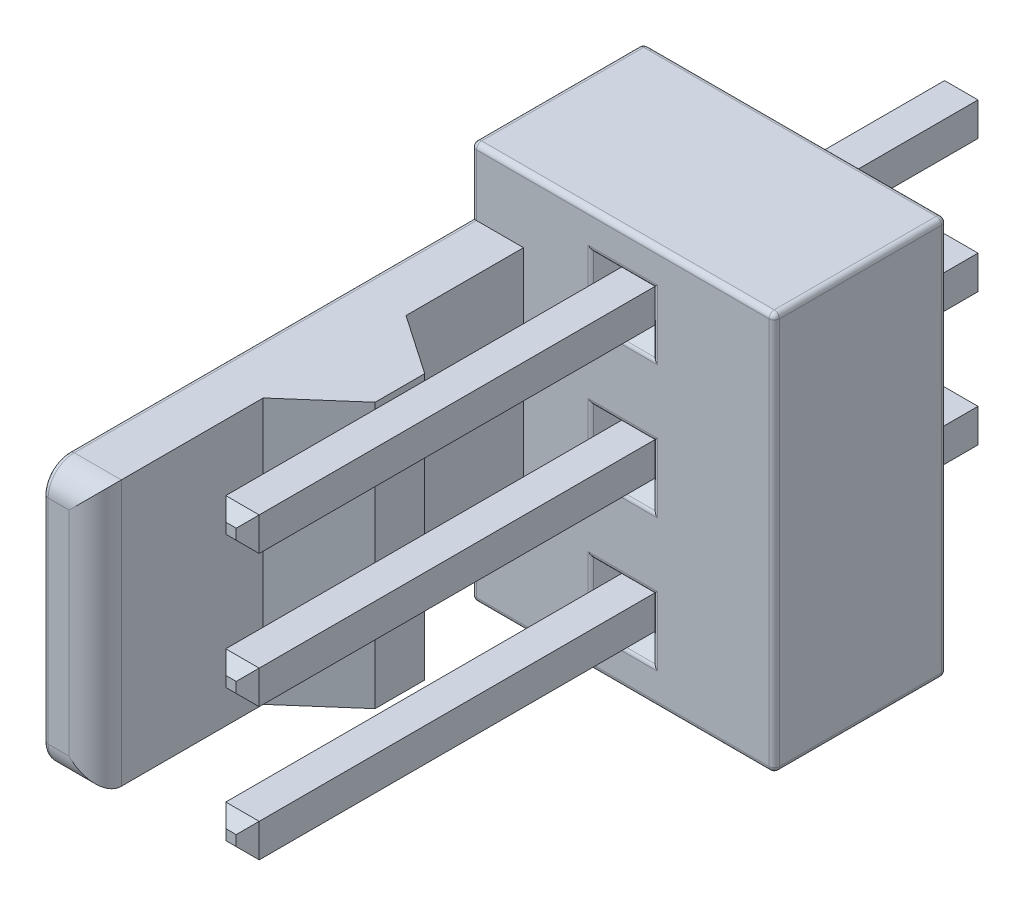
ISO-10303-21;
HEADER;
FILE_DESCRIPTION(('STEP AP214'),'2;1');
FILE_NAME('part.step','',(''),(''),'','','');
FILE_SCHEMA(('AUTOMOTIVE_DESIGN { 1 0 10303 214 1 1 1 1 }'));
ENDSEC;
DATA;
#1=APPLICATION_CONTEXT('core data for automotive mechanical design processes');
#2=APPLICATION_PROTOCOL_DEFINITION('international standard','automotive_design',2000,#1);
#3=PRODUCT_CONTEXT('',#1,'mechanical');
#4=PRODUCT('Part','Part','',(#3));
#5=PRODUCT_RELATED_PRODUCT_CATEGORY('part','',(#4));
#6=PRODUCT_DEFINITION_FORMATION('','',#4);
#7=PRODUCT_DEFINITION_CONTEXT('part definition',#1,'design');
#8=PRODUCT_DEFINITION('design','',#6,#7);
#9=PRODUCT_DEFINITION_SHAPE('','',#8);
#10=(LENGTH_UNIT() NAMED_UNIT(*) SI_UNIT(.MILLI.,.METRE.));
#11=(NAMED_UNIT(*) PLANE_ANGLE_UNIT() SI_UNIT($,.RADIAN.));
#12=(NAMED_UNIT(*) SI_UNIT($,.STERADIAN.) SOLID_ANGLE_UNIT());
#13=UNCERTAINTY_MEASURE_WITH_UNIT(LENGTH_MEASURE(1.E-05),#10,'distance_accuracy_value','');
#14=(GEOMETRIC_REPRESENTATION_CONTEXT(3) GLOBAL_UNCERTAINTY_ASSIGNED_CONTEXT((#13)) GLOBAL_UNIT_ASSIGNED_CONTEXT((#10,
#11,#12)) REPRESENTATION_CONTEXT('',''));
#15=CARTESIAN_POINT('',(0.,0.,0.));
#16=DIRECTION('',(0.,0.,1.));
#17=DIRECTION('',(1.,0.,0.));
#18=AXIS2_PLACEMENT_3D('',#15,#16,#17);
#19=CARTESIAN_POINT('',(0.,-2.75,10.69));
#20=DIRECTION('',(0.,-0.707106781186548,0.707106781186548));
#21=DIRECTION('',(0.,-0.707106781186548,-0.707106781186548));
#22=AXIS2_PLACEMENT_3D('',#19,#20,#21);
#23=PLANE('',#22);
#24=DIRECTION('',(0.577350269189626,0.577350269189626,0.577350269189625));
#25=VECTOR('',#24,1.);
#26=CARTESIAN_POINT('',(-0.319999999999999,-2.86,10.58));
#27=LINE('',#26,#25);
#28=CARTESIAN_POINT('',(-0.32,-2.86,10.58));
#29=VERTEX_POINT('',#28);
#30=CARTESIAN_POINT('',(-0.0999999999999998,-2.64,10.8));
#31=VERTEX_POINT('',#30);
#32=EDGE_CURVE('E633',#29,#31,#27,.T.);
#33=ORIENTED_EDGE('',*,*,#32,.F.);
#34=DIRECTION('',(1.,0.,0.));
#35=VECTOR('',#34,1.);
#36=CARTESIAN_POINT('',(-0.32,-2.86,10.58));
#37=LINE('',#36,#35);
#38=CARTESIAN_POINT('',(0.32,-2.86,10.58));
#39=VERTEX_POINT('',#38);
#40=EDGE_CURVE('E643',#39,#29,#37,.F.);
#41=ORIENTED_EDGE('',*,*,#40,.F.);
#42=DIRECTION('',(0.577350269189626,-0.577350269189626,-0.577350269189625));
#43=VECTOR('',#42,1.);
#44=CARTESIAN_POINT('',(0.0999999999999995,-2.64,10.8));
#45=LINE('',#44,#43);
#46=CARTESIAN_POINT('',(0.0999999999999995,-2.64,10.8));
#47=VERTEX_POINT('',#46);
#48=EDGE_CURVE('E622',#47,#39,#45,.T.);
#49=ORIENTED_EDGE('',*,*,#48,.F.);
#50=DIRECTION('',(1.,0.,0.));
#51=VECTOR('',#50,1.);
#52=CARTESIAN_POINT('',(-0.32,-2.64,10.8));
#53=LINE('',#52,#51);
#54=EDGE_CURVE('E632',#31,#47,#53,.T.);
#55=ORIENTED_EDGE('',*,*,#54,.F.);
#56=EDGE_LOOP('',(#33,#41,#49,#55));
#57=FACE_BOUND('',#56,.T.);
#58=ADVANCED_FACE('F16',(#57),#23,.T.);
#59=CARTESIAN_POINT('',(0.,0.21,10.69));
#60=DIRECTION('',(0.,0.707106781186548,0.707106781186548));
#61=DIRECTION('',(0.,-0.707106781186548,0.707106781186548));
#62=AXIS2_PLACEMENT_3D('',#59,#60,#61);
#63=PLANE('',#62);
#64=DIRECTION('',(-0.577350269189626,-0.577350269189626,0.577350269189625));
#65=VECTOR('',#64,1.);
#66=CARTESIAN_POINT('',(0.319999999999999,0.32,10.58));
#67=LINE('',#66,#65);
#68=CARTESIAN_POINT('',(0.32,0.32,10.58));
#69=VERTEX_POINT('',#68);
#70=CARTESIAN_POINT('',(0.0999999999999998,0.1,10.8));
#71=VERTEX_POINT('',#70);
#72=EDGE_CURVE('E590',#69,#71,#67,.T.);
#73=ORIENTED_EDGE('',*,*,#72,.F.);
#74=DIRECTION('',(1.,0.,0.));
#75=VECTOR('',#74,1.);
#76=CARTESIAN_POINT('',(-0.32,0.32,10.58));
#77=LINE('',#76,#75);
#78=CARTESIAN_POINT('',(-0.32,0.32,10.58));
#79=VERTEX_POINT('',#78);
#80=EDGE_CURVE('E595',#79,#69,#77,.T.);
#81=ORIENTED_EDGE('',*,*,#80,.F.);
#82=DIRECTION('',(-0.577350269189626,0.577350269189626,-0.577350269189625));
#83=VECTOR('',#82,1.);
#84=CARTESIAN_POINT('',(-0.0999999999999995,0.1,10.8));
#85=LINE('',#84,#83);
#86=CARTESIAN_POINT('',(-0.0999999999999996,0.1,10.8));
#87=VERTEX_POINT('',#86);
#88=EDGE_CURVE('E562',#87,#79,#85,.T.);
#89=ORIENTED_EDGE('',*,*,#88,.F.);
#90=DIRECTION('',(1.,0.,0.));
#91=VECTOR('',#90,1.);
#92=CARTESIAN_POINT('',(-0.32,0.1,10.8));
#93=LINE('',#92,#91);
#94=EDGE_CURVE('E580',#71,#87,#93,.F.);
#95=ORIENTED_EDGE('',*,*,#94,.F.);
#96=EDGE_LOOP('',(#73,#81,#89,#95));
#97=FACE_BOUND('',#96,.T.);
#98=ADVANCED_FACE('F1152',(#97),#63,.T.);
#99=CARTESIAN_POINT('',(-0.21,2.54,10.69));
#100=DIRECTION('',(-0.707106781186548,0.,0.707106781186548));
#101=DIRECTION('',(0.707106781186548,0.,0.707106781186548));
#102=AXIS2_PLACEMENT_3D('',#99,#100,#101);
#103=PLANE('',#102);
#104=DIRECTION('',(-0.577350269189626,-0.577350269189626,-0.577350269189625));
#105=VECTOR('',#104,1.);
#106=CARTESIAN_POINT('',(-0.1,2.44,10.8));
#107=LINE('',#106,#105);
#108=CARTESIAN_POINT('',(-0.1,2.44,10.8));
#109=VERTEX_POINT('',#108);
#110=CARTESIAN_POINT('',(-0.32,2.22,10.58));
#111=VERTEX_POINT('',#110);
#112=EDGE_CURVE('E551',#109,#111,#107,.T.);
#113=ORIENTED_EDGE('',*,*,#112,.F.);
#114=DIRECTION('',(0.,1.,0.));
#115=VECTOR('',#114,1.);
#116=CARTESIAN_POINT('',(-0.1,2.86,10.8));
#117=LINE('',#116,#115);
#118=CARTESIAN_POINT('',(-0.1,2.64,10.8));
#119=VERTEX_POINT('',#118);
#120=EDGE_CURVE('E540',#119,#109,#117,.F.);
#121=ORIENTED_EDGE('',*,*,#120,.F.);
#122=DIRECTION('',(0.577350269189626,-0.577350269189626,0.577350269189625));
#123=VECTOR('',#122,1.);
#124=CARTESIAN_POINT('',(-0.32,2.86,10.58));
#125=LINE('',#124,#123);
#126=CARTESIAN_POINT('',(-0.32,2.86,10.58));
#127=VERTEX_POINT('',#126);
#128=EDGE_CURVE('E541',#127,#119,#125,.T.);
#129=ORIENTED_EDGE('',*,*,#128,.F.);
#130=DIRECTION('',(0.,1.,0.));
#131=VECTOR('',#130,1.);
#132=CARTESIAN_POINT('',(-0.32,0.,10.58));
#133=LINE('',#132,#131);
#134=EDGE_CURVE('E558',#127,#111,#133,.F.);
#135=ORIENTED_EDGE('',*,*,#134,.T.);
#136=EDGE_LOOP('',(#113,#121,#129,#135));
#137=FACE_BOUND('',#136,.T.);
#138=ADVANCED_FACE('F1149',(#137),#103,.T.);
#139=CARTESIAN_POINT('',(-0.32,-2.86,10.8));
#140=DIRECTION('',(0.,-1.,0.));
#141=DIRECTION('',(0.,0.,-1.));
#142=AXIS2_PLACEMENT_3D('',#139,#140,#141);
#143=PLANE('',#142);
#144=DIRECTION('',(0.,0.,-1.));
#145=VECTOR('',#144,1.);
#146=CARTESIAN_POINT('',(0.32,-2.86,0.));
#147=LINE('',#146,#145);
#148=CARTESIAN_POINT('',(0.32,-2.86,3.));
#149=VERTEX_POINT('',#148);
#150=EDGE_CURVE('E522',#39,#149,#147,.T.);
#151=ORIENTED_EDGE('',*,*,#150,.F.);
#152=ORIENTED_EDGE('',*,*,#40,.T.);
#153=DIRECTION('',(0.,0.,-1.));
#154=VECTOR('',#153,1.);
#155=CARTESIAN_POINT('',(-0.32,-2.86,0.));
#156=LINE('',#155,#154);
#157=CARTESIAN_POINT('',(-0.32,-2.86,3.));
#158=VERTEX_POINT('',#157);
#159=EDGE_CURVE('E501',#29,#158,#156,.T.);
#160=ORIENTED_EDGE('',*,*,#159,.T.);
#161=DIRECTION('',(1.,0.,0.));
#162=VECTOR('',#161,1.);
#163=CARTESIAN_POINT('',(-0.32,-2.86,3.));
#164=LINE('',#163,#162);
#165=EDGE_CURVE('E640',#158,#149,#164,.T.);
#166=ORIENTED_EDGE('',*,*,#165,.T.);
#167=EDGE_LOOP('',(#151,#152,#160,#166));
#168=FACE_BOUND('',#167,.T.);
#169=ADVANCED_FACE('F1145',(#168),#143,.T.);
#170=CARTESIAN_POINT('',(-0.21,-2.54,10.69));
#171=DIRECTION('',(-0.707106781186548,0.,0.707106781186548));
#172=DIRECTION('',(0.707106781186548,0.,0.707106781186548));
#173=AXIS2_PLACEMENT_3D('',#170,#171,#172);
#174=PLANE('',#173);
#175=DIRECTION('',(0.577350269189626,-0.577350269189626,0.577350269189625));
#176=VECTOR('',#175,1.);
#177=CARTESIAN_POINT('',(-0.32,-2.22,10.58));
#178=LINE('',#177,#176);
#179=CARTESIAN_POINT('',(-0.32,-2.22,10.58));
#180=VERTEX_POINT('',#179);
#181=CARTESIAN_POINT('',(-0.1,-2.44,10.8));
#182=VERTEX_POINT('',#181);
#183=EDGE_CURVE('E500',#180,#182,#178,.T.);
#184=ORIENTED_EDGE('',*,*,#183,.F.);
#185=DIRECTION('',(0.,1.,0.));
#186=VECTOR('',#185,1.);
#187=CARTESIAN_POINT('',(-0.32,0.,10.58));
#188=LINE('',#187,#186);
#189=EDGE_CURVE('E504',#180,#29,#188,.F.);
#190=ORIENTED_EDGE('',*,*,#189,.T.);
#191=ORIENTED_EDGE('',*,*,#32,.T.);
#192=DIRECTION('',(0.,1.,0.));
#193=VECTOR('',#192,1.);
#194=CARTESIAN_POINT('',(-0.1,-2.22,10.8));
#195=LINE('',#194,#193);
#196=EDGE_CURVE('E629',#182,#31,#195,.F.);
#197=ORIENTED_EDGE('',*,*,#196,.F.);
#198=EDGE_LOOP('',(#184,#190,#191,#197));
#199=FACE_BOUND('',#198,.T.);
#200=ADVANCED_FACE('F1141',(#199),#174,.T.);
#201=CARTESIAN_POINT('',(-0.32,-2.22,10.8));
#202=DIRECTION('',(0.,0.,1.));
#203=DIRECTION('',(1.,0.,0.));
#204=AXIS2_PLACEMENT_3D('',#201,#202,#203);
#205=PLANE('',#204);
#206=ORIENTED_EDGE('',*,*,#54,.T.);
#207=DIRECTION('',(0.,1.,0.));
#208=VECTOR('',#207,1.);
#209=CARTESIAN_POINT('',(0.0999999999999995,-2.54,10.8));
#210=LINE('',#209,#208);
#211=CARTESIAN_POINT('',(0.0999999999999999,-2.44,10.8));
#212=VERTEX_POINT('',#211);
#213=EDGE_CURVE('E609',#212,#47,#210,.F.);
#214=ORIENTED_EDGE('',*,*,#213,.F.);
#215=DIRECTION('',(1.,0.,0.));
#216=VECTOR('',#215,1.);
#217=CARTESIAN_POINT('',(0.,-2.44,10.8));
#218=LINE('',#217,#216);
#219=EDGE_CURVE('E516',#182,#212,#218,.T.);
#220=ORIENTED_EDGE('',*,*,#219,.F.);
#221=ORIENTED_EDGE('',*,*,#196,.T.);
#222=EDGE_LOOP('',(#206,#214,#220,#221));
#223=FACE_BOUND('',#222,.T.);
#224=ADVANCED_FACE('F1137',(#223),#205,.T.);
#225=CARTESIAN_POINT('',(0.21,-2.54,10.69));
#226=DIRECTION('',(0.707106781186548,0.,0.707106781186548));
#227=DIRECTION('',(0.707106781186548,0.,-0.707106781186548));
#228=AXIS2_PLACEMENT_3D('',#225,#226,#227);
#229=PLANE('',#228);
#230=DIRECTION('',(0.577350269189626,0.577350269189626,-0.577350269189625));
#231=VECTOR('',#230,1.);
#232=CARTESIAN_POINT('',(0.1,-2.44,10.8));
#233=LINE('',#232,#231);
#234=CARTESIAN_POINT('',(0.32,-2.22,10.58));
#235=VERTEX_POINT('',#234);
#236=EDGE_CURVE('E489',#212,#235,#233,.T.);
#237=ORIENTED_EDGE('',*,*,#236,.F.);
#238=ORIENTED_EDGE('',*,*,#213,.T.);
#239=ORIENTED_EDGE('',*,*,#48,.T.);
#240=DIRECTION('',(0.,1.,0.));
#241=VECTOR('',#240,1.);
#242=CARTESIAN_POINT('',(0.32,0.,10.58));
#243=LINE('',#242,#241);
#244=EDGE_CURVE('E507',#235,#39,#243,.F.);
#245=ORIENTED_EDGE('',*,*,#244,.F.);
#246=EDGE_LOOP('',(#237,#238,#239,#245));
#247=FACE_BOUND('',#246,.T.);
#248=ADVANCED_FACE('F1133',(#247),#229,.T.);
#249=CARTESIAN_POINT('',(-0.32,0.32,-3.4));
#250=DIRECTION('',(0.,1.,0.));
#251=DIRECTION('',(0.,0.,1.));
#252=AXIS2_PLACEMENT_3D('',#249,#250,#251);
#253=PLANE('',#252);
#254=DIRECTION('',(0.,0.,-1.));
#255=VECTOR('',#254,1.);
#256=CARTESIAN_POINT('',(-0.32,0.32,0.));
#257=LINE('',#256,#255);
#258=CARTESIAN_POINT('',(-0.32,0.32,3.));
#259=VERTEX_POINT('',#258);
#260=EDGE_CURVE('E463',#259,#79,#257,.F.);
#261=ORIENTED_EDGE('',*,*,#260,.T.);
#262=ORIENTED_EDGE('',*,*,#80,.T.);
#263=DIRECTION('',(0.,0.,-1.));
#264=VECTOR('',#263,1.);
#265=CARTESIAN_POINT('',(0.32,0.32,0.));
#266=LINE('',#265,#264);
#267=CARTESIAN_POINT('',(0.32,0.32,3.));
#268=VERTEX_POINT('',#267);
#269=EDGE_CURVE('E462',#268,#69,#266,.F.);
#270=ORIENTED_EDGE('',*,*,#269,.F.);
#271=DIRECTION('',(1.,0.,0.));
#272=VECTOR('',#271,1.);
#273=CARTESIAN_POINT('',(-0.32,0.32,3.));
#274=LINE('',#273,#272);
#275=EDGE_CURVE('E604',#268,#259,#274,.F.);
#276=ORIENTED_EDGE('',*,*,#275,.T.);
#277=EDGE_LOOP('',(#261,#262,#270,#276));
#278=FACE_BOUND('',#277,.T.);
#279=ADVANCED_FACE('F1129',(#278),#253,.T.);
#280=CARTESIAN_POINT('',(0.21,0.,10.69));
#281=DIRECTION('',(0.707106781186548,0.,0.707106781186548));
#282=DIRECTION('',(0.707106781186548,0.,-0.707106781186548));
#283=AXIS2_PLACEMENT_3D('',#280,#281,#282);
#284=PLANE('',#283);
#285=ORIENTED_EDGE('',*,*,#72,.T.);
#286=DIRECTION('',(0.,1.,0.));
#287=VECTOR('',#286,1.);
#288=CARTESIAN_POINT('',(0.1,0.32,10.8));
#289=LINE('',#288,#287);
#290=CARTESIAN_POINT('',(0.1,-0.0999999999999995,10.8));
#291=VERTEX_POINT('',#290);
#292=EDGE_CURVE('E587',#291,#71,#289,.T.);
#293=ORIENTED_EDGE('',*,*,#292,.F.);
#294=DIRECTION('',(-0.577350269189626,0.577350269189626,0.577350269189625));
#295=VECTOR('',#294,1.);
#296=CARTESIAN_POINT('',(0.32,-0.319999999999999,10.58));
#297=LINE('',#296,#295);
#298=CARTESIAN_POINT('',(0.32,-0.32,10.58));
#299=VERTEX_POINT('',#298);
#300=EDGE_CURVE('E469',#299,#291,#297,.T.);
#301=ORIENTED_EDGE('',*,*,#300,.F.);
#302=DIRECTION('',(0.,1.,0.));
#303=VECTOR('',#302,1.);
#304=CARTESIAN_POINT('',(0.32,0.,10.58));
#305=LINE('',#304,#303);
#306=EDGE_CURVE('E466',#69,#299,#305,.F.);
#307=ORIENTED_EDGE('',*,*,#306,.F.);
#308=EDGE_LOOP('',(#285,#293,#301,#307));
#309=FACE_BOUND('',#308,.T.);
#310=ADVANCED_FACE('F1125',(#309),#284,.T.);
#311=CARTESIAN_POINT('',(-0.32,0.32,10.8));
#312=DIRECTION('',(0.,0.,1.));
#313=DIRECTION('',(1.,0.,0.));
#314=AXIS2_PLACEMENT_3D('',#311,#312,#313);
#315=PLANE('',#314);
#316=ORIENTED_EDGE('',*,*,#94,.T.);
#317=DIRECTION('',(0.,1.,0.));
#318=VECTOR('',#317,1.);
#319=CARTESIAN_POINT('',(-0.0999999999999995,0.,10.8));
#320=LINE('',#319,#318);
#321=CARTESIAN_POINT('',(-0.0999999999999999,-0.0999999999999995,10.8));
#322=VERTEX_POINT('',#321);
#323=EDGE_CURVE('E577',#322,#87,#320,.T.);
#324=ORIENTED_EDGE('',*,*,#323,.F.);
#325=DIRECTION('',(1.,0.,0.));
#326=VECTOR('',#325,1.);
#327=CARTESIAN_POINT('',(0.,-0.0999999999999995,10.8));
#328=LINE('',#327,#326);
#329=EDGE_CURVE('E478',#291,#322,#328,.F.);
#330=ORIENTED_EDGE('',*,*,#329,.F.);
#331=ORIENTED_EDGE('',*,*,#292,.T.);
#332=EDGE_LOOP('',(#316,#324,#330,#331));
#333=FACE_BOUND('',#332,.T.);
#334=ADVANCED_FACE('F1121',(#333),#315,.T.);
#335=CARTESIAN_POINT('',(-0.21,0.,10.69));
#336=DIRECTION('',(-0.707106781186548,0.,0.707106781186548));
#337=DIRECTION('',(0.707106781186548,0.,0.707106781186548));
#338=AXIS2_PLACEMENT_3D('',#335,#336,#337);
#339=PLANE('',#338);
#340=ORIENTED_EDGE('',*,*,#88,.T.);
#341=DIRECTION('',(0.,1.,0.));
#342=VECTOR('',#341,1.);
#343=CARTESIAN_POINT('',(-0.32,0.,10.58));
#344=LINE('',#343,#342);
#345=CARTESIAN_POINT('',(-0.32,-0.32,10.58));
#346=VERTEX_POINT('',#345);
#347=EDGE_CURVE('E484',#79,#346,#344,.F.);
#348=ORIENTED_EDGE('',*,*,#347,.T.);
#349=DIRECTION('',(-0.577350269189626,-0.577350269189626,-0.577350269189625));
#350=VECTOR('',#349,1.);
#351=CARTESIAN_POINT('',(-0.1,-0.0999999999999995,10.8));
#352=LINE('',#351,#350);
#353=EDGE_CURVE('E492',#322,#346,#352,.T.);
#354=ORIENTED_EDGE('',*,*,#353,.F.);
#355=ORIENTED_EDGE('',*,*,#323,.T.);
#356=EDGE_LOOP('',(#340,#348,#354,#355));
#357=FACE_BOUND('',#356,.T.);
#358=ADVANCED_FACE('F1117',(#357),#339,.T.);
#359=CARTESIAN_POINT('',(-0.32,0.,0.));
#360=DIRECTION('',(1.,0.,0.));
#361=DIRECTION('',(0.,0.,-1.));
#362=AXIS2_PLACEMENT_3D('',#359,#360,#361);
#363=PLANE('',#362);
#364=DIRECTION('',(0.,1.,0.));
#365=VECTOR('',#364,1.);
#366=CARTESIAN_POINT('',(-0.32,0.,3.));
#367=LINE('',#366,#365);
#368=CARTESIAN_POINT('',(-0.32,2.22,3.));
#369=VERTEX_POINT('',#368);
#370=CARTESIAN_POINT('',(-0.32,2.86,3.));
#371=VERTEX_POINT('',#370);
#372=EDGE_CURVE('E561',#369,#371,#367,.T.);
#373=ORIENTED_EDGE('',*,*,#372,.F.);
#374=DIRECTION('',(0.,0.,-1.));
#375=VECTOR('',#374,1.);
#376=CARTESIAN_POINT('',(-0.32,2.22,10.8));
#377=LINE('',#376,#375);
#378=EDGE_CURVE('E448',#111,#369,#377,.T.);
#379=ORIENTED_EDGE('',*,*,#378,.F.);
#380=ORIENTED_EDGE('',*,*,#134,.F.);
#381=DIRECTION('',(0.,0.,1.));
#382=VECTOR('',#381,1.);
#383=CARTESIAN_POINT('',(-0.32,2.86,-3.4));
#384=LINE('',#383,#382);
#385=EDGE_CURVE('E426',#371,#127,#384,.T.);
#386=ORIENTED_EDGE('',*,*,#385,.F.);
#387=EDGE_LOOP('',(#373,#379,#380,#386));
#388=FACE_BOUND('',#387,.T.);
#389=ADVANCED_FACE('F1113',(#388),#363,.F.);
#390=CARTESIAN_POINT('',(0.,2.33,10.69));
#391=DIRECTION('',(0.,-0.707106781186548,0.707106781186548));
#392=DIRECTION('',(0.,-0.707106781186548,-0.707106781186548));
#393=AXIS2_PLACEMENT_3D('',#390,#391,#392);
#394=PLANE('',#393);
#395=ORIENTED_EDGE('',*,*,#112,.T.);
#396=DIRECTION('',(1.,0.,0.));
#397=VECTOR('',#396,1.);
#398=CARTESIAN_POINT('',(-0.32,2.22,10.58));
#399=LINE('',#398,#397);
#400=CARTESIAN_POINT('',(0.32,2.22,10.58));
#401=VERTEX_POINT('',#400);
#402=EDGE_CURVE('E427',#401,#111,#399,.F.);
#403=ORIENTED_EDGE('',*,*,#402,.F.);
#404=DIRECTION('',(0.577350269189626,-0.577350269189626,-0.577350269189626));
#405=VECTOR('',#404,1.);
#406=CARTESIAN_POINT('',(0.0999999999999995,2.44,10.8));
#407=LINE('',#406,#405);
#408=CARTESIAN_POINT('',(0.0999999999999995,2.44,10.8));
#409=VERTEX_POINT('',#408);
#410=EDGE_CURVE('E433',#409,#401,#407,.T.);
#411=ORIENTED_EDGE('',*,*,#410,.F.);
#412=DIRECTION('',(1.,0.,0.));
#413=VECTOR('',#412,1.);
#414=CARTESIAN_POINT('',(-0.32,2.44,10.8));
#415=LINE('',#414,#413);
#416=EDGE_CURVE('E544',#109,#409,#415,.T.);
#417=ORIENTED_EDGE('',*,*,#416,.F.);
#418=EDGE_LOOP('',(#395,#403,#411,#417));
#419=FACE_BOUND('',#418,.T.);
#420=ADVANCED_FACE('F1109',(#419),#394,.T.);
#421=CARTESIAN_POINT('',(0.,2.75,10.69));
#422=DIRECTION('',(0.,0.707106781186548,0.707106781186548));
#423=DIRECTION('',(0.,-0.707106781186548,0.707106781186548));
#424=AXIS2_PLACEMENT_3D('',#421,#422,#423);
#425=PLANE('',#424);
#426=ORIENTED_EDGE('',*,*,#128,.T.);
#427=DIRECTION('',(1.,0.,0.));
#428=VECTOR('',#427,1.);
#429=CARTESIAN_POINT('',(-0.32,2.64,10.8));
#430=LINE('',#429,#428);
#431=CARTESIAN_POINT('',(0.0999999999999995,2.64,10.8));
#432=VERTEX_POINT('',#431);
#433=EDGE_CURVE('E537',#432,#119,#430,.F.);
#434=ORIENTED_EDGE('',*,*,#433,.F.);
#435=DIRECTION('',(-0.577350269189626,-0.577350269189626,0.577350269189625));
#436=VECTOR('',#435,1.);
#437=CARTESIAN_POINT('',(0.319999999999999,2.86,10.58));
#438=LINE('',#437,#436);
#439=CARTESIAN_POINT('',(0.32,2.86,10.58));
#440=VERTEX_POINT('',#439);
#441=EDGE_CURVE('E440',#440,#432,#438,.T.);
#442=ORIENTED_EDGE('',*,*,#441,.F.);
#443=DIRECTION('',(1.,0.,0.));
#444=VECTOR('',#443,1.);
#445=CARTESIAN_POINT('',(-0.32,2.86,10.58));
#446=LINE('',#445,#444);
#447=EDGE_CURVE('E430',#127,#440,#446,.T.);
#448=ORIENTED_EDGE('',*,*,#447,.F.);
#449=EDGE_LOOP('',(#426,#434,#442,#448));
#450=FACE_BOUND('',#449,.T.);
#451=ADVANCED_FACE('F1105',(#450),#425,.T.);
#452=CARTESIAN_POINT('',(-0.32,2.86,10.8));
#453=DIRECTION('',(0.,0.,1.));
#454=DIRECTION('',(1.,0.,0.));
#455=AXIS2_PLACEMENT_3D('',#452,#453,#454);
#456=PLANE('',#455);
#457=ORIENTED_EDGE('',*,*,#416,.T.);
#458=DIRECTION('',(0.,1.,0.));
#459=VECTOR('',#458,1.);
#460=CARTESIAN_POINT('',(0.0999999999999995,2.54,10.8));
#461=LINE('',#460,#459);
#462=EDGE_CURVE('E416',#432,#409,#461,.F.);
#463=ORIENTED_EDGE('',*,*,#462,.F.);
#464=ORIENTED_EDGE('',*,*,#433,.T.);
#465=ORIENTED_EDGE('',*,*,#120,.T.);
#466=EDGE_LOOP('',(#457,#463,#464,#465));
#467=FACE_BOUND('',#466,.T.);
#468=ADVANCED_FACE('F1101',(#467),#456,.T.);
#469=CARTESIAN_POINT('',(0.32,0.,0.));
#470=DIRECTION('',(1.,0.,0.));
#471=DIRECTION('',(0.,0.,-1.));
#472=AXIS2_PLACEMENT_3D('',#469,#470,#471);
#473=PLANE('',#472);
#474=DIRECTION('',(0.,0.,1.));
#475=VECTOR('',#474,1.);
#476=CARTESIAN_POINT('',(0.32,-2.22,-3.4));
#477=LINE('',#476,#475);
#478=CARTESIAN_POINT('',(0.32,-2.22,3.));
#479=VERTEX_POINT('',#478);
#480=EDGE_CURVE('E412',#235,#479,#477,.F.);
#481=ORIENTED_EDGE('',*,*,#480,.F.);
#482=ORIENTED_EDGE('',*,*,#244,.T.);
#483=ORIENTED_EDGE('',*,*,#150,.T.);
#484=DIRECTION('',(0.,1.,0.));
#485=VECTOR('',#484,1.);
#486=CARTESIAN_POINT('',(0.32,0.,3.));
#487=LINE('',#486,#485);
#488=EDGE_CURVE('E519',#149,#479,#487,.T.);
#489=ORIENTED_EDGE('',*,*,#488,.T.);
#490=EDGE_LOOP('',(#481,#482,#483,#489));
#491=FACE_BOUND('',#490,.T.);
#492=ADVANCED_FACE('F1097',(#491),#473,.T.);
#493=CARTESIAN_POINT('',(-0.32,0.,0.));
#494=DIRECTION('',(1.,0.,0.));
#495=DIRECTION('',(0.,0.,-1.));
#496=AXIS2_PLACEMENT_3D('',#493,#494,#495);
#497=PLANE('',#496);
#498=DIRECTION('',(0.,1.,0.));
#499=VECTOR('',#498,1.);
#500=CARTESIAN_POINT('',(-0.32,0.,3.));
#501=LINE('',#500,#499);
#502=CARTESIAN_POINT('',(-0.32,-2.22,3.));
#503=VERTEX_POINT('',#502);
#504=EDGE_CURVE('E497',#158,#503,#501,.T.);
#505=ORIENTED_EDGE('',*,*,#504,.F.);
#506=ORIENTED_EDGE('',*,*,#159,.F.);
#507=ORIENTED_EDGE('',*,*,#189,.F.);
#508=DIRECTION('',(0.,0.,1.));
#509=VECTOR('',#508,1.);
#510=CARTESIAN_POINT('',(-0.32,-2.22,-3.4));
#511=LINE('',#510,#509);
#512=EDGE_CURVE('E415',#503,#180,#511,.T.);
#513=ORIENTED_EDGE('',*,*,#512,.F.);
#514=EDGE_LOOP('',(#505,#506,#507,#513));
#515=FACE_BOUND('',#514,.T.);
#516=ADVANCED_FACE('F1093',(#515),#497,.F.);
#517=CARTESIAN_POINT('',(0.,-2.33,10.69));
#518=DIRECTION('',(0.,0.707106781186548,0.707106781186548));
#519=DIRECTION('',(0.,-0.707106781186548,0.707106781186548));
#520=AXIS2_PLACEMENT_3D('',#517,#518,#519);
#521=PLANE('',#520);
#522=ORIENTED_EDGE('',*,*,#236,.T.);
#523=DIRECTION('',(1.,0.,0.));
#524=VECTOR('',#523,1.);
#525=CARTESIAN_POINT('',(-0.32,-2.22,10.58));
#526=LINE('',#525,#524);
#527=EDGE_CURVE('E401',#180,#235,#526,.T.);
#528=ORIENTED_EDGE('',*,*,#527,.F.);
#529=ORIENTED_EDGE('',*,*,#183,.T.);
#530=ORIENTED_EDGE('',*,*,#219,.T.);
#531=EDGE_LOOP('',(#522,#528,#529,#530));
#532=FACE_BOUND('',#531,.T.);
#533=ADVANCED_FACE('F1089',(#532),#521,.T.);
#534=CARTESIAN_POINT('',(-0.32,0.,0.));
#535=DIRECTION('',(1.,0.,0.));
#536=DIRECTION('',(0.,0.,-1.));
#537=AXIS2_PLACEMENT_3D('',#534,#535,#536);
#538=PLANE('',#537);
#539=DIRECTION('',(0.,1.,0.));
#540=VECTOR('',#539,1.);
#541=CARTESIAN_POINT('',(-0.32,0.,3.));
#542=LINE('',#541,#540);
#543=CARTESIAN_POINT('',(-0.32,-0.32,3.));
#544=VERTEX_POINT('',#543);
#545=EDGE_CURVE('E481',#544,#259,#542,.T.);
#546=ORIENTED_EDGE('',*,*,#545,.F.);
#547=DIRECTION('',(0.,0.,-1.));
#548=VECTOR('',#547,1.);
#549=CARTESIAN_POINT('',(-0.32,-0.32,10.8));
#550=LINE('',#549,#548);
#551=EDGE_CURVE('E397',#346,#544,#550,.T.);
#552=ORIENTED_EDGE('',*,*,#551,.F.);
#553=ORIENTED_EDGE('',*,*,#347,.F.);
#554=ORIENTED_EDGE('',*,*,#260,.F.);
#555=EDGE_LOOP('',(#546,#552,#553,#554));
#556=FACE_BOUND('',#555,.T.);
#557=ADVANCED_FACE('F1085',(#556),#538,.F.);
#558=CARTESIAN_POINT('',(0.32,0.,0.));
#559=DIRECTION('',(1.,0.,0.));
#560=DIRECTION('',(0.,0.,-1.));
#561=AXIS2_PLACEMENT_3D('',#558,#559,#560);
#562=PLANE('',#561);
#563=ORIENTED_EDGE('',*,*,#269,.T.);
#564=ORIENTED_EDGE('',*,*,#306,.T.);
#565=DIRECTION('',(0.,0.,-1.));
#566=VECTOR('',#565,1.);
#567=CARTESIAN_POINT('',(0.32,-0.32,10.8));
#568=LINE('',#567,#566);
#569=CARTESIAN_POINT('',(0.32,-0.32,3.));
#570=VERTEX_POINT('',#569);
#571=EDGE_CURVE('E400',#570,#299,#568,.F.);
#572=ORIENTED_EDGE('',*,*,#571,.F.);
#573=DIRECTION('',(0.,1.,0.));
#574=VECTOR('',#573,1.);
#575=CARTESIAN_POINT('',(0.32,0.,3.));
#576=LINE('',#575,#574);
#577=EDGE_CURVE('E459',#570,#268,#576,.T.);
#578=ORIENTED_EDGE('',*,*,#577,.T.);
#579=EDGE_LOOP('',(#563,#564,#572,#578));
#580=FACE_BOUND('',#579,.T.);
#581=ADVANCED_FACE('F1081',(#580),#562,.T.);
#582=CARTESIAN_POINT('',(0.,-0.21,10.69));
#583=DIRECTION('',(0.,-0.707106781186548,0.707106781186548));
#584=DIRECTION('',(0.,-0.707106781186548,-0.707106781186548));
#585=AXIS2_PLACEMENT_3D('',#582,#583,#584);
#586=PLANE('',#585);
#587=ORIENTED_EDGE('',*,*,#353,.T.);
#588=DIRECTION('',(1.,0.,0.));
#589=VECTOR('',#588,1.);
#590=CARTESIAN_POINT('',(-0.32,-0.32,10.58));
#591=LINE('',#590,#589);
#592=EDGE_CURVE('E386',#299,#346,#591,.F.);
#593=ORIENTED_EDGE('',*,*,#592,.F.);
#594=ORIENTED_EDGE('',*,*,#300,.T.);
#595=ORIENTED_EDGE('',*,*,#329,.T.);
#596=EDGE_LOOP('',(#587,#593,#594,#595));
#597=FACE_BOUND('',#596,.T.);
#598=ADVANCED_FACE('F1077',(#597),#586,.T.);
#599=CARTESIAN_POINT('',(-0.32,2.22,10.8));
#600=DIRECTION('',(0.,-1.,0.));
#601=DIRECTION('',(0.,0.,-1.));
#602=AXIS2_PLACEMENT_3D('',#599,#600,#601);
#603=PLANE('',#602);
#604=DIRECTION('',(0.,0.,-1.));
#605=VECTOR('',#604,1.);
#606=CARTESIAN_POINT('',(0.32,2.22,0.));
#607=LINE('',#606,#605);
#608=CARTESIAN_POINT('',(0.32,2.22,3.));
#609=VERTEX_POINT('',#608);
#610=EDGE_CURVE('E382',#401,#609,#607,.T.);
#611=ORIENTED_EDGE('',*,*,#610,.F.);
#612=ORIENTED_EDGE('',*,*,#402,.T.);
#613=ORIENTED_EDGE('',*,*,#378,.T.);
#614=DIRECTION('',(1.,0.,0.));
#615=VECTOR('',#614,1.);
#616=CARTESIAN_POINT('',(-0.32,2.22,3.));
#617=LINE('',#616,#615);
#618=EDGE_CURVE('E445',#369,#609,#617,.T.);
#619=ORIENTED_EDGE('',*,*,#618,.T.);
#620=EDGE_LOOP('',(#611,#612,#613,#619));
#621=FACE_BOUND('',#620,.T.);
#622=ADVANCED_FACE('F1073',(#621),#603,.T.);
#623=CARTESIAN_POINT('',(-0.32,2.86,-3.4));
#624=DIRECTION('',(0.,1.,0.));
#625=DIRECTION('',(0.,0.,1.));
#626=AXIS2_PLACEMENT_3D('',#623,#624,#625);
#627=PLANE('',#626);
#628=ORIENTED_EDGE('',*,*,#385,.T.);
#629=ORIENTED_EDGE('',*,*,#447,.T.);
#630=DIRECTION('',(0.,0.,-1.));
#631=VECTOR('',#630,1.);
#632=CARTESIAN_POINT('',(0.32,2.86,0.));
#633=LINE('',#632,#631);
#634=CARTESIAN_POINT('',(0.32,2.86,3.));
#635=VERTEX_POINT('',#634);
#636=EDGE_CURVE('E385',#635,#440,#633,.F.);
#637=ORIENTED_EDGE('',*,*,#636,.F.);
#638=DIRECTION('',(1.,0.,0.));
#639=VECTOR('',#638,1.);
#640=CARTESIAN_POINT('',(-0.32,2.86,3.));
#641=LINE('',#640,#639);
#642=EDGE_CURVE('E423',#635,#371,#641,.F.);
#643=ORIENTED_EDGE('',*,*,#642,.T.);
#644=EDGE_LOOP('',(#628,#629,#637,#643));
#645=FACE_BOUND('',#644,.T.);
#646=ADVANCED_FACE('F1069',(#645),#627,.T.);
#647=CARTESIAN_POINT('',(0.21,2.54,10.69));
#648=DIRECTION('',(0.707106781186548,0.,0.707106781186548));
#649=DIRECTION('',(0.707106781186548,0.,-0.707106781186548));
#650=AXIS2_PLACEMENT_3D('',#647,#648,#649);
#651=PLANE('',#650);
#652=ORIENTED_EDGE('',*,*,#441,.T.);
#653=ORIENTED_EDGE('',*,*,#462,.T.);
#654=ORIENTED_EDGE('',*,*,#410,.T.);
#655=DIRECTION('',(0.,1.,0.));
#656=VECTOR('',#655,1.);
#657=CARTESIAN_POINT('',(0.32,0.,10.58));
#658=LINE('',#657,#656);
#659=EDGE_CURVE('E359',#440,#401,#658,.F.);
#660=ORIENTED_EDGE('',*,*,#659,.F.);
#661=EDGE_LOOP('',(#652,#653,#654,#660));
#662=FACE_BOUND('',#661,.T.);
#663=ADVANCED_FACE('F1065',(#662),#651,.T.);
#664=CARTESIAN_POINT('',(-0.32,-2.22,-3.4));
#665=DIRECTION('',(0.,1.,0.));
#666=DIRECTION('',(0.,0.,1.));
#667=AXIS2_PLACEMENT_3D('',#664,#665,#666);
#668=PLANE('',#667);
#669=ORIENTED_EDGE('',*,*,#512,.T.);
#670=ORIENTED_EDGE('',*,*,#527,.T.);
#671=ORIENTED_EDGE('',*,*,#480,.T.);
#672=DIRECTION('',(1.,0.,0.));
#673=VECTOR('',#672,1.);
#674=CARTESIAN_POINT('',(0.,-2.22,3.));
#675=LINE('',#674,#673);
#676=EDGE_CURVE('E344',#503,#479,#675,.T.);
#677=ORIENTED_EDGE('',*,*,#676,.F.);
#678=EDGE_LOOP('',(#669,#670,#671,#677));
#679=FACE_BOUND('',#678,.T.);
#680=ADVANCED_FACE('F1061',(#679),#668,.T.);
#681=CARTESIAN_POINT('',(-0.32,-0.32,10.8));
#682=DIRECTION('',(0.,-1.,0.));
#683=DIRECTION('',(0.,0.,-1.));
#684=AXIS2_PLACEMENT_3D('',#681,#682,#683);
#685=PLANE('',#684);
#686=ORIENTED_EDGE('',*,*,#571,.T.);
#687=ORIENTED_EDGE('',*,*,#592,.T.);
#688=ORIENTED_EDGE('',*,*,#551,.T.);
#689=DIRECTION('',(1.,0.,0.));
#690=VECTOR('',#689,1.);
#691=CARTESIAN_POINT('',(0.,-0.32,3.));
#692=LINE('',#691,#690);
#693=EDGE_CURVE('E323',#570,#544,#692,.F.);
#694=ORIENTED_EDGE('',*,*,#693,.F.);
#695=EDGE_LOOP('',(#686,#687,#688,#694));
#696=FACE_BOUND('',#695,.T.);
#697=ADVANCED_FACE('F1057',(#696),#685,.T.);
#698=CARTESIAN_POINT('',(0.32,0.,0.));
#699=DIRECTION('',(1.,0.,0.));
#700=DIRECTION('',(0.,0.,-1.));
#701=AXIS2_PLACEMENT_3D('',#698,#699,#700);
#702=PLANE('',#701);
#703=ORIENTED_EDGE('',*,*,#636,.T.);
#704=ORIENTED_EDGE('',*,*,#659,.T.);
#705=ORIENTED_EDGE('',*,*,#610,.T.);
#706=DIRECTION('',(0.,1.,0.));
#707=VECTOR('',#706,1.);
#708=CARTESIAN_POINT('',(0.32,2.54,3.));
#709=LINE('',#708,#707);
#710=EDGE_CURVE('E302',#635,#609,#709,.F.);
#711=ORIENTED_EDGE('',*,*,#710,.F.);
#712=EDGE_LOOP('',(#703,#704,#705,#711));
#713=FACE_BOUND('',#712,.T.);
#714=ADVANCED_FACE('F1053',(#713),#702,.T.);
#715=CARTESIAN_POINT('',(0.,0.21,-3.29));
#716=DIRECTION('',(0.,0.707106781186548,-0.707106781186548));
#717=DIRECTION('',(0.,0.707106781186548,0.707106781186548));
#718=AXIS2_PLACEMENT_3D('',#715,#716,#717);
#719=PLANE('',#718);
#720=DIRECTION('',(0.577350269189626,-0.577350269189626,-0.577350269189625));
#721=VECTOR('',#720,1.);
#722=CARTESIAN_POINT('',(-0.32,0.32,-3.18));
#723=LINE('',#722,#721);
#724=CARTESIAN_POINT('',(-0.32,0.32,-3.18));
#725=VERTEX_POINT('',#724);
#726=CARTESIAN_POINT('',(-0.1,0.1,-3.4));
#727=VERTEX_POINT('',#726);
#728=EDGE_CURVE('E272',#725,#727,#723,.T.);
#729=ORIENTED_EDGE('',*,*,#728,.F.);
#730=DIRECTION('',(1.,0.,0.));
#731=VECTOR('',#730,1.);
#732=CARTESIAN_POINT('',(-0.32,0.32,-3.18));
#733=LINE('',#732,#731);
#734=CARTESIAN_POINT('',(0.32,0.32,-3.18));
#735=VERTEX_POINT('',#734);
#736=EDGE_CURVE('E275',#735,#725,#733,.F.);
#737=ORIENTED_EDGE('',*,*,#736,.F.);
#738=DIRECTION('',(0.577350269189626,0.577350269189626,0.577350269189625));
#739=VECTOR('',#738,1.);
#740=CARTESIAN_POINT('',(0.1,0.1,-3.4));
#741=LINE('',#740,#739);
#742=CARTESIAN_POINT('',(0.1,0.1,-3.4));
#743=VERTEX_POINT('',#742);
#744=EDGE_CURVE('E263',#743,#735,#741,.T.);
#745=ORIENTED_EDGE('',*,*,#744,.F.);
#746=DIRECTION('',(-1.,0.,0.));
#747=VECTOR('',#746,1.);
#748=CARTESIAN_POINT('',(-0.32,0.1,-3.4));
#749=LINE('',#748,#747);
#750=EDGE_CURVE('E266',#727,#743,#749,.F.);
#751=ORIENTED_EDGE('',*,*,#750,.F.);
#752=EDGE_LOOP('',(#729,#737,#745,#751));
#753=FACE_BOUND('',#752,.T.);
#754=ADVANCED_FACE('F1049',(#753),#719,.T.);
#755=CARTESIAN_POINT('',(0.,2.75,-3.29));
#756=DIRECTION('',(0.,0.707106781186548,-0.707106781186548));
#757=DIRECTION('',(0.,0.707106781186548,0.707106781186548));
#758=AXIS2_PLACEMENT_3D('',#755,#756,#757);
#759=PLANE('',#758);
#760=DIRECTION('',(0.577350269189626,-0.577350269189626,-0.577350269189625));
#761=VECTOR('',#760,1.);
#762=CARTESIAN_POINT('',(-0.32,2.86,-3.18));
#763=LINE('',#762,#761);
#764=CARTESIAN_POINT('',(-0.32,2.86,-3.18));
#765=VERTEX_POINT('',#764);
#766=CARTESIAN_POINT('',(-0.1,2.64,-3.4));
#767=VERTEX_POINT('',#766);
#768=EDGE_CURVE('E251',#765,#767,#763,.T.);
#769=ORIENTED_EDGE('',*,*,#768,.F.);
#770=DIRECTION('',(1.,0.,0.));
#771=VECTOR('',#770,1.);
#772=CARTESIAN_POINT('',(-0.32,2.86,-3.18));
#773=LINE('',#772,#771);
#774=CARTESIAN_POINT('',(0.32,2.86,-3.18));
#775=VERTEX_POINT('',#774);
#776=EDGE_CURVE('E254',#775,#765,#773,.F.);
#777=ORIENTED_EDGE('',*,*,#776,.F.);
#778=DIRECTION('',(0.577350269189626,0.577350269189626,0.577350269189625));
#779=VECTOR('',#778,1.);
#780=CARTESIAN_POINT('',(0.1,2.64,-3.4));
#781=LINE('',#780,#779);
#782=CARTESIAN_POINT('',(0.1,2.64,-3.4));
#783=VERTEX_POINT('',#782);
#784=EDGE_CURVE('E242',#783,#775,#781,.T.);
#785=ORIENTED_EDGE('',*,*,#784,.F.);
#786=DIRECTION('',(-1.,0.,0.));
#787=VECTOR('',#786,1.);
#788=CARTESIAN_POINT('',(-0.32,2.64,-3.4));
#789=LINE('',#788,#787);
#790=EDGE_CURVE('E245',#767,#783,#789,.F.);
#791=ORIENTED_EDGE('',*,*,#790,.F.);
#792=EDGE_LOOP('',(#769,#777,#785,#791));
#793=FACE_BOUND('',#792,.T.);
#794=ADVANCED_FACE('F1045',(#793),#759,.T.);
#795=CARTESIAN_POINT('',(0.,-2.33,-3.29));
#796=DIRECTION('',(0.,0.707106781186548,-0.707106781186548));
#797=DIRECTION('',(0.,0.707106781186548,0.707106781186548));
#798=AXIS2_PLACEMENT_3D('',#795,#796,#797);
#799=PLANE('',#798);
#800=DIRECTION('',(0.577350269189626,-0.577350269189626,-0.577350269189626));
#801=VECTOR('',#800,1.);
#802=CARTESIAN_POINT('',(-0.32,-2.22,-3.18));
#803=LINE('',#802,#801);
#804=CARTESIAN_POINT('',(-0.32,-2.22,-3.18));
#805=VERTEX_POINT('',#804);
#806=CARTESIAN_POINT('',(-0.1,-2.44,-3.4));
#807=VERTEX_POINT('',#806);
#808=EDGE_CURVE('E230',#805,#807,#803,.T.);
#809=ORIENTED_EDGE('',*,*,#808,.F.);
#810=DIRECTION('',(1.,0.,0.));
#811=VECTOR('',#810,1.);
#812=CARTESIAN_POINT('',(-0.32,-2.22,-3.18));
#813=LINE('',#812,#811);
#814=CARTESIAN_POINT('',(0.32,-2.22,-3.18));
#815=VERTEX_POINT('',#814);
#816=EDGE_CURVE('E233',#815,#805,#813,.F.);
#817=ORIENTED_EDGE('',*,*,#816,.F.);
#818=DIRECTION('',(0.577350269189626,0.577350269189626,0.577350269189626));
#819=VECTOR('',#818,1.);
#820=CARTESIAN_POINT('',(0.1,-2.44,-3.4));
#821=LINE('',#820,#819);
#822=CARTESIAN_POINT('',(0.1,-2.44,-3.4));
#823=VERTEX_POINT('',#822);
#824=EDGE_CURVE('E221',#823,#815,#821,.T.);
#825=ORIENTED_EDGE('',*,*,#824,.F.);
#826=DIRECTION('',(-1.,0.,0.));
#827=VECTOR('',#826,1.);
#828=CARTESIAN_POINT('',(-0.32,-2.44,-3.4));
#829=LINE('',#828,#827);
#830=EDGE_CURVE('E227',#807,#823,#829,.F.);
#831=ORIENTED_EDGE('',*,*,#830,.F.);
#832=EDGE_LOOP('',(#809,#817,#825,#831));
#833=FACE_BOUND('',#832,.T.);
#834=ADVANCED_FACE('F1041',(#833),#799,.T.);
#835=CARTESIAN_POINT('',(0.47,-2.54,3.15));
#836=DIRECTION('',(-0.707106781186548,0.,0.707106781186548));
#837=DIRECTION('',(0.707106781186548,0.,0.707106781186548));
#838=AXIS2_PLACEMENT_3D('',#835,#836,#837);
#839=PLANE('',#838);
#840=DIRECTION('',(-0.577350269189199,0.577350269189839,-0.577350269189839));
#841=VECTOR('',#840,1.);
#842=CARTESIAN_POINT('',(0.5907106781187,-3.130710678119,3.270710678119));
#843=LINE('',#842,#841);
#844=CARTESIAN_POINT('',(0.590710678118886,-3.13071067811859,3.2707106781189));
#845=VERTEX_POINT('',#844);
#846=EDGE_CURVE('E354',#845,#149,#843,.T.);
#847=ORIENTED_EDGE('',*,*,#846,.F.);
#848=DIRECTION('',(0.,-1.,0.));
#849=VECTOR('',#848,1.);
#850=CARTESIAN_POINT('',(0.590710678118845,13.743432,3.27071067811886));
#851=LINE('',#850,#849);
#852=CARTESIAN_POINT('',(0.590710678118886,-1.94928932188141,3.2707106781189));
#853=VERTEX_POINT('',#852);
#854=EDGE_CURVE('E152',#853,#845,#851,.T.);
#855=ORIENTED_EDGE('',*,*,#854,.F.);
#856=DIRECTION('',(0.577350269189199,0.577350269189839,0.577350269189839));
#857=VECTOR('',#856,1.);
#858=CARTESIAN_POINT('',(0.32,-2.22,3.));
#859=LINE('',#858,#857);
#860=EDGE_CURVE('E338',#479,#853,#859,.T.);
#861=ORIENTED_EDGE('',*,*,#860,.F.);
#862=ORIENTED_EDGE('',*,*,#488,.F.);
#863=EDGE_LOOP('',(#847,#855,#861,#862));
#864=FACE_BOUND('',#863,.T.);
#865=ADVANCED_FACE('F1037',(#864),#839,.T.);
#866=CARTESIAN_POINT('',(0.,-3.01,3.15));
#867=DIRECTION('',(0.,0.707106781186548,0.707106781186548));
#868=DIRECTION('',(0.,-0.707106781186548,0.707106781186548));
#869=AXIS2_PLACEMENT_3D('',#866,#867,#868);
#870=PLANE('',#869);
#871=DIRECTION('',(0.577350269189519,0.57735026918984,-0.577350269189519));
#872=VECTOR('',#871,1.);
#873=CARTESIAN_POINT('',(-0.59071067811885,-3.130710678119,3.27071067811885));
#874=LINE('',#873,#872);
#875=CARTESIAN_POINT('',(-0.590710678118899,-3.1307106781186,3.27071067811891));
#876=VERTEX_POINT('',#875);
#877=EDGE_CURVE('E345',#876,#158,#874,.T.);
#878=ORIENTED_EDGE('',*,*,#877,.F.);
#879=DIRECTION('',(-1.,0.,0.));
#880=VECTOR('',#879,1.);
#881=CARTESIAN_POINT('',(10.46088,-3.13071067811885,3.27071067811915));
#882=LINE('',#881,#880);
#883=EDGE_CURVE('E156',#845,#876,#882,.T.);
#884=ORIENTED_EDGE('',*,*,#883,.F.);
#885=ORIENTED_EDGE('',*,*,#846,.T.);
#886=ORIENTED_EDGE('',*,*,#165,.F.);
#887=EDGE_LOOP('',(#878,#884,#885,#886));
#888=FACE_BOUND('',#887,.T.);
#889=ADVANCED_FACE('F1033',(#888),#870,.T.);
#890=CARTESIAN_POINT('',(-0.47,-2.54,3.15));
#891=DIRECTION('',(0.707106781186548,0.,0.707106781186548));
#892=DIRECTION('',(0.707106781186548,0.,-0.707106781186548));
#893=AXIS2_PLACEMENT_3D('',#890,#891,#892);
#894=PLANE('',#893);
#895=DIRECTION('',(0.577350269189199,-0.577350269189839,-0.577350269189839));
#896=VECTOR('',#895,1.);
#897=CARTESIAN_POINT('',(-0.5907106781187,-1.949289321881,3.270710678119));
#898=LINE('',#897,#896);
#899=CARTESIAN_POINT('',(-0.590710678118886,-1.94928932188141,3.2707106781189));
#900=VERTEX_POINT('',#899);
#901=EDGE_CURVE('E341',#900,#503,#898,.T.);
#902=ORIENTED_EDGE('',*,*,#901,.F.);
#903=DIRECTION('',(0.,1.,0.));
#904=VECTOR('',#903,1.);
#905=CARTESIAN_POINT('',(-0.590710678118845,-13.743432,3.27071067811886));
#906=LINE('',#905,#904);
#907=EDGE_CURVE('E180',#876,#900,#906,.T.);
#908=ORIENTED_EDGE('',*,*,#907,.F.);
#909=ORIENTED_EDGE('',*,*,#877,.T.);
#910=ORIENTED_EDGE('',*,*,#504,.T.);
#911=EDGE_LOOP('',(#902,#908,#909,#910));
#912=FACE_BOUND('',#911,.T.);
#913=ADVANCED_FACE('F1029',(#912),#894,.T.);
#914=CARTESIAN_POINT('',(0.,-2.07,3.15));
#915=DIRECTION('',(0.,-0.707106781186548,0.707106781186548));
#916=DIRECTION('',(0.,-0.707106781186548,-0.707106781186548));
#917=AXIS2_PLACEMENT_3D('',#914,#915,#916);
#918=PLANE('',#917);
#919=ORIENTED_EDGE('',*,*,#860,.T.);
#920=DIRECTION('',(1.,0.,0.));
#921=VECTOR('',#920,1.);
#922=CARTESIAN_POINT('',(-10.46088,-1.94928932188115,3.27071067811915));
#923=LINE('',#922,#921);
#924=EDGE_CURVE('E818',#900,#853,#923,.T.);
#925=ORIENTED_EDGE('',*,*,#924,.F.);
#926=ORIENTED_EDGE('',*,*,#901,.T.);
#927=ORIENTED_EDGE('',*,*,#676,.T.);
#928=EDGE_LOOP('',(#919,#925,#926,#927));
#929=FACE_BOUND('',#928,.T.);
#930=ADVANCED_FACE('F1025',(#929),#918,.T.);
#931=CARTESIAN_POINT('',(-0.47,0.,3.15));
#932=DIRECTION('',(0.707106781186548,0.,0.707106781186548));
#933=DIRECTION('',(0.707106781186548,0.,-0.707106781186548));
#934=AXIS2_PLACEMENT_3D('',#931,#932,#933);
#935=PLANE('',#934);
#936=DIRECTION('',(0.577350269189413,-0.577350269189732,-0.577350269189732));
#937=VECTOR('',#936,1.);
#938=CARTESIAN_POINT('',(-0.5907106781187,0.59071067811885,3.27071067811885));
#939=LINE('',#938,#937);
#940=CARTESIAN_POINT('',(-0.590710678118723,0.59071067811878,3.27071067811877));
#941=VERTEX_POINT('',#940);
#942=EDGE_CURVE('E333',#941,#259,#939,.T.);
#943=ORIENTED_EDGE('',*,*,#942,.F.);
#944=DIRECTION('',(0.,1.,0.));
#945=VECTOR('',#944,1.);
#946=CARTESIAN_POINT('',(-0.590710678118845,-13.743432,3.27071067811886));
#947=LINE('',#946,#945);
#948=CARTESIAN_POINT('',(-0.590710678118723,-0.59071067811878,3.27071067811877));
#949=VERTEX_POINT('',#948);
#950=EDGE_CURVE('E814',#949,#941,#947,.T.);
#951=ORIENTED_EDGE('',*,*,#950,.F.);
#952=DIRECTION('',(-0.577350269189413,-0.577350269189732,0.577350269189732));
#953=VECTOR('',#952,1.);
#954=CARTESIAN_POINT('',(-0.32,-0.32,3.));
#955=LINE('',#954,#953);
#956=EDGE_CURVE('E317',#544,#949,#955,.T.);
#957=ORIENTED_EDGE('',*,*,#956,.F.);
#958=ORIENTED_EDGE('',*,*,#545,.T.);
#959=EDGE_LOOP('',(#943,#951,#957,#958));
#960=FACE_BOUND('',#959,.T.);
#961=ADVANCED_FACE('F1021',(#960),#935,.T.);
#962=CARTESIAN_POINT('',(0.,0.47,3.15));
#963=DIRECTION('',(0.,-0.707106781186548,0.707106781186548));
#964=DIRECTION('',(0.,-0.707106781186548,-0.707106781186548));
#965=AXIS2_PLACEMENT_3D('',#962,#963,#964);
#966=PLANE('',#965);
#967=DIRECTION('',(-0.577350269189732,-0.577350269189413,-0.577350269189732));
#968=VECTOR('',#967,1.);
#969=CARTESIAN_POINT('',(0.59071067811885,0.5907106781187,3.27071067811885));
#970=LINE('',#969,#968);
#971=CARTESIAN_POINT('',(0.59071067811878,0.590710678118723,3.27071067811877));
#972=VERTEX_POINT('',#971);
#973=EDGE_CURVE('E324',#972,#268,#970,.T.);
#974=ORIENTED_EDGE('',*,*,#973,.F.);
#975=DIRECTION('',(1.,0.,0.));
#976=VECTOR('',#975,1.);
#977=CARTESIAN_POINT('',(-10.46088,0.590710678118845,3.27071067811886));
#978=LINE('',#977,#976);
#979=EDGE_CURVE('E810',#941,#972,#978,.T.);
#980=ORIENTED_EDGE('',*,*,#979,.F.);
#981=ORIENTED_EDGE('',*,*,#942,.T.);
#982=ORIENTED_EDGE('',*,*,#275,.F.);
#983=EDGE_LOOP('',(#974,#980,#981,#982));
#984=FACE_BOUND('',#983,.T.);
#985=ADVANCED_FACE('F1017',(#984),#966,.T.);
#986=CARTESIAN_POINT('',(0.47,0.,3.15));
#987=DIRECTION('',(-0.707106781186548,0.,0.707106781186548));
#988=DIRECTION('',(0.707106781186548,0.,0.707106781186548));
#989=AXIS2_PLACEMENT_3D('',#986,#987,#988);
#990=PLANE('',#989);
#991=DIRECTION('',(-0.577350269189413,0.577350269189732,-0.577350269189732));
#992=VECTOR('',#991,1.);
#993=CARTESIAN_POINT('',(0.5907106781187,-0.59071067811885,3.27071067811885));
#994=LINE('',#993,#992);
#995=CARTESIAN_POINT('',(0.590710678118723,-0.59071067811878,3.27071067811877));
#996=VERTEX_POINT('',#995);
#997=EDGE_CURVE('E320',#996,#570,#994,.T.);
#998=ORIENTED_EDGE('',*,*,#997,.F.);
#999=DIRECTION('',(0.,-1.,0.));
#1000=VECTOR('',#999,1.);
#1001=CARTESIAN_POINT('',(0.590710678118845,13.743432,3.27071067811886));
#1002=LINE('',#1001,#1000);
#1003=EDGE_CURVE('E806',#972,#996,#1002,.T.);
#1004=ORIENTED_EDGE('',*,*,#1003,.F.);
#1005=ORIENTED_EDGE('',*,*,#973,.T.);
#1006=ORIENTED_EDGE('',*,*,#577,.F.);
#1007=EDGE_LOOP('',(#998,#1004,#1005,#1006));
#1008=FACE_BOUND('',#1007,.T.);
#1009=ADVANCED_FACE('F1013',(#1008),#990,.T.);
#1010=CARTESIAN_POINT('',(0.,-0.47,3.15));
#1011=DIRECTION('',(0.,0.707106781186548,0.707106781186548));
#1012=DIRECTION('',(0.,-0.707106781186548,0.707106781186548));
#1013=AXIS2_PLACEMENT_3D('',#1010,#1011,#1012);
#1014=PLANE('',#1013);
#1015=ORIENTED_EDGE('',*,*,#956,.T.);
#1016=DIRECTION('',(-1.,0.,0.));
#1017=VECTOR('',#1016,1.);
#1018=CARTESIAN_POINT('',(10.46088,-0.590710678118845,3.27071067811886));
#1019=LINE('',#1018,#1017);
#1020=EDGE_CURVE('E802',#996,#949,#1019,.T.);
#1021=ORIENTED_EDGE('',*,*,#1020,.F.);
#1022=ORIENTED_EDGE('',*,*,#997,.T.);
#1023=ORIENTED_EDGE('',*,*,#693,.T.);
#1024=EDGE_LOOP('',(#1015,#1021,#1022,#1023));
#1025=FACE_BOUND('',#1024,.T.);
#1026=ADVANCED_FACE('F1009',(#1025),#1014,.T.);
#1027=CARTESIAN_POINT('',(0.,2.07,3.15));
#1028=DIRECTION('',(0.,0.707106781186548,0.707106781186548));
#1029=DIRECTION('',(0.,-0.707106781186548,0.707106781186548));
#1030=AXIS2_PLACEMENT_3D('',#1027,#1028,#1029);
#1031=PLANE('',#1030);
#1032=DIRECTION('',(0.577350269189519,0.57735026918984,-0.577350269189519));
#1033=VECTOR('',#1032,1.);
#1034=CARTESIAN_POINT('',(-0.59071067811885,1.949289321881,3.27071067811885));
#1035=LINE('',#1034,#1033);
#1036=CARTESIAN_POINT('',(-0.590710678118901,1.9492893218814,3.27071067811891));
#1037=VERTEX_POINT('',#1036);
#1038=EDGE_CURVE('E312',#1037,#369,#1035,.T.);
#1039=ORIENTED_EDGE('',*,*,#1038,.F.);
#1040=DIRECTION('',(-1.,0.,0.));
#1041=VECTOR('',#1040,1.);
#1042=CARTESIAN_POINT('',(10.46088,1.94928932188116,3.27071067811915));
#1043=LINE('',#1042,#1041);
#1044=CARTESIAN_POINT('',(0.5907106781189,1.9492893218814,3.27071067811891));
#1045=VERTEX_POINT('',#1044);
#1046=EDGE_CURVE('E798',#1045,#1037,#1043,.T.);
#1047=ORIENTED_EDGE('',*,*,#1046,.F.);
#1048=DIRECTION('',(0.577350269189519,-0.57735026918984,0.577350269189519));
#1049=VECTOR('',#1048,1.);
#1050=CARTESIAN_POINT('',(0.32,2.22,3.));
#1051=LINE('',#1050,#1049);
#1052=EDGE_CURVE('E292',#609,#1045,#1051,.T.);
#1053=ORIENTED_EDGE('',*,*,#1052,.F.);
#1054=ORIENTED_EDGE('',*,*,#618,.F.);
#1055=EDGE_LOOP('',(#1039,#1047,#1053,#1054));
#1056=FACE_BOUND('',#1055,.T.);
#1057=ADVANCED_FACE('F1005',(#1056),#1031,.T.);
#1058=CARTESIAN_POINT('',(-0.47,2.54,3.15));
#1059=DIRECTION('',(0.707106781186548,0.,0.707106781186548));
#1060=DIRECTION('',(0.707106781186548,0.,-0.707106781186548));
#1061=AXIS2_PLACEMENT_3D('',#1058,#1059,#1060);
#1062=PLANE('',#1061);
#1063=DIRECTION('',(0.577350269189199,-0.577350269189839,-0.577350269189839));
#1064=VECTOR('',#1063,1.);
#1065=CARTESIAN_POINT('',(-0.5907106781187,3.130710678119,3.270710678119));
#1066=LINE('',#1065,#1064);
#1067=CARTESIAN_POINT('',(-0.590710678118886,3.13071067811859,3.2707106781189));
#1068=VERTEX_POINT('',#1067);
#1069=EDGE_CURVE('E303',#1068,#371,#1066,.T.);
#1070=ORIENTED_EDGE('',*,*,#1069,.F.);
#1071=DIRECTION('',(0.,1.,0.));
#1072=VECTOR('',#1071,1.);
#1073=CARTESIAN_POINT('',(-0.590710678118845,-13.743432,3.27071067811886));
#1074=LINE('',#1073,#1072);
#1075=EDGE_CURVE('E794',#1037,#1068,#1074,.T.);
#1076=ORIENTED_EDGE('',*,*,#1075,.F.);
#1077=ORIENTED_EDGE('',*,*,#1038,.T.);
#1078=ORIENTED_EDGE('',*,*,#372,.T.);
#1079=EDGE_LOOP('',(#1070,#1076,#1077,#1078));
#1080=FACE_BOUND('',#1079,.T.);
#1081=ADVANCED_FACE('F1001',(#1080),#1062,.T.);
#1082=CARTESIAN_POINT('',(0.,3.01,3.15));
#1083=DIRECTION('',(0.,-0.707106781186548,0.707106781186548));
#1084=DIRECTION('',(0.,-0.707106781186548,-0.707106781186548));
#1085=AXIS2_PLACEMENT_3D('',#1082,#1083,#1084);
#1086=PLANE('',#1085);
#1087=DIRECTION('',(-0.577350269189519,-0.57735026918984,-0.577350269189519));
#1088=VECTOR('',#1087,1.);
#1089=CARTESIAN_POINT('',(0.59071067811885,3.130710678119,3.27071067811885));
#1090=LINE('',#1089,#1088);
#1091=CARTESIAN_POINT('',(0.590710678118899,3.1307106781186,3.27071067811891));
#1092=VERTEX_POINT('',#1091);
#1093=EDGE_CURVE('E299',#1092,#635,#1090,.T.);
#1094=ORIENTED_EDGE('',*,*,#1093,.F.);
#1095=DIRECTION('',(1.,0.,0.));
#1096=VECTOR('',#1095,1.);
#1097=CARTESIAN_POINT('',(-10.46088,3.13071067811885,3.27071067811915));
#1098=LINE('',#1097,#1096);
#1099=EDGE_CURVE('E790',#1068,#1092,#1098,.T.);
#1100=ORIENTED_EDGE('',*,*,#1099,.F.);
#1101=ORIENTED_EDGE('',*,*,#1069,.T.);
#1102=ORIENTED_EDGE('',*,*,#642,.F.);
#1103=EDGE_LOOP('',(#1094,#1100,#1101,#1102));
#1104=FACE_BOUND('',#1103,.T.);
#1105=ADVANCED_FACE('F997',(#1104),#1086,.T.);
#1106=CARTESIAN_POINT('',(0.47,2.54,3.15));
#1107=DIRECTION('',(-0.707106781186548,0.,0.707106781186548));
#1108=DIRECTION('',(0.707106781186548,0.,0.707106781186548));
#1109=AXIS2_PLACEMENT_3D('',#1106,#1107,#1108);
#1110=PLANE('',#1109);
#1111=ORIENTED_EDGE('',*,*,#1052,.T.);
#1112=DIRECTION('',(0.,-1.,0.));
#1113=VECTOR('',#1112,1.);
#1114=CARTESIAN_POINT('',(0.590710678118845,13.743432,3.27071067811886));
#1115=LINE('',#1114,#1113);
#1116=EDGE_CURVE('E786',#1092,#1045,#1115,.T.);
#1117=ORIENTED_EDGE('',*,*,#1116,.F.);
#1118=ORIENTED_EDGE('',*,*,#1093,.T.);
#1119=ORIENTED_EDGE('',*,*,#710,.T.);
#1120=EDGE_LOOP('',(#1111,#1117,#1118,#1119));
#1121=FACE_BOUND('',#1120,.T.);
#1122=ADVANCED_FACE('F993',(#1121),#1110,.T.);
#1123=CARTESIAN_POINT('',(-0.7580937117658,-2.54,7.282785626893));
#1124=DIRECTION('',(1.,0.,0.));
#1125=DIRECTION('',(0.,0.,-1.));
#1126=AXIS2_PLACEMENT_3D('',#1123,#1124,#1125);
#1127=PLANE('',#1126);
#1128=DIRECTION('',(0.,1.,0.));
#1129=VECTOR('',#1128,1.);
#1130=CARTESIAN_POINT('',(-0.758093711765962,-2.54,7.28278562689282));
#1131=LINE('',#1130,#1129);
#1132=CARTESIAN_POINT('',(-0.758093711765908,-2.54,7.28278562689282));
#1133=VERTEX_POINT('',#1132);
#1134=CARTESIAN_POINT('',(-0.758093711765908,2.54,7.28278562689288));
#1135=VERTEX_POINT('',#1134);
#1136=EDGE_CURVE('E282',#1133,#1135,#1131,.T.);
#1137=ORIENTED_EDGE('',*,*,#1136,.F.);
#1138=DIRECTION('',(0.,0.,-1.));
#1139=VECTOR('',#1138,1.);
#1140=CARTESIAN_POINT('',(-0.7580937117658,-2.54,7.282785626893));
#1141=LINE('',#1140,#1139);
#1142=CARTESIAN_POINT('',(-0.7580937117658,-2.54,6.333085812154));
#1143=VERTEX_POINT('',#1142);
#1144=EDGE_CURVE('E281',#1133,#1143,#1141,.T.);
#1145=ORIENTED_EDGE('',*,*,#1144,.T.);
#1146=DIRECTION('',(0.,1.,0.));
#1147=VECTOR('',#1146,1.);
#1148=CARTESIAN_POINT('',(-0.7580937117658,-2.54,6.333085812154));
#1149=LINE('',#1148,#1147);
#1150=CARTESIAN_POINT('',(-0.7580937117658,2.54,6.333085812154));
#1151=VERTEX_POINT('',#1150);
#1152=EDGE_CURVE('E366',#1151,#1143,#1149,.F.);
#1153=ORIENTED_EDGE('',*,*,#1152,.F.);
#1154=DIRECTION('',(0.,0.,-1.));
#1155=VECTOR('',#1154,1.);
#1156=CARTESIAN_POINT('',(-0.7580937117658,2.54,7.282785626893));
#1157=LINE('',#1156,#1155);
#1158=EDGE_CURVE('E289',#1151,#1135,#1157,.F.);
#1159=ORIENTED_EDGE('',*,*,#1158,.T.);
#1160=EDGE_LOOP('',(#1137,#1145,#1153,#1159));
#1161=FACE_BOUND('',#1160,.T.);
#1162=ADVANCED_FACE('F989',(#1161),#1127,.T.);
#1163=CARTESIAN_POINT('',(-0.32,0.32,-3.4));
#1164=DIRECTION('',(0.,1.,0.));
#1165=DIRECTION('',(0.,0.,1.));
#1166=AXIS2_PLACEMENT_3D('',#1163,#1164,#1165);
#1167=PLANE('',#1166);
#1168=DIRECTION('',(0.,0.,-1.));
#1169=VECTOR('',#1168,1.);
#1170=CARTESIAN_POINT('',(0.32,0.32,0.));
#1171=LINE('',#1170,#1169);
#1172=CARTESIAN_POINT('',(0.32,0.32,0.));
#1173=VERTEX_POINT('',#1172);
#1174=EDGE_CURVE('E782',#735,#1173,#1171,.F.);
#1175=ORIENTED_EDGE('',*,*,#1174,.F.);
#1176=ORIENTED_EDGE('',*,*,#736,.T.);
#1177=DIRECTION('',(0.,0.,-1.));
#1178=VECTOR('',#1177,1.);
#1179=CARTESIAN_POINT('',(-0.32,0.32,0.));
#1180=LINE('',#1179,#1178);
#1181=CARTESIAN_POINT('',(-0.32,0.32,0.));
#1182=VERTEX_POINT('',#1181);
#1183=EDGE_CURVE('E1996',#725,#1182,#1180,.F.);
#1184=ORIENTED_EDGE('',*,*,#1183,.T.);
#1185=DIRECTION('',(1.,0.,0.));
#1186=VECTOR('',#1185,1.);
#1187=CARTESIAN_POINT('',(-0.32,0.32,0.));
#1188=LINE('',#1187,#1186);
#1189=EDGE_CURVE('E278',#1182,#1173,#1188,.T.);
#1190=ORIENTED_EDGE('',*,*,#1189,.T.);
#1191=EDGE_LOOP('',(#1175,#1176,#1184,#1190));
#1192=FACE_BOUND('',#1191,.T.);
#1193=ADVANCED_FACE('F985',(#1192),#1167,.T.);
#1194=CARTESIAN_POINT('',(-0.21,0.,-3.29));
#1195=DIRECTION('',(-0.707106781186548,0.,-0.707106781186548));
#1196=DIRECTION('',(-0.707106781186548,0.,0.707106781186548));
#1197=AXIS2_PLACEMENT_3D('',#1194,#1195,#1196);
#1198=PLANE('',#1197);
#1199=DIRECTION('',(0.577350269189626,0.577350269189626,-0.577350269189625));
#1200=VECTOR('',#1199,1.);
#1201=CARTESIAN_POINT('',(-0.32,-0.32,-3.18));
#1202=LINE('',#1201,#1200);
#1203=CARTESIAN_POINT('',(-0.32,-0.32,-3.18));
#1204=VERTEX_POINT('',#1203);
#1205=CARTESIAN_POINT('',(-0.1,-0.1,-3.4));
#1206=VERTEX_POINT('',#1205);
#1207=EDGE_CURVE('E1992',#1204,#1206,#1202,.T.);
#1208=ORIENTED_EDGE('',*,*,#1207,.F.);
#1209=DIRECTION('',(0.,1.,0.));
#1210=VECTOR('',#1209,1.);
#1211=CARTESIAN_POINT('',(-0.32,0.,-3.18));
#1212=LINE('',#1211,#1210);
#1213=EDGE_CURVE('E1999',#1204,#725,#1212,.T.);
#1214=ORIENTED_EDGE('',*,*,#1213,.T.);
#1215=ORIENTED_EDGE('',*,*,#728,.T.);
#1216=DIRECTION('',(0.,1.,0.));
#1217=VECTOR('',#1216,1.);
#1218=CARTESIAN_POINT('',(-0.1,-0.32,-3.4));
#1219=LINE('',#1218,#1217);
#1220=EDGE_CURVE('E269',#1206,#727,#1219,.T.);
#1221=ORIENTED_EDGE('',*,*,#1220,.F.);
#1222=EDGE_LOOP('',(#1208,#1214,#1215,#1221));
#1223=FACE_BOUND('',#1222,.T.);
#1224=ADVANCED_FACE('F981',(#1223),#1198,.T.);
#1225=CARTESIAN_POINT('',(-0.32,-0.32,-3.4));
#1226=DIRECTION('',(0.,0.,-1.));
#1227=DIRECTION('',(-1.,0.,0.));
#1228=AXIS2_PLACEMENT_3D('',#1225,#1226,#1227);
#1229=PLANE('',#1228);
#1230=ORIENTED_EDGE('',*,*,#1220,.T.);
#1231=ORIENTED_EDGE('',*,*,#750,.T.);
#1232=DIRECTION('',(0.,1.,0.));
#1233=VECTOR('',#1232,1.);
#1234=CARTESIAN_POINT('',(0.1,0.,-3.4));
#1235=LINE('',#1234,#1233);
#1236=CARTESIAN_POINT('',(0.1,-0.1,-3.4));
#1237=VERTEX_POINT('',#1236);
#1238=EDGE_CURVE('E260',#1237,#743,#1235,.T.);
#1239=ORIENTED_EDGE('',*,*,#1238,.F.);
#1240=DIRECTION('',(1.,0.,0.));
#1241=VECTOR('',#1240,1.);
#1242=CARTESIAN_POINT('',(0.,-0.1,-3.4));
#1243=LINE('',#1242,#1241);
#1244=EDGE_CURVE('E1523',#1206,#1237,#1243,.T.);
#1245=ORIENTED_EDGE('',*,*,#1244,.F.);
#1246=EDGE_LOOP('',(#1230,#1231,#1239,#1245));
#1247=FACE_BOUND('',#1246,.T.);
#1248=ADVANCED_FACE('F977',(#1247),#1229,.T.);
#1249=CARTESIAN_POINT('',(0.21,0.,-3.29));
#1250=DIRECTION('',(0.707106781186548,0.,-0.707106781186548));
#1251=DIRECTION('',(-0.707106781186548,0.,-0.707106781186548));
#1252=AXIS2_PLACEMENT_3D('',#1249,#1250,#1251);
#1253=PLANE('',#1252);
#1254=DIRECTION('',(0.577350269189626,-0.577350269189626,0.577350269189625));
#1255=VECTOR('',#1254,1.);
#1256=CARTESIAN_POINT('',(0.1,-0.1,-3.4));
#1257=LINE('',#1256,#1255);
#1258=CARTESIAN_POINT('',(0.32,-0.32,-3.18));
#1259=VERTEX_POINT('',#1258);
#1260=EDGE_CURVE('E1517',#1237,#1259,#1257,.T.);
#1261=ORIENTED_EDGE('',*,*,#1260,.F.);
#1262=ORIENTED_EDGE('',*,*,#1238,.T.);
#1263=ORIENTED_EDGE('',*,*,#744,.T.);
#1264=DIRECTION('',(0.,1.,0.));
#1265=VECTOR('',#1264,1.);
#1266=CARTESIAN_POINT('',(0.32,0.,-3.18));
#1267=LINE('',#1266,#1265);
#1268=EDGE_CURVE('E1503',#1259,#735,#1267,.T.);
#1269=ORIENTED_EDGE('',*,*,#1268,.F.);
#1270=EDGE_LOOP('',(#1261,#1262,#1263,#1269));
#1271=FACE_BOUND('',#1270,.T.);
#1272=ADVANCED_FACE('F973',(#1271),#1253,.T.);
#1273=CARTESIAN_POINT('',(-0.32,2.86,-3.4));
#1274=DIRECTION('',(0.,1.,0.));
#1275=DIRECTION('',(0.,0.,1.));
#1276=AXIS2_PLACEMENT_3D('',#1273,#1274,#1275);
#1277=PLANE('',#1276);
#1278=DIRECTION('',(0.,0.,-1.));
#1279=VECTOR('',#1278,1.);
#1280=CARTESIAN_POINT('',(0.32,2.86,0.));
#1281=LINE('',#1280,#1279);
#1282=CARTESIAN_POINT('',(0.32,2.86,0.));
#1283=VERTEX_POINT('',#1282);
#1284=EDGE_CURVE('E1524',#775,#1283,#1281,.F.);
#1285=ORIENTED_EDGE('',*,*,#1284,.F.);
#1286=ORIENTED_EDGE('',*,*,#776,.T.);
#1287=DIRECTION('',(0.,0.,-1.));
#1288=VECTOR('',#1287,1.);
#1289=CARTESIAN_POINT('',(-0.32,2.86,0.));
#1290=LINE('',#1289,#1288);
#1291=CARTESIAN_POINT('',(-0.32,2.86,0.));
#1292=VERTEX_POINT('',#1291);
#1293=EDGE_CURVE('E1980',#765,#1292,#1290,.F.);
#1294=ORIENTED_EDGE('',*,*,#1293,.T.);
#1295=DIRECTION('',(1.,0.,0.));
#1296=VECTOR('',#1295,1.);
#1297=CARTESIAN_POINT('',(-0.32,2.86,0.));
#1298=LINE('',#1297,#1296);
#1299=EDGE_CURVE('E257',#1292,#1283,#1298,.T.);
#1300=ORIENTED_EDGE('',*,*,#1299,.T.);
#1301=EDGE_LOOP('',(#1285,#1286,#1294,#1300));
#1302=FACE_BOUND('',#1301,.T.);
#1303=ADVANCED_FACE('F969',(#1302),#1277,.T.);
#1304=CARTESIAN_POINT('',(-0.21,2.54,-3.29));
#1305=DIRECTION('',(-0.707106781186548,0.,-0.707106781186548));
#1306=DIRECTION('',(-0.707106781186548,0.,0.707106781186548));
#1307=AXIS2_PLACEMENT_3D('',#1304,#1305,#1306);
#1308=PLANE('',#1307);
#1309=DIRECTION('',(0.577350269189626,0.577350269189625,-0.577350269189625));
#1310=VECTOR('',#1309,1.);
#1311=CARTESIAN_POINT('',(-0.32,2.22,-3.18));
#1312=LINE('',#1311,#1310);
#1313=CARTESIAN_POINT('',(-0.32,2.22,-3.18));
#1314=VERTEX_POINT('',#1313);
#1315=CARTESIAN_POINT('',(-0.1,2.44,-3.4));
#1316=VERTEX_POINT('',#1315);
#1317=EDGE_CURVE('E1976',#1314,#1316,#1312,.T.);
#1318=ORIENTED_EDGE('',*,*,#1317,.F.);
#1319=DIRECTION('',(0.,1.,0.));
#1320=VECTOR('',#1319,1.);
#1321=CARTESIAN_POINT('',(-0.32,0.,-3.18));
#1322=LINE('',#1321,#1320);
#1323=EDGE_CURVE('E1636',#1314,#765,#1322,.T.);
#1324=ORIENTED_EDGE('',*,*,#1323,.T.);
#1325=ORIENTED_EDGE('',*,*,#768,.T.);
#1326=DIRECTION('',(0.,1.,0.));
#1327=VECTOR('',#1326,1.);
#1328=CARTESIAN_POINT('',(-0.1,2.22,-3.4));
#1329=LINE('',#1328,#1327);
#1330=EDGE_CURVE('E248',#1316,#767,#1329,.T.);
#1331=ORIENTED_EDGE('',*,*,#1330,.F.);
#1332=EDGE_LOOP('',(#1318,#1324,#1325,#1331));
#1333=FACE_BOUND('',#1332,.T.);
#1334=ADVANCED_FACE('F965',(#1333),#1308,.T.);
#1335=CARTESIAN_POINT('',(-0.32,2.22,-3.4));
#1336=DIRECTION('',(0.,0.,-1.));
#1337=DIRECTION('',(-1.,0.,0.));
#1338=AXIS2_PLACEMENT_3D('',#1335,#1336,#1337);
#1339=PLANE('',#1338);
#1340=ORIENTED_EDGE('',*,*,#1330,.T.);
#1341=ORIENTED_EDGE('',*,*,#790,.T.);
#1342=DIRECTION('',(0.,1.,0.));
#1343=VECTOR('',#1342,1.);
#1344=CARTESIAN_POINT('',(0.1,2.54,-3.4));
#1345=LINE('',#1344,#1343);
#1346=CARTESIAN_POINT('',(0.1,2.44,-3.4));
#1347=VERTEX_POINT('',#1346);
#1348=EDGE_CURVE('E239',#1347,#783,#1345,.T.);
#1349=ORIENTED_EDGE('',*,*,#1348,.F.);
#1350=DIRECTION('',(1.,0.,0.));
#1351=VECTOR('',#1350,1.);
#1352=CARTESIAN_POINT('',(0.,2.44,-3.4));
#1353=LINE('',#1352,#1351);
#1354=EDGE_CURVE('E1973',#1316,#1347,#1353,.T.);
#1355=ORIENTED_EDGE('',*,*,#1354,.F.);
#1356=EDGE_LOOP('',(#1340,#1341,#1349,#1355));
#1357=FACE_BOUND('',#1356,.T.);
#1358=ADVANCED_FACE('F961',(#1357),#1339,.T.);
#1359=CARTESIAN_POINT('',(0.21,2.54,-3.29));
#1360=DIRECTION('',(0.707106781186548,0.,-0.707106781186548));
#1361=DIRECTION('',(-0.707106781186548,0.,-0.707106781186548));
#1362=AXIS2_PLACEMENT_3D('',#1359,#1360,#1361);
#1363=PLANE('',#1362);
#1364=DIRECTION('',(0.577350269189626,-0.577350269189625,0.577350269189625));
#1365=VECTOR('',#1364,1.);
#1366=CARTESIAN_POINT('',(0.1,2.44,-3.4));
#1367=LINE('',#1366,#1365);
#1368=CARTESIAN_POINT('',(0.32,2.22,-3.18));
#1369=VERTEX_POINT('',#1368);
#1370=EDGE_CURVE('E1970',#1347,#1369,#1367,.T.);
#1371=ORIENTED_EDGE('',*,*,#1370,.F.);
#1372=ORIENTED_EDGE('',*,*,#1348,.T.);
#1373=ORIENTED_EDGE('',*,*,#784,.T.);
#1374=DIRECTION('',(0.,1.,0.));
#1375=VECTOR('',#1374,1.);
#1376=CARTESIAN_POINT('',(0.32,0.,-3.18));
#1377=LINE('',#1376,#1375);
#1378=EDGE_CURVE('E1984',#1369,#775,#1377,.T.);
#1379=ORIENTED_EDGE('',*,*,#1378,.F.);
#1380=EDGE_LOOP('',(#1371,#1372,#1373,#1379));
#1381=FACE_BOUND('',#1380,.T.);
#1382=ADVANCED_FACE('F957',(#1381),#1363,.T.);
#1383=CARTESIAN_POINT('',(-0.32,-2.22,-3.4));
#1384=DIRECTION('',(0.,1.,0.));
#1385=DIRECTION('',(0.,0.,1.));
#1386=AXIS2_PLACEMENT_3D('',#1383,#1384,#1385);
#1387=PLANE('',#1386);
#1388=DIRECTION('',(0.,0.,-1.));
#1389=VECTOR('',#1388,1.);
#1390=CARTESIAN_POINT('',(0.32,-2.22,0.));
#1391=LINE('',#1390,#1389);
#1392=CARTESIAN_POINT('',(0.32,-2.22,0.));
#1393=VERTEX_POINT('',#1392);
#1394=EDGE_CURVE('E1967',#815,#1393,#1391,.F.);
#1395=ORIENTED_EDGE('',*,*,#1394,.F.);
#1396=ORIENTED_EDGE('',*,*,#816,.T.);
#1397=DIRECTION('',(0.,0.,-1.));
#1398=VECTOR('',#1397,1.);
#1399=CARTESIAN_POINT('',(-0.32,-2.22,0.));
#1400=LINE('',#1399,#1398);
#1401=CARTESIAN_POINT('',(-0.32,-2.22,0.));
#1402=VERTEX_POINT('',#1401);
#1403=EDGE_CURVE('E1955',#805,#1402,#1400,.F.);
#1404=ORIENTED_EDGE('',*,*,#1403,.T.);
#1405=DIRECTION('',(1.,0.,0.));
#1406=VECTOR('',#1405,1.);
#1407=CARTESIAN_POINT('',(-0.32,-2.22,0.));
#1408=LINE('',#1407,#1406);
#1409=EDGE_CURVE('E236',#1402,#1393,#1408,.T.);
#1410=ORIENTED_EDGE('',*,*,#1409,.T.);
#1411=EDGE_LOOP('',(#1395,#1396,#1404,#1410));
#1412=FACE_BOUND('',#1411,.T.);
#1413=ADVANCED_FACE('F953',(#1412),#1387,.T.);
#1414=CARTESIAN_POINT('',(-0.21,-2.54,-3.29));
#1415=DIRECTION('',(-0.707106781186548,0.,-0.707106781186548));
#1416=DIRECTION('',(-0.707106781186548,0.,0.707106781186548));
#1417=AXIS2_PLACEMENT_3D('',#1414,#1415,#1416);
#1418=PLANE('',#1417);
#1419=DIRECTION('',(0.577350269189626,0.577350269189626,-0.577350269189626));
#1420=VECTOR('',#1419,1.);
#1421=CARTESIAN_POINT('',(-0.32,-2.86,-3.18));
#1422=LINE('',#1421,#1420);
#1423=CARTESIAN_POINT('',(-0.32,-2.86,-3.18));
#1424=VERTEX_POINT('',#1423);
#1425=CARTESIAN_POINT('',(-0.1,-2.64,-3.4));
#1426=VERTEX_POINT('',#1425);
#1427=EDGE_CURVE('E1949',#1424,#1426,#1422,.T.);
#1428=ORIENTED_EDGE('',*,*,#1427,.F.);
#1429=DIRECTION('',(0.,1.,0.));
#1430=VECTOR('',#1429,1.);
#1431=CARTESIAN_POINT('',(-0.32,0.,-3.18));
#1432=LINE('',#1431,#1430);
#1433=EDGE_CURVE('E1958',#1424,#805,#1432,.T.);
#1434=ORIENTED_EDGE('',*,*,#1433,.T.);
#1435=ORIENTED_EDGE('',*,*,#808,.T.);
#1436=DIRECTION('',(0.,1.,0.));
#1437=VECTOR('',#1436,1.);
#1438=CARTESIAN_POINT('',(-0.1,-2.86,-3.4));
#1439=LINE('',#1438,#1437);
#1440=EDGE_CURVE('E224',#1426,#807,#1439,.T.);
#1441=ORIENTED_EDGE('',*,*,#1440,.F.);
#1442=EDGE_LOOP('',(#1428,#1434,#1435,#1441));
#1443=FACE_BOUND('',#1442,.T.);
#1444=ADVANCED_FACE('F949',(#1443),#1418,.T.);
#1445=CARTESIAN_POINT('',(-0.32,-2.86,-3.4));
#1446=DIRECTION('',(0.,0.,-1.));
#1447=DIRECTION('',(-1.,0.,0.));
#1448=AXIS2_PLACEMENT_3D('',#1445,#1446,#1447);
#1449=PLANE('',#1448);
#1450=DIRECTION('',(1.,0.,0.));
#1451=VECTOR('',#1450,1.);
#1452=CARTESIAN_POINT('',(0.,-2.64,-3.4));
#1453=LINE('',#1452,#1451);
#1454=CARTESIAN_POINT('',(0.1,-2.64,-3.4));
#1455=VERTEX_POINT('',#1454);
#1456=EDGE_CURVE('E1946',#1426,#1455,#1453,.T.);
#1457=ORIENTED_EDGE('',*,*,#1456,.F.);
#1458=ORIENTED_EDGE('',*,*,#1440,.T.);
#1459=ORIENTED_EDGE('',*,*,#830,.T.);
#1460=DIRECTION('',(0.,1.,0.));
#1461=VECTOR('',#1460,1.);
#1462=CARTESIAN_POINT('',(0.1,-2.54,-3.4));
#1463=LINE('',#1462,#1461);
#1464=EDGE_CURVE('E186',#1455,#823,#1463,.T.);
#1465=ORIENTED_EDGE('',*,*,#1464,.F.);
#1466=EDGE_LOOP('',(#1457,#1458,#1459,#1465));
#1467=FACE_BOUND('',#1466,.T.);
#1468=ADVANCED_FACE('F945',(#1467),#1449,.T.);
#1469=CARTESIAN_POINT('',(0.21,-2.54,-3.29));
#1470=DIRECTION('',(0.707106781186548,0.,-0.707106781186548));
#1471=DIRECTION('',(-0.707106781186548,0.,-0.707106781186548));
#1472=AXIS2_PLACEMENT_3D('',#1469,#1470,#1471);
#1473=PLANE('',#1472);
#1474=DIRECTION('',(0.577350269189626,-0.577350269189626,0.577350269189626));
#1475=VECTOR('',#1474,1.);
#1476=CARTESIAN_POINT('',(0.1,-2.64,-3.4));
#1477=LINE('',#1476,#1475);
#1478=CARTESIAN_POINT('',(0.32,-2.86,-3.18));
#1479=VERTEX_POINT('',#1478);
#1480=EDGE_CURVE('E1943',#1455,#1479,#1477,.T.);
#1481=ORIENTED_EDGE('',*,*,#1480,.F.);
#1482=ORIENTED_EDGE('',*,*,#1464,.T.);
#1483=ORIENTED_EDGE('',*,*,#824,.T.);
#1484=DIRECTION('',(0.,1.,0.));
#1485=VECTOR('',#1484,1.);
#1486=CARTESIAN_POINT('',(0.32,0.,-3.18));
#1487=LINE('',#1486,#1485);
#1488=EDGE_CURVE('E1961',#1479,#815,#1487,.T.);
#1489=ORIENTED_EDGE('',*,*,#1488,.F.);
#1490=EDGE_LOOP('',(#1481,#1482,#1483,#1489));
#1491=FACE_BOUND('',#1490,.T.);
#1492=ADVANCED_FACE('F941',(#1491),#1473,.T.);
#1493=CARTESIAN_POINT('',(2.8,-13.743432,3.2));
#1494=DIRECTION('',(0.,1.,0.));
#1495=DIRECTION('',(0.,0.,1.));
#1496=AXIS2_PLACEMENT_3D('',#1493,#1494,#1495);
#1497=CYLINDRICAL_SURFACE('',#1496,0.1);
#1498=CARTESIAN_POINT('',(2.8,-3.71,3.2));
#1499=DIRECTION('',(0.,1.,0.));
#1500=DIRECTION('',(0.,0.,1.));
#1501=AXIS2_PLACEMENT_3D('',#1498,#1499,#1500);
#1502=CIRCLE('',#1501,0.1);
#1503=CARTESIAN_POINT('',(2.9,-3.71,3.2));
#1504=VERTEX_POINT('',#1503);
#1505=CARTESIAN_POINT('',(2.87071067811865,-3.71,3.27071067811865));
#1506=VERTEX_POINT('',#1505);
#1507=EDGE_CURVE('E775',#1504,#1506,#1502,.F.);
#1508=ORIENTED_EDGE('',*,*,#1507,.F.);
#1509=DIRECTION('',(0.,1.,0.));
#1510=VECTOR('',#1509,1.);
#1511=CARTESIAN_POINT('',(2.9,-3.81,3.2));
#1512=LINE('',#1511,#1510);
#1513=CARTESIAN_POINT('',(2.9,3.71,3.2));
#1514=VERTEX_POINT('',#1513);
#1515=EDGE_CURVE('E779',#1514,#1504,#1512,.F.);
#1516=ORIENTED_EDGE('',*,*,#1515,.F.);
#1517=CARTESIAN_POINT('',(2.8,3.71,3.2));
#1518=DIRECTION('',(0.,1.,0.));
#1519=DIRECTION('',(0.,0.,1.));
#1520=AXIS2_PLACEMENT_3D('',#1517,#1518,#1519);
#1521=CIRCLE('',#1520,0.1);
#1522=CARTESIAN_POINT('',(2.8,3.71,3.3));
#1523=VERTEX_POINT('',#1522);
#1524=EDGE_CURVE('E365',#1523,#1514,#1521,.T.);
#1525=ORIENTED_EDGE('',*,*,#1524,.F.);
#1526=DIRECTION('',(0.,1.,0.));
#1527=VECTOR('',#1526,1.);
#1528=CARTESIAN_POINT('',(2.8,0.,3.3));
#1529=LINE('',#1528,#1527);
#1530=CARTESIAN_POINT('',(2.8,-3.71,3.3));
#1531=VERTEX_POINT('',#1530);
#1532=EDGE_CURVE('E172',#1531,#1523,#1529,.T.);
#1533=ORIENTED_EDGE('',*,*,#1532,.F.);
#1534=CARTESIAN_POINT('',(2.8,-3.71,3.2));
#1535=DIRECTION('',(0.,-1.,0.));
#1536=DIRECTION('',(0.707106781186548,0.,0.707106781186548));
#1537=AXIS2_PLACEMENT_3D('',#1534,#1535,#1536);
#1538=CIRCLE('',#1537,0.1);
#1539=EDGE_CURVE('E778',#1506,#1531,#1538,.T.);
#1540=ORIENTED_EDGE('',*,*,#1539,.F.);
#1541=EDGE_LOOP('',(#1508,#1516,#1525,#1533,#1540));
#1542=FACE_BOUND('',#1541,.T.);
#1543=ADVANCED_FACE('F938',(#1542),#1497,.T.);
#1544=CARTESIAN_POINT('',(0.6614213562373,13.743432,3.2));
#1545=DIRECTION('',(0.,-1.,0.));
#1546=DIRECTION('',(0.,0.,-1.));
#1547=AXIS2_PLACEMENT_3D('',#1544,#1545,#1546);
#1548=CYLINDRICAL_SURFACE('',#1547,0.1);
#1549=CARTESIAN_POINT('',(0.6614213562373,-3.201421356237,3.2));
#1550=DIRECTION('',(-0.707106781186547,-0.707106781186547,0.));
#1551=DIRECTION('',(0.707106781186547,-0.707106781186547,0.));
#1552=AXIS2_PLACEMENT_3D('',#1549,#1550,#1551);
#1553=ELLIPSE('',#1552,0.14142135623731,0.1);
#1554=CARTESIAN_POINT('',(0.6614213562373,-3.201421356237,3.3));
#1555=VERTEX_POINT('',#1554);
#1556=EDGE_CURVE('E19',#1555,#845,#1553,.T.);
#1557=ORIENTED_EDGE('',*,*,#1556,.F.);
#1558=DIRECTION('',(0.,1.,0.));
#1559=VECTOR('',#1558,1.);
#1560=CARTESIAN_POINT('',(0.6614213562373,0.,3.3));
#1561=LINE('',#1560,#1559);
#1562=CARTESIAN_POINT('',(0.6614213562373,-1.878578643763,3.3));
#1563=VERTEX_POINT('',#1562);
#1564=EDGE_CURVE('E150',#1563,#1555,#1561,.F.);
#1565=ORIENTED_EDGE('',*,*,#1564,.F.);
#1566=CARTESIAN_POINT('',(0.6614213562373,-1.878578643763,3.2));
#1567=DIRECTION('',(0.707106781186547,-0.707106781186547,0.));
#1568=DIRECTION('',(-0.707106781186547,-0.707106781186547,0.));
#1569=AXIS2_PLACEMENT_3D('',#1566,#1567,#1568);
#1570=ELLIPSE('',#1569,0.14142135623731,0.1);
#1571=EDGE_CURVE('E182',#853,#1563,#1570,.F.);
#1572=ORIENTED_EDGE('',*,*,#1571,.F.);
#1573=ORIENTED_EDGE('',*,*,#854,.T.);
#1574=EDGE_LOOP('',(#1557,#1565,#1572,#1573));
#1575=FACE_BOUND('',#1574,.T.);
#1576=ADVANCED_FACE('F147',(#1575),#1548,.T.);
#1577=CARTESIAN_POINT('',(10.46088,-3.201421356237,3.2));
#1578=DIRECTION('',(-1.,0.,0.));
#1579=DIRECTION('',(0.,0.,1.));
#1580=AXIS2_PLACEMENT_3D('',#1577,#1578,#1579);
#1581=CYLINDRICAL_SURFACE('',#1580,0.1);
#1582=ORIENTED_EDGE('',*,*,#1556,.T.);
#1583=ORIENTED_EDGE('',*,*,#883,.T.);
#1584=CARTESIAN_POINT('',(-0.6614213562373,-3.201421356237,3.2));
#1585=DIRECTION('',(-0.707106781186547,0.707106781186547,0.));
#1586=DIRECTION('',(-0.707106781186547,-0.707106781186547,0.));
#1587=AXIS2_PLACEMENT_3D('',#1584,#1585,#1586);
#1588=ELLIPSE('',#1587,0.14142135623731,0.1);
#1589=CARTESIAN_POINT('',(-0.6614213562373,-3.201421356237,3.3));
#1590=VERTEX_POINT('',#1589);
#1591=EDGE_CURVE('E161',#1590,#876,#1588,.T.);
#1592=ORIENTED_EDGE('',*,*,#1591,.F.);
#1593=DIRECTION('',(1.,0.,0.));
#1594=VECTOR('',#1593,1.);
#1595=CARTESIAN_POINT('',(0.,-3.201421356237,3.3));
#1596=LINE('',#1595,#1594);
#1597=EDGE_CURVE('E158',#1555,#1590,#1596,.F.);
#1598=ORIENTED_EDGE('',*,*,#1597,.F.);
#1599=EDGE_LOOP('',(#1582,#1583,#1592,#1598));
#1600=FACE_BOUND('',#1599,.T.);
#1601=ADVANCED_FACE('F159',(#1600),#1581,.T.);
#1602=CARTESIAN_POINT('',(-0.6614213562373,-13.743432,3.2));
#1603=DIRECTION('',(0.,1.,0.));
#1604=DIRECTION('',(0.,0.,1.));
#1605=AXIS2_PLACEMENT_3D('',#1602,#1603,#1604);
#1606=CYLINDRICAL_SURFACE('',#1605,0.1);
#1607=ORIENTED_EDGE('',*,*,#1591,.T.);
#1608=ORIENTED_EDGE('',*,*,#907,.T.);
#1609=CARTESIAN_POINT('',(-0.6614213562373,-1.878578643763,3.2));
#1610=DIRECTION('',(0.707106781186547,0.707106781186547,0.));
#1611=DIRECTION('',(-0.707106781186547,0.707106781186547,0.));
#1612=AXIS2_PLACEMENT_3D('',#1609,#1610,#1611);
#1613=ELLIPSE('',#1612,0.14142135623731,0.1);
#1614=CARTESIAN_POINT('',(-0.6614213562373,-1.878578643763,3.3));
#1615=VERTEX_POINT('',#1614);
#1616=EDGE_CURVE('E815',#1615,#900,#1613,.T.);
#1617=ORIENTED_EDGE('',*,*,#1616,.F.);
#1618=DIRECTION('',(0.,1.,0.));
#1619=VECTOR('',#1618,1.);
#1620=CARTESIAN_POINT('',(-0.6614213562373,0.,3.3));
#1621=LINE('',#1620,#1619);
#1622=EDGE_CURVE('E165',#1590,#1615,#1621,.T.);
#1623=ORIENTED_EDGE('',*,*,#1622,.F.);
#1624=EDGE_LOOP('',(#1607,#1608,#1617,#1623));
#1625=FACE_BOUND('',#1624,.T.);
#1626=ADVANCED_FACE('F820',(#1625),#1606,.T.);
#1627=CARTESIAN_POINT('',(-10.46088,-1.878578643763,3.2));
#1628=DIRECTION('',(1.,0.,0.));
#1629=DIRECTION('',(0.,0.,-1.));
#1630=AXIS2_PLACEMENT_3D('',#1627,#1628,#1629);
#1631=CYLINDRICAL_SURFACE('',#1630,0.1);
#1632=ORIENTED_EDGE('',*,*,#1616,.T.);
#1633=ORIENTED_EDGE('',*,*,#924,.T.);
#1634=ORIENTED_EDGE('',*,*,#1571,.T.);
#1635=DIRECTION('',(1.,0.,0.));
#1636=VECTOR('',#1635,1.);
#1637=CARTESIAN_POINT('',(0.,-1.878578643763,3.3));
#1638=LINE('',#1637,#1636);
#1639=EDGE_CURVE('E171',#1615,#1563,#1638,.T.);
#1640=ORIENTED_EDGE('',*,*,#1639,.F.);
#1641=EDGE_LOOP('',(#1632,#1633,#1634,#1640));
#1642=FACE_BOUND('',#1641,.T.);
#1643=ADVANCED_FACE('F927',(#1642),#1631,.T.);
#1644=CARTESIAN_POINT('',(-0.6614213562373,-13.743432,3.2));
#1645=DIRECTION('',(0.,1.,0.));
#1646=DIRECTION('',(0.,0.,1.));
#1647=AXIS2_PLACEMENT_3D('',#1644,#1645,#1646);
#1648=CYLINDRICAL_SURFACE('',#1647,0.1);
#1649=CARTESIAN_POINT('',(-0.6614213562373,0.6614213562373,3.2));
#1650=DIRECTION('',(0.707106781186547,0.707106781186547,0.));
#1651=DIRECTION('',(-0.707106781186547,0.707106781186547,0.));
#1652=AXIS2_PLACEMENT_3D('',#1649,#1650,#1651);
#1653=ELLIPSE('',#1652,0.14142135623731,0.1);
#1654=CARTESIAN_POINT('',(-0.6614213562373,0.6614213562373,3.3));
#1655=VERTEX_POINT('',#1654);
#1656=EDGE_CURVE('E811',#1655,#941,#1653,.T.);
#1657=ORIENTED_EDGE('',*,*,#1656,.F.);
#1658=DIRECTION('',(0.,1.,0.));
#1659=VECTOR('',#1658,1.);
#1660=CARTESIAN_POINT('',(-0.6614213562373,0.,3.3));
#1661=LINE('',#1660,#1659);
#1662=CARTESIAN_POINT('',(-0.6614213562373,-0.6614213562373,3.3));
#1663=VERTEX_POINT('',#1662);
#1664=EDGE_CURVE('E823',#1663,#1655,#1661,.T.);
#1665=ORIENTED_EDGE('',*,*,#1664,.F.);
#1666=CARTESIAN_POINT('',(-0.6614213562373,-0.6614213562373,3.2));
#1667=DIRECTION('',(-0.707106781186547,0.707106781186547,0.));
#1668=DIRECTION('',(0.707106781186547,0.707106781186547,0.));
#1669=AXIS2_PLACEMENT_3D('',#1666,#1667,#1668);
#1670=ELLIPSE('',#1669,0.14142135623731,0.1);
#1671=EDGE_CURVE('E803',#949,#1663,#1670,.F.);
#1672=ORIENTED_EDGE('',*,*,#1671,.F.);
#1673=ORIENTED_EDGE('',*,*,#950,.T.);
#1674=EDGE_LOOP('',(#1657,#1665,#1672,#1673));
#1675=FACE_BOUND('',#1674,.T.);
#1676=ADVANCED_FACE('F923',(#1675),#1648,.T.);
#1677=CARTESIAN_POINT('',(-10.46088,0.6614213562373,3.2));
#1678=DIRECTION('',(1.,0.,0.));
#1679=DIRECTION('',(0.,0.,-1.));
#1680=AXIS2_PLACEMENT_3D('',#1677,#1678,#1679);
#1681=CYLINDRICAL_SURFACE('',#1680,0.1);
#1682=ORIENTED_EDGE('',*,*,#1656,.T.);
#1683=ORIENTED_EDGE('',*,*,#979,.T.);
#1684=CARTESIAN_POINT('',(0.6614213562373,0.6614213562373,3.2));
#1685=DIRECTION('',(0.707106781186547,-0.707106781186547,0.));
#1686=DIRECTION('',(0.707106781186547,0.707106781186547,0.));
#1687=AXIS2_PLACEMENT_3D('',#1684,#1685,#1686);
#1688=ELLIPSE('',#1687,0.14142135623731,0.1);
#1689=CARTESIAN_POINT('',(0.6614213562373,0.6614213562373,3.3));
#1690=VERTEX_POINT('',#1689);
#1691=EDGE_CURVE('E807',#1690,#972,#1688,.T.);
#1692=ORIENTED_EDGE('',*,*,#1691,.F.);
#1693=DIRECTION('',(1.,0.,0.));
#1694=VECTOR('',#1693,1.);
#1695=CARTESIAN_POINT('',(0.,0.6614213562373,3.3));
#1696=LINE('',#1695,#1694);
#1697=EDGE_CURVE('E831',#1655,#1690,#1696,.T.);
#1698=ORIENTED_EDGE('',*,*,#1697,.F.);
#1699=EDGE_LOOP('',(#1682,#1683,#1692,#1698));
#1700=FACE_BOUND('',#1699,.T.);
#1701=ADVANCED_FACE('F919',(#1700),#1681,.T.);
#1702=CARTESIAN_POINT('',(0.6614213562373,13.743432,3.2));
#1703=DIRECTION('',(0.,-1.,0.));
#1704=DIRECTION('',(0.,0.,-1.));
#1705=AXIS2_PLACEMENT_3D('',#1702,#1703,#1704);
#1706=CYLINDRICAL_SURFACE('',#1705,0.1);
#1707=ORIENTED_EDGE('',*,*,#1691,.T.);
#1708=ORIENTED_EDGE('',*,*,#1003,.T.);
#1709=CARTESIAN_POINT('',(0.6614213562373,-0.6614213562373,3.2));
#1710=DIRECTION('',(-0.707106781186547,-0.707106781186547,0.));
#1711=DIRECTION('',(0.707106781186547,-0.707106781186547,0.));
#1712=AXIS2_PLACEMENT_3D('',#1709,#1710,#1711);
#1713=ELLIPSE('',#1712,0.14142135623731,0.1);
#1714=CARTESIAN_POINT('',(0.6614213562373,-0.6614213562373,3.3));
#1715=VERTEX_POINT('',#1714);
#1716=EDGE_CURVE('E799',#1715,#996,#1713,.T.);
#1717=ORIENTED_EDGE('',*,*,#1716,.F.);
#1718=DIRECTION('',(0.,1.,0.));
#1719=VECTOR('',#1718,1.);
#1720=CARTESIAN_POINT('',(0.6614213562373,0.,3.3));
#1721=LINE('',#1720,#1719);
#1722=EDGE_CURVE('E834',#1690,#1715,#1721,.F.);
#1723=ORIENTED_EDGE('',*,*,#1722,.F.);
#1724=EDGE_LOOP('',(#1707,#1708,#1717,#1723));
#1725=FACE_BOUND('',#1724,.T.);
#1726=ADVANCED_FACE('F915',(#1725),#1706,.T.);
#1727=CARTESIAN_POINT('',(10.46088,-0.6614213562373,3.2));
#1728=DIRECTION('',(-1.,0.,0.));
#1729=DIRECTION('',(0.,0.,1.));
#1730=AXIS2_PLACEMENT_3D('',#1727,#1728,#1729);
#1731=CYLINDRICAL_SURFACE('',#1730,0.1);
#1732=ORIENTED_EDGE('',*,*,#1716,.T.);
#1733=ORIENTED_EDGE('',*,*,#1020,.T.);
#1734=ORIENTED_EDGE('',*,*,#1671,.T.);
#1735=DIRECTION('',(1.,0.,0.));
#1736=VECTOR('',#1735,1.);
#1737=CARTESIAN_POINT('',(0.,-0.6614213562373,3.3));
#1738=LINE('',#1737,#1736);
#1739=EDGE_CURVE('E839',#1715,#1663,#1738,.F.);
#1740=ORIENTED_EDGE('',*,*,#1739,.F.);
#1741=EDGE_LOOP('',(#1732,#1733,#1734,#1740));
#1742=FACE_BOUND('',#1741,.T.);
#1743=ADVANCED_FACE('F911',(#1742),#1731,.T.);
#1744=CARTESIAN_POINT('',(10.46088,1.878578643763,3.2));
#1745=DIRECTION('',(-1.,0.,0.));
#1746=DIRECTION('',(0.,0.,1.));
#1747=AXIS2_PLACEMENT_3D('',#1744,#1745,#1746);
#1748=CYLINDRICAL_SURFACE('',#1747,0.1);
#1749=CARTESIAN_POINT('',(0.6614213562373,1.878578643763,3.2));
#1750=DIRECTION('',(-0.707106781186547,-0.707106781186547,0.));
#1751=DIRECTION('',(-0.707106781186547,0.707106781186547,0.));
#1752=AXIS2_PLACEMENT_3D('',#1749,#1750,#1751);
#1753=ELLIPSE('',#1752,0.14142135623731,0.1);
#1754=CARTESIAN_POINT('',(0.6614213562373,1.878578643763,3.3));
#1755=VERTEX_POINT('',#1754);
#1756=EDGE_CURVE('E783',#1045,#1755,#1753,.F.);
#1757=ORIENTED_EDGE('',*,*,#1756,.F.);
#1758=ORIENTED_EDGE('',*,*,#1046,.T.);
#1759=CARTESIAN_POINT('',(-0.6614213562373,1.878578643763,3.2));
#1760=DIRECTION('',(-0.707106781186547,0.707106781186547,0.));
#1761=DIRECTION('',(-0.707106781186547,-0.707106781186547,0.));
#1762=AXIS2_PLACEMENT_3D('',#1759,#1760,#1761);
#1763=ELLIPSE('',#1762,0.14142135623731,0.1);
#1764=CARTESIAN_POINT('',(-0.6614213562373,1.878578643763,3.3));
#1765=VERTEX_POINT('',#1764);
#1766=EDGE_CURVE('E795',#1765,#1037,#1763,.T.);
#1767=ORIENTED_EDGE('',*,*,#1766,.F.);
#1768=DIRECTION('',(1.,0.,0.));
#1769=VECTOR('',#1768,1.);
#1770=CARTESIAN_POINT('',(0.,1.878578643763,3.3));
#1771=LINE('',#1770,#1769);
#1772=EDGE_CURVE('E842',#1755,#1765,#1771,.F.);
#1773=ORIENTED_EDGE('',*,*,#1772,.F.);
#1774=EDGE_LOOP('',(#1757,#1758,#1767,#1773));
#1775=FACE_BOUND('',#1774,.T.);
#1776=ADVANCED_FACE('F907',(#1775),#1748,.T.);
#1777=CARTESIAN_POINT('',(-0.6614213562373,-13.743432,3.2));
#1778=DIRECTION('',(0.,1.,0.));
#1779=DIRECTION('',(0.,0.,1.));
#1780=AXIS2_PLACEMENT_3D('',#1777,#1778,#1779);
#1781=CYLINDRICAL_SURFACE('',#1780,0.1);
#1782=ORIENTED_EDGE('',*,*,#1766,.T.);
#1783=ORIENTED_EDGE('',*,*,#1075,.T.);
#1784=CARTESIAN_POINT('',(-0.6614213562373,3.201421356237,3.2));
#1785=DIRECTION('',(0.707106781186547,0.707106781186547,0.));
#1786=DIRECTION('',(-0.707106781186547,0.707106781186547,0.));
#1787=AXIS2_PLACEMENT_3D('',#1784,#1785,#1786);
#1788=ELLIPSE('',#1787,0.14142135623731,0.1);
#1789=CARTESIAN_POINT('',(-0.6614213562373,3.201421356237,3.3));
#1790=VERTEX_POINT('',#1789);
#1791=EDGE_CURVE('E791',#1790,#1068,#1788,.T.);
#1792=ORIENTED_EDGE('',*,*,#1791,.F.);
#1793=DIRECTION('',(0.,1.,0.));
#1794=VECTOR('',#1793,1.);
#1795=CARTESIAN_POINT('',(-0.6614213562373,0.,3.3));
#1796=LINE('',#1795,#1794);
#1797=EDGE_CURVE('E851',#1765,#1790,#1796,.T.);
#1798=ORIENTED_EDGE('',*,*,#1797,.F.);
#1799=EDGE_LOOP('',(#1782,#1783,#1792,#1798));
#1800=FACE_BOUND('',#1799,.T.);
#1801=ADVANCED_FACE('F903',(#1800),#1781,.T.);
#1802=CARTESIAN_POINT('',(-10.46088,3.201421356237,3.2));
#1803=DIRECTION('',(1.,0.,0.));
#1804=DIRECTION('',(0.,0.,-1.));
#1805=AXIS2_PLACEMENT_3D('',#1802,#1803,#1804);
#1806=CYLINDRICAL_SURFACE('',#1805,0.1);
#1807=ORIENTED_EDGE('',*,*,#1791,.T.);
#1808=ORIENTED_EDGE('',*,*,#1099,.T.);
#1809=CARTESIAN_POINT('',(0.6614213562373,3.201421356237,3.2));
#1810=DIRECTION('',(0.707106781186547,-0.707106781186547,0.));
#1811=DIRECTION('',(0.707106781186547,0.707106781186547,0.));
#1812=AXIS2_PLACEMENT_3D('',#1809,#1810,#1811);
#1813=ELLIPSE('',#1812,0.14142135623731,0.1);
#1814=CARTESIAN_POINT('',(0.6614213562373,3.201421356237,3.3));
#1815=VERTEX_POINT('',#1814);
#1816=EDGE_CURVE('E787',#1815,#1092,#1813,.T.);
#1817=ORIENTED_EDGE('',*,*,#1816,.F.);
#1818=DIRECTION('',(1.,0.,0.));
#1819=VECTOR('',#1818,1.);
#1820=CARTESIAN_POINT('',(0.,3.201421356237,3.3));
#1821=LINE('',#1820,#1819);
#1822=EDGE_CURVE('E854',#1790,#1815,#1821,.T.);
#1823=ORIENTED_EDGE('',*,*,#1822,.F.);
#1824=EDGE_LOOP('',(#1807,#1808,#1817,#1823));
#1825=FACE_BOUND('',#1824,.T.);
#1826=ADVANCED_FACE('F899',(#1825),#1806,.T.);
#1827=CARTESIAN_POINT('',(0.6614213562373,13.743432,3.2));
#1828=DIRECTION('',(0.,-1.,0.));
#1829=DIRECTION('',(0.,0.,-1.));
#1830=AXIS2_PLACEMENT_3D('',#1827,#1828,#1829);
#1831=CYLINDRICAL_SURFACE('',#1830,0.1);
#1832=ORIENTED_EDGE('',*,*,#1756,.T.);
#1833=DIRECTION('',(0.,1.,0.));
#1834=VECTOR('',#1833,1.);
#1835=CARTESIAN_POINT('',(0.6614213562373,0.,3.3));
#1836=LINE('',#1835,#1834);
#1837=EDGE_CURVE('E774',#1815,#1755,#1836,.F.);
#1838=ORIENTED_EDGE('',*,*,#1837,.F.);
#1839=ORIENTED_EDGE('',*,*,#1816,.T.);
#1840=ORIENTED_EDGE('',*,*,#1116,.T.);
#1841=EDGE_LOOP('',(#1832,#1838,#1839,#1840));
#1842=FACE_BOUND('',#1841,.T.);
#1843=ADVANCED_FACE('F895',(#1842),#1831,.T.);
#1844=CARTESIAN_POINT('',(-1.9,-2.54,8.282469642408));
#1845=DIRECTION('',(0.65869715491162,0.,0.752408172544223));
#1846=DIRECTION('',(0.752408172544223,0.,-0.65869715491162));
#1847=AXIS2_PLACEMENT_3D('',#1844,#1845,#1846);
#1848=PLANE('',#1847);
#1849=DIRECTION('',(0.752408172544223,0.,-0.65869715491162));
#1850=VECTOR('',#1849,1.);
#1851=CARTESIAN_POINT('',(-1.9,2.54,8.282469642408));
#1852=LINE('',#1851,#1850);
#1853=CARTESIAN_POINT('',(-1.9,2.54,8.282469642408));
#1854=VERTEX_POINT('',#1853);
#1855=EDGE_CURVE('E285',#1135,#1854,#1852,.F.);
#1856=ORIENTED_EDGE('',*,*,#1855,.T.);
#1857=DIRECTION('',(0.,1.,0.));
#1858=VECTOR('',#1857,1.);
#1859=CARTESIAN_POINT('',(-1.9,-2.54,8.282469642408));
#1860=LINE('',#1859,#1858);
#1861=CARTESIAN_POINT('',(-1.9,-2.54,8.282469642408));
#1862=VERTEX_POINT('',#1861);
#1863=EDGE_CURVE('E773',#1862,#1854,#1860,.T.);
#1864=ORIENTED_EDGE('',*,*,#1863,.F.);
#1865=DIRECTION('',(0.752408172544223,0.,-0.65869715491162));
#1866=VECTOR('',#1865,1.);
#1867=CARTESIAN_POINT('',(-1.9,-2.54,8.282469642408));
#1868=LINE('',#1867,#1866);
#1869=EDGE_CURVE('E286',#1862,#1133,#1868,.T.);
#1870=ORIENTED_EDGE('',*,*,#1869,.T.);
#1871=ORIENTED_EDGE('',*,*,#1136,.T.);
#1872=EDGE_LOOP('',(#1856,#1864,#1870,#1871));
#1873=FACE_BOUND('',#1872,.T.);
#1874=ADVANCED_FACE('F891',(#1873),#1848,.T.);
#1875=CARTESIAN_POINT('',(-0.7580937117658,-2.54,6.333085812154));
#1876=DIRECTION('',(0.565559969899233,0.,-0.824707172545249));
#1877=DIRECTION('',(-0.824707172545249,0.,-0.565559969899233));
#1878=AXIS2_PLACEMENT_3D('',#1875,#1876,#1877);
#1879=PLANE('',#1878);
#1880=DIRECTION('',(-0.824707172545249,0.,-0.565559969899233));
#1881=VECTOR('',#1880,1.);
#1882=CARTESIAN_POINT('',(-0.7580937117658,-2.54,6.333085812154));
#1883=LINE('',#1882,#1881);
#1884=CARTESIAN_POINT('',(-1.9000000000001,-2.54,5.55000000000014));
#1885=VERTEX_POINT('',#1884);
#1886=EDGE_CURVE('E362',#1143,#1885,#1883,.T.);
#1887=ORIENTED_EDGE('',*,*,#1886,.T.);
#1888=DIRECTION('',(0.,1.,0.));
#1889=VECTOR('',#1888,1.);
#1890=CARTESIAN_POINT('',(-1.9,-2.54,5.55));
#1891=LINE('',#1890,#1889);
#1892=CARTESIAN_POINT('',(-1.9000000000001,2.54,5.55000000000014));
#1893=VERTEX_POINT('',#1892);
#1894=EDGE_CURVE('E196',#1893,#1885,#1891,.F.);
#1895=ORIENTED_EDGE('',*,*,#1894,.F.);
#1896=DIRECTION('',(-0.824707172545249,0.,-0.565559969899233));
#1897=VECTOR('',#1896,1.);
#1898=CARTESIAN_POINT('',(-0.7580937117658,2.54,6.333085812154));
#1899=LINE('',#1898,#1897);
#1900=EDGE_CURVE('E371',#1893,#1151,#1899,.F.);
#1901=ORIENTED_EDGE('',*,*,#1900,.T.);
#1902=ORIENTED_EDGE('',*,*,#1152,.T.);
#1903=EDGE_LOOP('',(#1887,#1895,#1901,#1902));
#1904=FACE_BOUND('',#1903,.T.);
#1905=ADVANCED_FACE('F886',(#1904),#1879,.T.);
#1906=CARTESIAN_POINT('',(2.8,3.71,3.2));
#1907=DIRECTION('',(0.,0.707106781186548,0.707106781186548));
#1908=DIRECTION('',(1.,0.,0.));
#1909=AXIS2_PLACEMENT_3D('',#1906,#1907,#1908);
#1910=SPHERICAL_SURFACE('',#1909,0.1);
#1911=ORIENTED_EDGE('',*,*,#1524,.T.);
#1912=CARTESIAN_POINT('',(2.8,3.71,3.2));
#1913=DIRECTION('',(0.,0.,-1.));
#1914=DIRECTION('',(-1.,0.,0.));
#1915=AXIS2_PLACEMENT_3D('',#1912,#1913,#1914);
#1916=CIRCLE('',#1915,0.1);
#1917=CARTESIAN_POINT('',(2.8,3.81,3.2));
#1918=VERTEX_POINT('',#1917);
#1919=EDGE_CURVE('E767',#1918,#1514,#1916,.T.);
#1920=ORIENTED_EDGE('',*,*,#1919,.F.);
#1921=CARTESIAN_POINT('',(2.8,3.71,3.2));
#1922=DIRECTION('',(-1.,0.,0.));
#1923=DIRECTION('',(0.,0.,1.));
#1924=AXIS2_PLACEMENT_3D('',#1921,#1922,#1923);
#1925=CIRCLE('',#1924,0.1);
#1926=CARTESIAN_POINT('',(2.8,3.78071067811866,3.27071067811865));
#1927=VERTEX_POINT('',#1926);
#1928=EDGE_CURVE('E760',#1927,#1918,#1925,.T.);
#1929=ORIENTED_EDGE('',*,*,#1928,.F.);
#1930=CARTESIAN_POINT('',(2.8,3.71,3.2));
#1931=DIRECTION('',(-1.,0.,0.));
#1932=DIRECTION('',(0.,0.,1.));
#1933=AXIS2_PLACEMENT_3D('',#1930,#1931,#1932);
#1934=CIRCLE('',#1933,0.1);
#1935=EDGE_CURVE('E763',#1523,#1927,#1934,.T.);
#1936=ORIENTED_EDGE('',*,*,#1935,.F.);
#1937=EDGE_LOOP('',(#1911,#1920,#1929,#1936));
#1938=FACE_BOUND('',#1937,.T.);
#1939=ADVANCED_FACE('F881',(#1938),#1910,.T.);
#1940=CARTESIAN_POINT('',(2.8,3.71,0.1));
#1941=DIRECTION('',(0.707106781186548,0.707106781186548,0.));
#1942=DIRECTION('',(0.,0.,-1.));
#1943=AXIS2_PLACEMENT_3D('',#1940,#1941,#1942);
#1944=SPHERICAL_SURFACE('',#1943,0.1);
#1945=CARTESIAN_POINT('',(2.8,3.71,0.0999999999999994));
#1946=DIRECTION('',(0.,0.,-1.));
#1947=DIRECTION('',(-1.,0.,0.));
#1948=AXIS2_PLACEMENT_3D('',#1945,#1946,#1947);
#1949=CIRCLE('',#1948,0.1);
#1950=CARTESIAN_POINT('',(2.9,3.71,0.0999999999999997));
#1951=VERTEX_POINT('',#1950);
#1952=CARTESIAN_POINT('',(2.87071067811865,3.78071067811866,0.0999999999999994));
#1953=VERTEX_POINT('',#1952);
#1954=EDGE_CURVE('E766',#1951,#1953,#1949,.F.);
#1955=ORIENTED_EDGE('',*,*,#1954,.F.);
#1956=CARTESIAN_POINT('',(2.8,3.71,0.1));
#1957=DIRECTION('',(0.,-1.,0.));
#1958=DIRECTION('',(0.,0.,-1.));
#1959=AXIS2_PLACEMENT_3D('',#1956,#1957,#1958);
#1960=CIRCLE('',#1959,0.1);
#1961=CARTESIAN_POINT('',(2.8,3.71,0.));
#1962=VERTEX_POINT('',#1961);
#1963=EDGE_CURVE('E757',#1962,#1951,#1960,.T.);
#1964=ORIENTED_EDGE('',*,*,#1963,.F.);
#1965=CARTESIAN_POINT('',(2.8,3.71,0.1));
#1966=DIRECTION('',(1.,0.,0.));
#1967=DIRECTION('',(0.,0.,-1.));
#1968=AXIS2_PLACEMENT_3D('',#1965,#1966,#1967);
#1969=CIRCLE('',#1968,0.1);
#1970=CARTESIAN_POINT('',(2.8,3.81,0.0999999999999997));
#1971=VERTEX_POINT('',#1970);
#1972=EDGE_CURVE('E749',#1971,#1962,#1969,.F.);
#1973=ORIENTED_EDGE('',*,*,#1972,.F.);
#1974=CARTESIAN_POINT('',(2.8,3.71,0.0999999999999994));
#1975=DIRECTION('',(0.,0.,-1.));
#1976=DIRECTION('',(-1.,0.,0.));
#1977=AXIS2_PLACEMENT_3D('',#1974,#1975,#1976);
#1978=CIRCLE('',#1977,0.1);
#1979=EDGE_CURVE('E34',#1953,#1971,#1978,.F.);
#1980=ORIENTED_EDGE('',*,*,#1979,.F.);
#1981=EDGE_LOOP('',(#1955,#1964,#1973,#1980));
#1982=FACE_BOUND('',#1981,.T.);
#1983=ADVANCED_FACE('F885',(#1982),#1944,.T.);
#1984=CARTESIAN_POINT('',(0.32,0.,0.));
#1985=DIRECTION('',(1.,0.,0.));
#1986=DIRECTION('',(0.,0.,-1.));
#1987=AXIS2_PLACEMENT_3D('',#1984,#1985,#1986);
#1988=PLANE('',#1987);
#1989=DIRECTION('',(0.,0.,-1.));
#1990=VECTOR('',#1989,1.);
#1991=CARTESIAN_POINT('',(0.32,-0.32,10.8));
#1992=LINE('',#1991,#1990);
#1993=CARTESIAN_POINT('',(0.32,-0.32,0.));
#1994=VERTEX_POINT('',#1993);
#1995=EDGE_CURVE('E752',#1259,#1994,#1992,.F.);
#1996=ORIENTED_EDGE('',*,*,#1995,.F.);
#1997=ORIENTED_EDGE('',*,*,#1268,.T.);
#1998=ORIENTED_EDGE('',*,*,#1174,.T.);
#1999=DIRECTION('',(0.,1.,0.));
#2000=VECTOR('',#1999,1.);
#2001=CARTESIAN_POINT('',(0.32,0.,0.));
#2002=LINE('',#2001,#2000);
#2003=EDGE_CURVE('E1506',#1173,#1994,#2002,.F.);
#2004=ORIENTED_EDGE('',*,*,#2003,.T.);
#2005=EDGE_LOOP('',(#1996,#1997,#1998,#2004));
#2006=FACE_BOUND('',#2005,.T.);
#2007=ADVANCED_FACE('F1486',(#2006),#1988,.T.);
#2008=CARTESIAN_POINT('',(-0.32,0.,0.));
#2009=DIRECTION('',(1.,0.,0.));
#2010=DIRECTION('',(0.,0.,-1.));
#2011=AXIS2_PLACEMENT_3D('',#2008,#2009,#2010);
#2012=PLANE('',#2011);
#2013=DIRECTION('',(0.,1.,0.));
#2014=VECTOR('',#2013,1.);
#2015=CARTESIAN_POINT('',(-0.32,0.,0.));
#2016=LINE('',#2015,#2014);
#2017=CARTESIAN_POINT('',(-0.32,-0.32,0.));
#2018=VERTEX_POINT('',#2017);
#2019=EDGE_CURVE('E1994',#1182,#2018,#2016,.F.);
#2020=ORIENTED_EDGE('',*,*,#2019,.F.);
#2021=ORIENTED_EDGE('',*,*,#1183,.F.);
#2022=ORIENTED_EDGE('',*,*,#1213,.F.);
#2023=DIRECTION('',(0.,0.,-1.));
#2024=VECTOR('',#2023,1.);
#2025=CARTESIAN_POINT('',(-0.32,-0.32,10.8));
#2026=LINE('',#2025,#2024);
#2027=EDGE_CURVE('E1512',#2018,#1204,#2026,.T.);
#2028=ORIENTED_EDGE('',*,*,#2027,.F.);
#2029=EDGE_LOOP('',(#2020,#2021,#2022,#2028));
#2030=FACE_BOUND('',#2029,.T.);
#2031=ADVANCED_FACE('F1483',(#2030),#2012,.F.);
#2032=CARTESIAN_POINT('',(0.,-0.21,-3.29));
#2033=DIRECTION('',(0.,-0.707106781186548,-0.707106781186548));
#2034=DIRECTION('',(0.,0.707106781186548,-0.707106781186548));
#2035=AXIS2_PLACEMENT_3D('',#2032,#2033,#2034);
#2036=PLANE('',#2035);
#2037=ORIENTED_EDGE('',*,*,#1260,.T.);
#2038=DIRECTION('',(1.,0.,0.));
#2039=VECTOR('',#2038,1.);
#2040=CARTESIAN_POINT('',(-0.32,-0.32,-3.18));
#2041=LINE('',#2040,#2039);
#2042=EDGE_CURVE('E1519',#1204,#1259,#2041,.T.);
#2043=ORIENTED_EDGE('',*,*,#2042,.F.);
#2044=ORIENTED_EDGE('',*,*,#1207,.T.);
#2045=ORIENTED_EDGE('',*,*,#1244,.T.);
#2046=EDGE_LOOP('',(#2037,#2043,#2044,#2045));
#2047=FACE_BOUND('',#2046,.T.);
#2048=ADVANCED_FACE('F1479',(#2047),#2036,.T.);
#2049=CARTESIAN_POINT('',(0.32,0.,0.));
#2050=DIRECTION('',(1.,0.,0.));
#2051=DIRECTION('',(0.,0.,-1.));
#2052=AXIS2_PLACEMENT_3D('',#2049,#2050,#2051);
#2053=PLANE('',#2052);
#2054=DIRECTION('',(0.,0.,-1.));
#2055=VECTOR('',#2054,1.);
#2056=CARTESIAN_POINT('',(0.32,2.22,10.8));
#2057=LINE('',#2056,#2055);
#2058=CARTESIAN_POINT('',(0.32,2.22,0.));
#2059=VERTEX_POINT('',#2058);
#2060=EDGE_CURVE('E1527',#1369,#2059,#2057,.F.);
#2061=ORIENTED_EDGE('',*,*,#2060,.F.);
#2062=ORIENTED_EDGE('',*,*,#1378,.T.);
#2063=ORIENTED_EDGE('',*,*,#1284,.T.);
#2064=DIRECTION('',(0.,1.,0.));
#2065=VECTOR('',#2064,1.);
#2066=CARTESIAN_POINT('',(0.32,0.,0.));
#2067=LINE('',#2066,#2065);
#2068=EDGE_CURVE('E1987',#1283,#2059,#2067,.F.);
#2069=ORIENTED_EDGE('',*,*,#2068,.T.);
#2070=EDGE_LOOP('',(#2061,#2062,#2063,#2069));
#2071=FACE_BOUND('',#2070,.T.);
#2072=ADVANCED_FACE('F1475',(#2071),#2053,.T.);
#2073=CARTESIAN_POINT('',(-0.32,0.,0.));
#2074=DIRECTION('',(1.,0.,0.));
#2075=DIRECTION('',(0.,0.,-1.));
#2076=AXIS2_PLACEMENT_3D('',#2073,#2074,#2075);
#2077=PLANE('',#2076);
#2078=DIRECTION('',(0.,1.,0.));
#2079=VECTOR('',#2078,1.);
#2080=CARTESIAN_POINT('',(-0.32,0.,0.));
#2081=LINE('',#2080,#2079);
#2082=CARTESIAN_POINT('',(-0.32,2.22,0.));
#2083=VERTEX_POINT('',#2082);
#2084=EDGE_CURVE('E1634',#1292,#2083,#2081,.F.);
#2085=ORIENTED_EDGE('',*,*,#2084,.F.);
#2086=ORIENTED_EDGE('',*,*,#1293,.F.);
#2087=ORIENTED_EDGE('',*,*,#1323,.F.);
#2088=DIRECTION('',(0.,0.,-1.));
#2089=VECTOR('',#2088,1.);
#2090=CARTESIAN_POINT('',(-0.32,2.22,10.8));
#2091=LINE('',#2090,#2089);
#2092=EDGE_CURVE('E1530',#2083,#1314,#2091,.T.);
#2093=ORIENTED_EDGE('',*,*,#2092,.F.);
#2094=EDGE_LOOP('',(#2085,#2086,#2087,#2093));
#2095=FACE_BOUND('',#2094,.T.);
#2096=ADVANCED_FACE('F1471',(#2095),#2077,.F.);
#2097=CARTESIAN_POINT('',(0.,2.33,-3.29));
#2098=DIRECTION('',(0.,-0.707106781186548,-0.707106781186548));
#2099=DIRECTION('',(0.,0.707106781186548,-0.707106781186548));
#2100=AXIS2_PLACEMENT_3D('',#2097,#2098,#2099);
#2101=PLANE('',#2100);
#2102=ORIENTED_EDGE('',*,*,#1370,.T.);
#2103=DIRECTION('',(1.,0.,0.));
#2104=VECTOR('',#2103,1.);
#2105=CARTESIAN_POINT('',(-0.32,2.22,-3.18));
#2106=LINE('',#2105,#2104);
#2107=EDGE_CURVE('E1615',#1314,#1369,#2106,.T.);
#2108=ORIENTED_EDGE('',*,*,#2107,.F.);
#2109=ORIENTED_EDGE('',*,*,#1317,.T.);
#2110=ORIENTED_EDGE('',*,*,#1354,.T.);
#2111=EDGE_LOOP('',(#2102,#2108,#2109,#2110));
#2112=FACE_BOUND('',#2111,.T.);
#2113=ADVANCED_FACE('F1467',(#2112),#2101,.T.);
#2114=CARTESIAN_POINT('',(0.32,0.,0.));
#2115=DIRECTION('',(1.,0.,0.));
#2116=DIRECTION('',(0.,0.,-1.));
#2117=AXIS2_PLACEMENT_3D('',#2114,#2115,#2116);
#2118=PLANE('',#2117);
#2119=DIRECTION('',(0.,0.,-1.));
#2120=VECTOR('',#2119,1.);
#2121=CARTESIAN_POINT('',(0.32,-2.86,10.8));
#2122=LINE('',#2121,#2120);
#2123=CARTESIAN_POINT('',(0.32,-2.86,0.));
#2124=VERTEX_POINT('',#2123);
#2125=EDGE_CURVE('E1612',#1479,#2124,#2122,.F.);
#2126=ORIENTED_EDGE('',*,*,#2125,.F.);
#2127=ORIENTED_EDGE('',*,*,#1488,.T.);
#2128=ORIENTED_EDGE('',*,*,#1394,.T.);
#2129=DIRECTION('',(0.,1.,0.));
#2130=VECTOR('',#2129,1.);
#2131=CARTESIAN_POINT('',(0.32,0.,0.));
#2132=LINE('',#2131,#2130);
#2133=EDGE_CURVE('E1964',#1393,#2124,#2132,.F.);
#2134=ORIENTED_EDGE('',*,*,#2133,.T.);
#2135=EDGE_LOOP('',(#2126,#2127,#2128,#2134));
#2136=FACE_BOUND('',#2135,.T.);
#2137=ADVANCED_FACE('F1463',(#2136),#2118,.T.);
#2138=CARTESIAN_POINT('',(-0.32,0.,0.));
#2139=DIRECTION('',(1.,0.,0.));
#2140=DIRECTION('',(0.,0.,-1.));
#2141=AXIS2_PLACEMENT_3D('',#2138,#2139,#2140);
#2142=PLANE('',#2141);
#2143=DIRECTION('',(0.,1.,0.));
#2144=VECTOR('',#2143,1.);
#2145=CARTESIAN_POINT('',(-0.32,0.,0.));
#2146=LINE('',#2145,#2144);
#2147=CARTESIAN_POINT('',(-0.32,-2.86,0.));
#2148=VERTEX_POINT('',#2147);
#2149=EDGE_CURVE('E1952',#1402,#2148,#2146,.F.);
#2150=ORIENTED_EDGE('',*,*,#2149,.F.);
#2151=ORIENTED_EDGE('',*,*,#1403,.F.);
#2152=ORIENTED_EDGE('',*,*,#1433,.F.);
#2153=DIRECTION('',(0.,0.,-1.));
#2154=VECTOR('',#2153,1.);
#2155=CARTESIAN_POINT('',(-0.32,-2.86,10.8));
#2156=LINE('',#2155,#2154);
#2157=EDGE_CURVE('E1609',#2148,#1424,#2156,.T.);
#2158=ORIENTED_EDGE('',*,*,#2157,.F.);
#2159=EDGE_LOOP('',(#2150,#2151,#2152,#2158));
#2160=FACE_BOUND('',#2159,.T.);
#2161=ADVANCED_FACE('F1459',(#2160),#2142,.F.);
#2162=CARTESIAN_POINT('',(0.,-2.75,-3.29));
#2163=DIRECTION('',(0.,-0.707106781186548,-0.707106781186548));
#2164=DIRECTION('',(0.,0.707106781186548,-0.707106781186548));
#2165=AXIS2_PLACEMENT_3D('',#2162,#2163,#2164);
#2166=PLANE('',#2165);
#2167=ORIENTED_EDGE('',*,*,#1480,.T.);
#2168=DIRECTION('',(1.,0.,0.));
#2169=VECTOR('',#2168,1.);
#2170=CARTESIAN_POINT('',(-0.32,-2.86,-3.18));
#2171=LINE('',#2170,#2169);
#2172=EDGE_CURVE('E748',#1424,#1479,#2171,.T.);
#2173=ORIENTED_EDGE('',*,*,#2172,.F.);
#2174=ORIENTED_EDGE('',*,*,#1427,.T.);
#2175=ORIENTED_EDGE('',*,*,#1456,.T.);
#2176=EDGE_LOOP('',(#2167,#2173,#2174,#2175));
#2177=FACE_BOUND('',#2176,.T.);
#2178=ADVANCED_FACE('F1455',(#2177),#2166,.T.);
#2179=CARTESIAN_POINT('',(2.9,-3.81,0.));
#2180=DIRECTION('',(1.,0.,0.));
#2181=DIRECTION('',(0.,0.,-1.));
#2182=AXIS2_PLACEMENT_3D('',#2179,#2180,#2181);
#2183=PLANE('',#2182);
#2184=DIRECTION('',(0.,0.,-1.));
#2185=VECTOR('',#2184,1.);
#2186=CARTESIAN_POINT('',(2.9,3.71,29.16929948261));
#2187=LINE('',#2186,#2185);
#2188=EDGE_CURVE('E770',#1514,#1951,#2187,.T.);
#2189=ORIENTED_EDGE('',*,*,#2188,.F.);
#2190=ORIENTED_EDGE('',*,*,#1515,.T.);
#2191=DIRECTION('',(0.,0.,-1.));
#2192=VECTOR('',#2191,1.);
#2193=CARTESIAN_POINT('',(2.9,-3.71,30.92364));
#2194=LINE('',#2193,#2192);
#2195=CARTESIAN_POINT('',(2.9,-3.71,0.0999999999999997));
#2196=VERTEX_POINT('',#2195);
#2197=EDGE_CURVE('E740',#2196,#1504,#2194,.F.);
#2198=ORIENTED_EDGE('',*,*,#2197,.F.);
#2199=DIRECTION('',(0.,-1.,0.));
#2200=VECTOR('',#2199,1.);
#2201=CARTESIAN_POINT('',(2.9,13.743432,0.1));
#2202=LINE('',#2201,#2200);
#2203=EDGE_CURVE('E756',#1951,#2196,#2202,.T.);
#2204=ORIENTED_EDGE('',*,*,#2203,.F.);
#2205=EDGE_LOOP('',(#2189,#2190,#2198,#2204));
#2206=FACE_BOUND('',#2205,.T.);
#2207=ADVANCED_FACE('F1451',(#2206),#2183,.T.);
#2208=CARTESIAN_POINT('',(2.8,-3.71,3.2));
#2209=DIRECTION('',(0.707106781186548,0.,0.707106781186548));
#2210=DIRECTION('',(0.,-1.,0.));
#2211=AXIS2_PLACEMENT_3D('',#2208,#2209,#2210);
#2212=SPHERICAL_SURFACE('',#2211,0.1);
#2213=ORIENTED_EDGE('',*,*,#1539,.T.);
#2214=CARTESIAN_POINT('',(2.8,-3.71,3.2));
#2215=DIRECTION('',(1.,0.,0.));
#2216=DIRECTION('',(0.,0.,-1.));
#2217=AXIS2_PLACEMENT_3D('',#2214,#2215,#2216);
#2218=CIRCLE('',#2217,0.1);
#2219=CARTESIAN_POINT('',(2.8,-3.81,3.2));
#2220=VERTEX_POINT('',#2219);
#2221=EDGE_CURVE('E737',#2220,#1531,#2218,.F.);
#2222=ORIENTED_EDGE('',*,*,#2221,.F.);
#2223=CARTESIAN_POINT('',(2.8,-3.71,3.2));
#2224=DIRECTION('',(0.,0.,-1.));
#2225=DIRECTION('',(-1.,0.,0.));
#2226=AXIS2_PLACEMENT_3D('',#2223,#2224,#2225);
#2227=CIRCLE('',#2226,0.1);
#2228=EDGE_CURVE('E745',#1504,#2220,#2227,.T.);
#2229=ORIENTED_EDGE('',*,*,#2228,.F.);
#2230=ORIENTED_EDGE('',*,*,#1507,.T.);
#2231=EDGE_LOOP('',(#2213,#2222,#2229,#2230));
#2232=FACE_BOUND('',#2231,.T.);
#2233=ADVANCED_FACE('F1448',(#2232),#2212,.T.);
#2234=CARTESIAN_POINT('',(0.,0.,3.3));
#2235=DIRECTION('',(0.,0.,1.));
#2236=DIRECTION('',(1.,0.,0.));
#2237=AXIS2_PLACEMENT_3D('',#2234,#2235,#2236);
#2238=PLANE('',#2237);
#2239=ORIENTED_EDGE('',*,*,#1822,.T.);
#2240=ORIENTED_EDGE('',*,*,#1837,.T.);
#2241=ORIENTED_EDGE('',*,*,#1772,.T.);
#2242=ORIENTED_EDGE('',*,*,#1797,.T.);
#2243=EDGE_LOOP('',(#2239,#2240,#2241,#2242));
#2244=FACE_BOUND('',#2243,.T.);
#2245=ORIENTED_EDGE('',*,*,#1722,.T.);
#2246=ORIENTED_EDGE('',*,*,#1739,.T.);
#2247=ORIENTED_EDGE('',*,*,#1664,.T.);
#2248=ORIENTED_EDGE('',*,*,#1697,.T.);
#2249=EDGE_LOOP('',(#2245,#2246,#2247,#2248));
#2250=FACE_BOUND('',#2249,.T.);
#2251=ORIENTED_EDGE('',*,*,#1622,.T.);
#2252=ORIENTED_EDGE('',*,*,#1639,.T.);
#2253=ORIENTED_EDGE('',*,*,#1564,.T.);
#2254=ORIENTED_EDGE('',*,*,#1597,.T.);
#2255=EDGE_LOOP('',(#2251,#2252,#2253,#2254));
#2256=FACE_BOUND('',#2255,.T.);
#2257=DIRECTION('',(1.,0.,0.));
#2258=VECTOR('',#2257,1.);
#2259=CARTESIAN_POINT('',(-10.46088,-3.71,3.3));
#2260=LINE('',#2259,#2258);
#2261=CARTESIAN_POINT('',(-2.8,-3.71,3.3));
#2262=VERTEX_POINT('',#2261);
#2263=EDGE_CURVE('E736',#1531,#2262,#2260,.F.);
#2264=ORIENTED_EDGE('',*,*,#2263,.F.);
#2265=ORIENTED_EDGE('',*,*,#1532,.T.);
#2266=DIRECTION('',(-1.,0.,0.));
#2267=VECTOR('',#2266,1.);
#2268=CARTESIAN_POINT('',(10.46088,3.71,3.3));
#2269=LINE('',#2268,#2267);
#2270=CARTESIAN_POINT('',(-2.8,3.71,3.3));
#2271=VERTEX_POINT('',#2270);
#2272=EDGE_CURVE('E765',#2271,#1523,#2269,.F.);
#2273=ORIENTED_EDGE('',*,*,#2272,.F.);
#2274=DIRECTION('',(0.,1.,0.));
#2275=VECTOR('',#2274,1.);
#2276=CARTESIAN_POINT('',(-2.8,0.,3.3));
#2277=LINE('',#2276,#2275);
#2278=CARTESIAN_POINT('',(-2.8,2.54,3.3));
#2279=VERTEX_POINT('',#2278);
#2280=EDGE_CURVE('E209',#2271,#2279,#2277,.F.);
#2281=ORIENTED_EDGE('',*,*,#2280,.T.);
#2282=DIRECTION('',(1.,0.,0.));
#2283=VECTOR('',#2282,1.);
#2284=CARTESIAN_POINT('',(0.,2.54,3.3));
#2285=LINE('',#2284,#2283);
#2286=CARTESIAN_POINT('',(-1.9,2.54,3.3));
#2287=VERTEX_POINT('',#2286);
#2288=EDGE_CURVE('E190',#2279,#2287,#2285,.T.);
#2289=ORIENTED_EDGE('',*,*,#2288,.T.);
#2290=DIRECTION('',(0.,1.,0.));
#2291=VECTOR('',#2290,1.);
#2292=CARTESIAN_POINT('',(-1.9,-2.54,3.3));
#2293=LINE('',#2292,#2291);
#2294=CARTESIAN_POINT('',(-1.9,-2.54,3.3));
#2295=VERTEX_POINT('',#2294);
#2296=EDGE_CURVE('E193',#2295,#2287,#2293,.T.);
#2297=ORIENTED_EDGE('',*,*,#2296,.F.);
#2298=DIRECTION('',(1.,0.,0.));
#2299=VECTOR('',#2298,1.);
#2300=CARTESIAN_POINT('',(0.,-2.54,3.3));
#2301=LINE('',#2300,#2299);
#2302=CARTESIAN_POINT('',(-2.8,-2.54,3.3));
#2303=VERTEX_POINT('',#2302);
#2304=EDGE_CURVE('E187',#2295,#2303,#2301,.F.);
#2305=ORIENTED_EDGE('',*,*,#2304,.T.);
#2306=DIRECTION('',(0.,1.,0.));
#2307=VECTOR('',#2306,1.);
#2308=CARTESIAN_POINT('',(-2.8,0.,3.3));
#2309=LINE('',#2308,#2307);
#2310=EDGE_CURVE('E175',#2303,#2262,#2309,.F.);
#2311=ORIENTED_EDGE('',*,*,#2310,.T.);
#2312=EDGE_LOOP('',(#2264,#2265,#2273,#2281,#2289,#2297,#2305,#2311));
#2313=FACE_BOUND('',#2312,.T.);
#2314=ADVANCED_FACE('F168',(#2244,#2250,#2256,#2313),#2238,.T.);
#2315=CARTESIAN_POINT('',(2.8,-3.71,0.1));
#2316=DIRECTION('',(0.707106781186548,-0.707106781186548,0.));
#2317=DIRECTION('',(0.,0.,-1.));
#2318=AXIS2_PLACEMENT_3D('',#2315,#2316,#2317);
#2319=SPHERICAL_SURFACE('',#2318,0.1);
#2320=CARTESIAN_POINT('',(2.8,-3.71,0.0999999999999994));
#2321=DIRECTION('',(0.,0.,-1.));
#2322=DIRECTION('',(-1.,0.,0.));
#2323=AXIS2_PLACEMENT_3D('',#2320,#2321,#2322);
#2324=CIRCLE('',#2323,0.1);
#2325=CARTESIAN_POINT('',(2.87071067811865,-3.78071067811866,0.0999999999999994));
#2326=VERTEX_POINT('',#2325);
#2327=EDGE_CURVE('E741',#2326,#2196,#2324,.F.);
#2328=ORIENTED_EDGE('',*,*,#2327,.F.);
#2329=CARTESIAN_POINT('',(2.8,-3.71,0.0999999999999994));
#2330=DIRECTION('',(0.,0.,-1.));
#2331=DIRECTION('',(-1.,0.,0.));
#2332=AXIS2_PLACEMENT_3D('',#2329,#2330,#2331);
#2333=CIRCLE('',#2332,0.1);
#2334=CARTESIAN_POINT('',(2.8,-3.81,0.0999999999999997));
#2335=VERTEX_POINT('',#2334);
#2336=EDGE_CURVE('E744',#2335,#2326,#2333,.F.);
#2337=ORIENTED_EDGE('',*,*,#2336,.F.);
#2338=CARTESIAN_POINT('',(2.8,-3.71,0.1));
#2339=DIRECTION('',(-1.,0.,0.));
#2340=DIRECTION('',(0.,0.,1.));
#2341=AXIS2_PLACEMENT_3D('',#2338,#2339,#2340);
#2342=CIRCLE('',#2341,0.1);
#2343=CARTESIAN_POINT('',(2.8,-3.71,0.));
#2344=VERTEX_POINT('',#2343);
#2345=EDGE_CURVE('E730',#2344,#2335,#2342,.T.);
#2346=ORIENTED_EDGE('',*,*,#2345,.F.);
#2347=CARTESIAN_POINT('',(2.8,-3.71,0.1));
#2348=DIRECTION('',(0.,-1.,0.));
#2349=DIRECTION('',(0.,0.,-1.));
#2350=AXIS2_PLACEMENT_3D('',#2347,#2348,#2349);
#2351=CIRCLE('',#2350,0.1);
#2352=EDGE_CURVE('E753',#2196,#2344,#2351,.F.);
#2353=ORIENTED_EDGE('',*,*,#2352,.F.);
#2354=EDGE_LOOP('',(#2328,#2337,#2346,#2353));
#2355=FACE_BOUND('',#2354,.T.);
#2356=ADVANCED_FACE('F1429',(#2355),#2319,.T.);
#2357=CARTESIAN_POINT('',(-2.4,13.743432,11.));
#2358=DIRECTION('',(0.,-1.,0.));
#2359=DIRECTION('',(0.,0.,-1.));
#2360=AXIS2_PLACEMENT_3D('',#2357,#2358,#2359);
#2361=CYLINDRICAL_SURFACE('',#2360,0.5);
#2362=CARTESIAN_POINT('',(-2.4,-2.04,11.));
#2363=DIRECTION('',(-0.707106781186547,-0.707106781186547,0.));
#2364=DIRECTION('',(-0.707106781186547,0.707106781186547,0.));
#2365=AXIS2_PLACEMENT_3D('',#2362,#2363,#2364);
#2366=ELLIPSE('',#2365,0.707106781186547,0.5);
#2367=CARTESIAN_POINT('',(-1.9,-2.54,10.999999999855));
#2368=VERTEX_POINT('',#2367);
#2369=CARTESIAN_POINT('',(-2.4,-2.04,11.5));
#2370=VERTEX_POINT('',#2369);
#2371=EDGE_CURVE('E726',#2368,#2370,#2366,.T.);
#2372=ORIENTED_EDGE('',*,*,#2371,.F.);
#2373=DIRECTION('',(0.,1.,0.));
#2374=VECTOR('',#2373,1.);
#2375=CARTESIAN_POINT('',(-1.9,-2.54,11.));
#2376=LINE('',#2375,#2374);
#2377=CARTESIAN_POINT('',(-1.9,2.54,11.));
#2378=VERTEX_POINT('',#2377);
#2379=EDGE_CURVE('E197',#2378,#2368,#2376,.F.);
#2380=ORIENTED_EDGE('',*,*,#2379,.F.);
#2381=CARTESIAN_POINT('',(-2.4,2.04,11.));
#2382=DIRECTION('',(0.707106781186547,-0.707106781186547,0.));
#2383=DIRECTION('',(-0.707106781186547,-0.707106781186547,0.));
#2384=AXIS2_PLACEMENT_3D('',#2381,#2382,#2383);
#2385=ELLIPSE('',#2384,0.707106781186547,0.5);
#2386=CARTESIAN_POINT('',(-2.4000000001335,2.0399999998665,11.5));
#2387=VERTEX_POINT('',#2386);
#2388=EDGE_CURVE('E771',#2378,#2387,#2385,.T.);
#2389=ORIENTED_EDGE('',*,*,#2388,.T.);
#2390=DIRECTION('',(0.,1.,0.));
#2391=VECTOR('',#2390,1.);
#2392=CARTESIAN_POINT('',(-2.4,-2.54,11.5));
#2393=LINE('',#2392,#2391);
#2394=EDGE_CURVE('E1553',#2370,#2387,#2393,.T.);
#2395=ORIENTED_EDGE('',*,*,#2394,.F.);
#2396=EDGE_LOOP('',(#2372,#2380,#2389,#2395));
#2397=FACE_BOUND('',#2396,.T.);
#2398=ADVANCED_FACE('F1425',(#2397),#2361,.T.);
#2399=CARTESIAN_POINT('',(-1.9,-2.54,11.5));
#2400=DIRECTION('',(1.,0.,0.));
#2401=DIRECTION('',(0.,0.,-1.));
#2402=AXIS2_PLACEMENT_3D('',#2399,#2400,#2401);
#2403=PLANE('',#2402);
#2404=DIRECTION('',(0.,0.,1.));
#2405=VECTOR('',#2404,1.);
#2406=CARTESIAN_POINT('',(-1.9,2.54,0.));
#2407=LINE('',#2406,#2405);
#2408=EDGE_CURVE('E216',#2378,#1854,#2407,.F.);
#2409=ORIENTED_EDGE('',*,*,#2408,.F.);
#2410=ORIENTED_EDGE('',*,*,#2379,.T.);
#2411=DIRECTION('',(0.,0.,1.));
#2412=VECTOR('',#2411,1.);
#2413=CARTESIAN_POINT('',(-1.9,-2.54,0.));
#2414=LINE('',#2413,#2412);
#2415=EDGE_CURVE('E204',#2368,#1862,#2414,.F.);
#2416=ORIENTED_EDGE('',*,*,#2415,.T.);
#2417=ORIENTED_EDGE('',*,*,#1863,.T.);
#2418=EDGE_LOOP('',(#2409,#2410,#2416,#2417));
#2419=FACE_BOUND('',#2418,.T.);
#2420=ADVANCED_FACE('F1421',(#2419),#2403,.T.);
#2421=CARTESIAN_POINT('',(-1.9,-2.54,11.5));
#2422=DIRECTION('',(1.,0.,0.));
#2423=DIRECTION('',(0.,0.,-1.));
#2424=AXIS2_PLACEMENT_3D('',#2421,#2422,#2423);
#2425=PLANE('',#2424);
#2426=DIRECTION('',(0.,0.,1.));
#2427=VECTOR('',#2426,1.);
#2428=CARTESIAN_POINT('',(-1.9,2.54,0.));
#2429=LINE('',#2428,#2427);
#2430=EDGE_CURVE('E212',#1893,#2287,#2429,.F.);
#2431=ORIENTED_EDGE('',*,*,#2430,.F.);
#2432=ORIENTED_EDGE('',*,*,#1894,.T.);
#2433=DIRECTION('',(0.,0.,1.));
#2434=VECTOR('',#2433,1.);
#2435=CARTESIAN_POINT('',(-1.9,-2.54,0.));
#2436=LINE('',#2435,#2434);
#2437=EDGE_CURVE('E200',#1885,#2295,#2436,.F.);
#2438=ORIENTED_EDGE('',*,*,#2437,.T.);
#2439=ORIENTED_EDGE('',*,*,#2296,.T.);
#2440=EDGE_LOOP('',(#2431,#2432,#2438,#2439));
#2441=FACE_BOUND('',#2440,.T.);
#2442=ADVANCED_FACE('F1417',(#2441),#2425,.T.);
#2443=CARTESIAN_POINT('',(2.8,3.71,29.16929948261));
#2444=DIRECTION('',(0.,0.,-1.));
#2445=DIRECTION('',(-1.,0.,0.));
#2446=AXIS2_PLACEMENT_3D('',#2443,#2444,#2445);
#2447=CYLINDRICAL_SURFACE('',#2446,0.1);
#2448=ORIENTED_EDGE('',*,*,#1979,.T.);
#2449=DIRECTION('',(0.,0.,1.));
#2450=VECTOR('',#2449,1.);
#2451=CARTESIAN_POINT('',(2.8,3.81,0.));
#2452=LINE('',#2451,#2450);
#2453=EDGE_CURVE('E725',#1918,#1971,#2452,.F.);
#2454=ORIENTED_EDGE('',*,*,#2453,.F.);
#2455=ORIENTED_EDGE('',*,*,#1919,.T.);
#2456=ORIENTED_EDGE('',*,*,#2188,.T.);
#2457=ORIENTED_EDGE('',*,*,#1954,.T.);
#2458=EDGE_LOOP('',(#2448,#2454,#2455,#2456,#2457));
#2459=FACE_BOUND('',#2458,.T.);
#2460=ADVANCED_FACE('F1413',(#2459),#2447,.T.);
#2461=CARTESIAN_POINT('',(10.46088,3.71,3.2));
#2462=DIRECTION('',(-1.,0.,0.));
#2463=DIRECTION('',(0.,0.,1.));
#2464=AXIS2_PLACEMENT_3D('',#2461,#2462,#2463);
#2465=CYLINDRICAL_SURFACE('',#2464,0.1);
#2466=ORIENTED_EDGE('',*,*,#1928,.T.);
#2467=DIRECTION('',(1.,0.,0.));
#2468=VECTOR('',#2467,1.);
#2469=CARTESIAN_POINT('',(2.9,3.81,3.2));
#2470=LINE('',#2469,#2468);
#2471=CARTESIAN_POINT('',(-2.8,3.81,3.2));
#2472=VERTEX_POINT('',#2471);
#2473=EDGE_CURVE('E722',#2472,#1918,#2470,.T.);
#2474=ORIENTED_EDGE('',*,*,#2473,.F.);
#2475=CARTESIAN_POINT('',(-2.8,3.71,3.2));
#2476=DIRECTION('',(-1.,0.,0.));
#2477=DIRECTION('',(0.,0.,1.));
#2478=AXIS2_PLACEMENT_3D('',#2475,#2476,#2477);
#2479=CIRCLE('',#2478,0.1);
#2480=EDGE_CURVE('E215',#2271,#2472,#2479,.T.);
#2481=ORIENTED_EDGE('',*,*,#2480,.F.);
#2482=ORIENTED_EDGE('',*,*,#2272,.T.);
#2483=ORIENTED_EDGE('',*,*,#1935,.T.);
#2484=EDGE_LOOP('',(#2466,#2474,#2481,#2482,#2483));
#2485=FACE_BOUND('',#2484,.T.);
#2486=ADVANCED_FACE('F1409',(#2485),#2465,.T.);
#2487=CARTESIAN_POINT('',(2.8,13.743432,0.1));
#2488=DIRECTION('',(0.,-1.,0.));
#2489=DIRECTION('',(0.,0.,-1.));
#2490=AXIS2_PLACEMENT_3D('',#2487,#2488,#2489);
#2491=CYLINDRICAL_SURFACE('',#2490,0.1);
#2492=ORIENTED_EDGE('',*,*,#2352,.T.);
#2493=DIRECTION('',(0.,1.,0.));
#2494=VECTOR('',#2493,1.);
#2495=CARTESIAN_POINT('',(2.8,0.,0.));
#2496=LINE('',#2495,#2494);
#2497=EDGE_CURVE('E1535',#2344,#1962,#2496,.T.);
#2498=ORIENTED_EDGE('',*,*,#2497,.T.);
#2499=ORIENTED_EDGE('',*,*,#1963,.T.);
#2500=ORIENTED_EDGE('',*,*,#2203,.T.);
#2501=EDGE_LOOP('',(#2492,#2498,#2499,#2500));
#2502=FACE_BOUND('',#2501,.T.);
#2503=ADVANCED_FACE('F1405',(#2502),#2491,.T.);
#2504=CARTESIAN_POINT('',(-10.46088,3.71,0.1));
#2505=DIRECTION('',(1.,0.,0.));
#2506=DIRECTION('',(0.,0.,-1.));
#2507=AXIS2_PLACEMENT_3D('',#2504,#2505,#2506);
#2508=CYLINDRICAL_SURFACE('',#2507,0.1);
#2509=ORIENTED_EDGE('',*,*,#1972,.T.);
#2510=DIRECTION('',(1.,0.,0.));
#2511=VECTOR('',#2510,1.);
#2512=CARTESIAN_POINT('',(0.,3.71,0.));
#2513=LINE('',#2512,#2511);
#2514=CARTESIAN_POINT('',(-2.8,3.71,0.));
#2515=VERTEX_POINT('',#2514);
#2516=EDGE_CURVE('E1341',#1962,#2515,#2513,.F.);
#2517=ORIENTED_EDGE('',*,*,#2516,.T.);
#2518=CARTESIAN_POINT('',(-2.8,3.71,0.1));
#2519=DIRECTION('',(1.,0.,0.));
#2520=DIRECTION('',(0.,0.,-1.));
#2521=AXIS2_PLACEMENT_3D('',#2518,#2519,#2520);
#2522=CIRCLE('',#2521,0.1);
#2523=CARTESIAN_POINT('',(-2.8,3.81,0.0999999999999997));
#2524=VERTEX_POINT('',#2523);
#2525=EDGE_CURVE('E718',#2524,#2515,#2522,.F.);
#2526=ORIENTED_EDGE('',*,*,#2525,.F.);
#2527=DIRECTION('',(1.,0.,0.));
#2528=VECTOR('',#2527,1.);
#2529=CARTESIAN_POINT('',(2.9,3.81,0.1));
#2530=LINE('',#2529,#2528);
#2531=EDGE_CURVE('E1345',#1971,#2524,#2530,.F.);
#2532=ORIENTED_EDGE('',*,*,#2531,.F.);
#2533=EDGE_LOOP('',(#2509,#2517,#2526,#2532));
#2534=FACE_BOUND('',#2533,.T.);
#2535=ADVANCED_FACE('F1401',(#2534),#2508,.T.);
#2536=CARTESIAN_POINT('',(-0.32,-0.32,10.8));
#2537=DIRECTION('',(0.,-1.,0.));
#2538=DIRECTION('',(0.,0.,-1.));
#2539=AXIS2_PLACEMENT_3D('',#2536,#2537,#2538);
#2540=PLANE('',#2539);
#2541=ORIENTED_EDGE('',*,*,#2027,.T.);
#2542=ORIENTED_EDGE('',*,*,#2042,.T.);
#2543=ORIENTED_EDGE('',*,*,#1995,.T.);
#2544=DIRECTION('',(1.,0.,0.));
#2545=VECTOR('',#2544,1.);
#2546=CARTESIAN_POINT('',(0.,-0.32,0.));
#2547=LINE('',#2546,#2545);
#2548=EDGE_CURVE('E2012',#1994,#2018,#2547,.F.);
#2549=ORIENTED_EDGE('',*,*,#2548,.T.);
#2550=EDGE_LOOP('',(#2541,#2542,#2543,#2549));
#2551=FACE_BOUND('',#2550,.T.);
#2552=ADVANCED_FACE('F1397',(#2551),#2540,.T.);
#2553=CARTESIAN_POINT('',(-0.32,2.22,10.8));
#2554=DIRECTION('',(0.,-1.,0.));
#2555=DIRECTION('',(0.,0.,-1.));
#2556=AXIS2_PLACEMENT_3D('',#2553,#2554,#2555);
#2557=PLANE('',#2556);
#2558=ORIENTED_EDGE('',*,*,#2092,.T.);
#2559=ORIENTED_EDGE('',*,*,#2107,.T.);
#2560=ORIENTED_EDGE('',*,*,#2060,.T.);
#2561=DIRECTION('',(1.,0.,0.));
#2562=VECTOR('',#2561,1.);
#2563=CARTESIAN_POINT('',(0.,2.22,0.));
#2564=LINE('',#2563,#2562);
#2565=EDGE_CURVE('E1625',#2059,#2083,#2564,.F.);
#2566=ORIENTED_EDGE('',*,*,#2565,.T.);
#2567=EDGE_LOOP('',(#2558,#2559,#2560,#2566));
#2568=FACE_BOUND('',#2567,.T.);
#2569=ADVANCED_FACE('F1393',(#2568),#2557,.T.);
#2570=CARTESIAN_POINT('',(-0.32,-2.86,10.8));
#2571=DIRECTION('',(0.,-1.,0.));
#2572=DIRECTION('',(0.,0.,-1.));
#2573=AXIS2_PLACEMENT_3D('',#2570,#2571,#2572);
#2574=PLANE('',#2573);
#2575=ORIENTED_EDGE('',*,*,#2157,.T.);
#2576=ORIENTED_EDGE('',*,*,#2172,.T.);
#2577=ORIENTED_EDGE('',*,*,#2125,.T.);
#2578=DIRECTION('',(1.,0.,0.));
#2579=VECTOR('',#2578,1.);
#2580=CARTESIAN_POINT('',(0.,-2.86,0.));
#2581=LINE('',#2580,#2579);
#2582=EDGE_CURVE('E717',#2124,#2148,#2581,.F.);
#2583=ORIENTED_EDGE('',*,*,#2582,.T.);
#2584=EDGE_LOOP('',(#2575,#2576,#2577,#2583));
#2585=FACE_BOUND('',#2584,.T.);
#2586=ADVANCED_FACE('F1389',(#2585),#2574,.T.);
#2587=CARTESIAN_POINT('',(2.8,-3.71,30.92364));
#2588=DIRECTION('',(0.,0.,-1.));
#2589=DIRECTION('',(-1.,0.,0.));
#2590=AXIS2_PLACEMENT_3D('',#2587,#2588,#2589);
#2591=CYLINDRICAL_SURFACE('',#2590,0.1);
#2592=ORIENTED_EDGE('',*,*,#2327,.T.);
#2593=ORIENTED_EDGE('',*,*,#2197,.T.);
#2594=ORIENTED_EDGE('',*,*,#2228,.T.);
#2595=DIRECTION('',(0.,0.,-1.));
#2596=VECTOR('',#2595,1.);
#2597=CARTESIAN_POINT('',(2.8,-3.81,0.));
#2598=LINE('',#2597,#2596);
#2599=EDGE_CURVE('E716',#2335,#2220,#2598,.F.);
#2600=ORIENTED_EDGE('',*,*,#2599,.F.);
#2601=ORIENTED_EDGE('',*,*,#2336,.T.);
#2602=EDGE_LOOP('',(#2592,#2593,#2594,#2600,#2601));
#2603=FACE_BOUND('',#2602,.T.);
#2604=ADVANCED_FACE('F1385',(#2603),#2591,.T.);
#2605=CARTESIAN_POINT('',(-10.46088,-3.71,3.2));
#2606=DIRECTION('',(1.,0.,0.));
#2607=DIRECTION('',(0.,0.,-1.));
#2608=AXIS2_PLACEMENT_3D('',#2605,#2606,#2607);
#2609=CYLINDRICAL_SURFACE('',#2608,0.1);
#2610=CARTESIAN_POINT('',(-2.8,-3.71,3.2));
#2611=DIRECTION('',(1.,0.,0.));
#2612=DIRECTION('',(0.,0.,-1.));
#2613=AXIS2_PLACEMENT_3D('',#2610,#2611,#2612);
#2614=CIRCLE('',#2613,0.1);
#2615=CARTESIAN_POINT('',(-2.8,-3.81,3.2));
#2616=VERTEX_POINT('',#2615);
#2617=EDGE_CURVE('E733',#2262,#2616,#2614,.T.);
#2618=ORIENTED_EDGE('',*,*,#2617,.T.);
#2619=DIRECTION('',(1.,0.,0.));
#2620=VECTOR('',#2619,1.);
#2621=CARTESIAN_POINT('',(-2.9,-3.81,3.2));
#2622=LINE('',#2621,#2620);
#2623=EDGE_CURVE('E1604',#2220,#2616,#2622,.F.);
#2624=ORIENTED_EDGE('',*,*,#2623,.F.);
#2625=ORIENTED_EDGE('',*,*,#2221,.T.);
#2626=ORIENTED_EDGE('',*,*,#2263,.T.);
#2627=EDGE_LOOP('',(#2618,#2624,#2625,#2626));
#2628=FACE_BOUND('',#2627,.T.);
#2629=ADVANCED_FACE('F1381',(#2628),#2609,.T.);
#2630=CARTESIAN_POINT('',(10.46088,-3.71,0.1));
#2631=DIRECTION('',(-1.,0.,0.));
#2632=DIRECTION('',(0.,0.,1.));
#2633=AXIS2_PLACEMENT_3D('',#2630,#2631,#2632);
#2634=CYLINDRICAL_SURFACE('',#2633,0.1);
#2635=ORIENTED_EDGE('',*,*,#2345,.T.);
#2636=DIRECTION('',(1.,0.,0.));
#2637=VECTOR('',#2636,1.);
#2638=CARTESIAN_POINT('',(-2.9,-3.81,0.1));
#2639=LINE('',#2638,#2637);
#2640=CARTESIAN_POINT('',(-2.8,-3.81,0.0999999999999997));
#2641=VERTEX_POINT('',#2640);
#2642=EDGE_CURVE('E1308',#2641,#2335,#2639,.T.);
#2643=ORIENTED_EDGE('',*,*,#2642,.F.);
#2644=CARTESIAN_POINT('',(-2.8,-3.71,0.1));
#2645=DIRECTION('',(-1.,0.,0.));
#2646=DIRECTION('',(0.,0.,1.));
#2647=AXIS2_PLACEMENT_3D('',#2644,#2645,#2646);
#2648=CIRCLE('',#2647,0.1);
#2649=CARTESIAN_POINT('',(-2.8,-3.71,0.));
#2650=VERTEX_POINT('',#2649);
#2651=EDGE_CURVE('E713',#2650,#2641,#2648,.T.);
#2652=ORIENTED_EDGE('',*,*,#2651,.F.);
#2653=DIRECTION('',(1.,0.,0.));
#2654=VECTOR('',#2653,1.);
#2655=CARTESIAN_POINT('',(0.,-3.71,0.));
#2656=LINE('',#2655,#2654);
#2657=EDGE_CURVE('E721',#2650,#2344,#2656,.T.);
#2658=ORIENTED_EDGE('',*,*,#2657,.T.);
#2659=EDGE_LOOP('',(#2635,#2643,#2652,#2658));
#2660=FACE_BOUND('',#2659,.T.);
#2661=ADVANCED_FACE('F1377',(#2660),#2634,.T.);
#2662=CARTESIAN_POINT('',(0.,-2.54,0.));
#2663=DIRECTION('',(0.,1.,0.));
#2664=DIRECTION('',(0.,0.,1.));
#2665=AXIS2_PLACEMENT_3D('',#2662,#2663,#2664);
#2666=PLANE('',#2665);
#2667=ORIENTED_EDGE('',*,*,#2437,.F.);
#2668=ORIENTED_EDGE('',*,*,#1886,.F.);
#2669=ORIENTED_EDGE('',*,*,#1144,.F.);
#2670=ORIENTED_EDGE('',*,*,#1869,.F.);
#2671=ORIENTED_EDGE('',*,*,#2415,.F.);
#2672=DIRECTION('',(-1.,0.,0.));
#2673=VECTOR('',#2672,1.);
#2674=CARTESIAN_POINT('',(10.46088,-2.54,10.99999999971));
#2675=LINE('',#2674,#2673);
#2676=CARTESIAN_POINT('',(-2.8,-2.54,10.999999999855));
#2677=VERTEX_POINT('',#2676);
#2678=EDGE_CURVE('E203',#2677,#2368,#2675,.F.);
#2679=ORIENTED_EDGE('',*,*,#2678,.F.);
#2680=DIRECTION('',(0.,0.,-1.));
#2681=VECTOR('',#2680,1.);
#2682=CARTESIAN_POINT('',(-2.8,-2.54,11.02771460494));
#2683=LINE('',#2682,#2681);
#2684=EDGE_CURVE('E1303',#2303,#2677,#2683,.F.);
#2685=ORIENTED_EDGE('',*,*,#2684,.F.);
#2686=ORIENTED_EDGE('',*,*,#2304,.F.);
#2687=EDGE_LOOP('',(#2667,#2668,#2669,#2670,#2671,#2679,#2685,#2686));
#2688=FACE_BOUND('',#2687,.T.);
#2689=ADVANCED_FACE('F1373',(#2688),#2666,.F.);
#2690=CARTESIAN_POINT('',(10.46088,-2.04,11.));
#2691=DIRECTION('',(-1.,0.,0.));
#2692=DIRECTION('',(0.,0.,1.));
#2693=AXIS2_PLACEMENT_3D('',#2690,#2691,#2692);
#2694=CYLINDRICAL_SURFACE('',#2693,0.5);
#2695=DIRECTION('',(1.,0.,0.));
#2696=VECTOR('',#2695,1.);
#2697=CARTESIAN_POINT('',(-2.9,-2.04,11.5));
#2698=LINE('',#2697,#2696);
#2699=CARTESIAN_POINT('',(-2.8,-2.04,11.5));
#2700=VERTEX_POINT('',#2699);
#2701=EDGE_CURVE('E729',#2700,#2370,#2698,.T.);
#2702=ORIENTED_EDGE('',*,*,#2701,.F.);
#2703=CARTESIAN_POINT('',(-2.8,-2.04,11.));
#2704=DIRECTION('',(-1.,0.,0.));
#2705=DIRECTION('',(0.,0.0523490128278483,0.998628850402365));
#2706=AXIS2_PLACEMENT_3D('',#2703,#2704,#2705);
#2707=CIRCLE('',#2706,0.5);
#2708=EDGE_CURVE('E1278',#2677,#2700,#2707,.T.);
#2709=ORIENTED_EDGE('',*,*,#2708,.F.);
#2710=ORIENTED_EDGE('',*,*,#2678,.T.);
#2711=ORIENTED_EDGE('',*,*,#2371,.T.);
#2712=EDGE_LOOP('',(#2702,#2709,#2710,#2711));
#2713=FACE_BOUND('',#2712,.T.);
#2714=ADVANCED_FACE('F1369',(#2713),#2694,.T.);
#2715=CARTESIAN_POINT('',(-2.9,-2.54,11.5));
#2716=DIRECTION('',(0.,0.,1.));
#2717=DIRECTION('',(1.,0.,0.));
#2718=AXIS2_PLACEMENT_3D('',#2715,#2716,#2717);
#2719=PLANE('',#2718);
#2720=DIRECTION('',(1.,0.,0.));
#2721=VECTOR('',#2720,1.);
#2722=CARTESIAN_POINT('',(-10.46088,2.039999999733,11.5));
#2723=LINE('',#2722,#2721);
#2724=CARTESIAN_POINT('',(-2.8,2.0399999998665,11.5));
#2725=VERTEX_POINT('',#2724);
#2726=EDGE_CURVE('E1556',#2725,#2387,#2723,.T.);
#2727=ORIENTED_EDGE('',*,*,#2726,.F.);
#2728=DIRECTION('',(0.,-1.,0.));
#2729=VECTOR('',#2728,1.);
#2730=CARTESIAN_POINT('',(-2.8,2.067714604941,11.5));
#2731=LINE('',#2730,#2729);
#2732=EDGE_CURVE('E1272',#2700,#2725,#2731,.F.);
#2733=ORIENTED_EDGE('',*,*,#2732,.F.);
#2734=ORIENTED_EDGE('',*,*,#2701,.T.);
#2735=ORIENTED_EDGE('',*,*,#2394,.T.);
#2736=EDGE_LOOP('',(#2727,#2733,#2734,#2735));
#2737=FACE_BOUND('',#2736,.T.);
#2738=ADVANCED_FACE('F1365',(#2737),#2719,.T.);
#2739=CARTESIAN_POINT('',(-10.46088,2.04,11.));
#2740=DIRECTION('',(1.,0.,0.));
#2741=DIRECTION('',(0.,0.,-1.));
#2742=AXIS2_PLACEMENT_3D('',#2739,#2740,#2741);
#2743=CYLINDRICAL_SURFACE('',#2742,0.5);
#2744=DIRECTION('',(1.,0.,0.));
#2745=VECTOR('',#2744,1.);
#2746=CARTESIAN_POINT('',(0.,2.54,11.));
#2747=LINE('',#2746,#2745);
#2748=CARTESIAN_POINT('',(-2.8,2.54,11.));
#2749=VERTEX_POINT('',#2748);
#2750=EDGE_CURVE('E1352',#2749,#2378,#2747,.T.);
#2751=ORIENTED_EDGE('',*,*,#2750,.F.);
#2752=CARTESIAN_POINT('',(-2.8,2.04,11.));
#2753=DIRECTION('',(1.,0.,0.));
#2754=DIRECTION('',(0.,0.998370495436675,-0.0570644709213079));
#2755=AXIS2_PLACEMENT_3D('',#2752,#2753,#2754);
#2756=CIRCLE('',#2755,0.5);
#2757=EDGE_CURVE('E1247',#2725,#2749,#2756,.F.);
#2758=ORIENTED_EDGE('',*,*,#2757,.F.);
#2759=ORIENTED_EDGE('',*,*,#2726,.T.);
#2760=ORIENTED_EDGE('',*,*,#2388,.F.);
#2761=EDGE_LOOP('',(#2751,#2758,#2759,#2760));
#2762=FACE_BOUND('',#2761,.T.);
#2763=ADVANCED_FACE('F1361',(#2762),#2743,.T.);
#2764=CARTESIAN_POINT('',(0.,2.54,0.));
#2765=DIRECTION('',(0.,1.,0.));
#2766=DIRECTION('',(0.,0.,1.));
#2767=AXIS2_PLACEMENT_3D('',#2764,#2765,#2766);
#2768=PLANE('',#2767);
#2769=ORIENTED_EDGE('',*,*,#2288,.F.);
#2770=DIRECTION('',(0.,0.,1.));
#2771=VECTOR('',#2770,1.);
#2772=CARTESIAN_POINT('',(-2.8,2.54,-22.82364));
#2773=LINE('',#2772,#2771);
#2774=EDGE_CURVE('E712',#2749,#2279,#2773,.F.);
#2775=ORIENTED_EDGE('',*,*,#2774,.F.);
#2776=ORIENTED_EDGE('',*,*,#2750,.T.);
#2777=ORIENTED_EDGE('',*,*,#2408,.T.);
#2778=ORIENTED_EDGE('',*,*,#1855,.F.);
#2779=ORIENTED_EDGE('',*,*,#1158,.F.);
#2780=ORIENTED_EDGE('',*,*,#1900,.F.);
#2781=ORIENTED_EDGE('',*,*,#2430,.T.);
#2782=EDGE_LOOP('',(#2769,#2775,#2776,#2777,#2778,#2779,#2780,#2781));
#2783=FACE_BOUND('',#2782,.T.);
#2784=ADVANCED_FACE('F1357',(#2783),#2768,.T.);
#2785=CARTESIAN_POINT('',(-2.8,3.71,3.2));
#2786=DIRECTION('',(-0.707106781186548,0.,0.707106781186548));
#2787=DIRECTION('',(0.,1.,0.));
#2788=AXIS2_PLACEMENT_3D('',#2785,#2786,#2787);
#2789=SPHERICAL_SURFACE('',#2788,0.1);
#2790=ORIENTED_EDGE('',*,*,#2480,.T.);
#2791=CARTESIAN_POINT('',(-2.8,3.71,3.2));
#2792=DIRECTION('',(0.,0.,-1.));
#2793=DIRECTION('',(-1.,0.,0.));
#2794=AXIS2_PLACEMENT_3D('',#2791,#2792,#2793);
#2795=CIRCLE('',#2794,0.1);
#2796=CARTESIAN_POINT('',(-2.9,3.71,3.2));
#2797=VERTEX_POINT('',#2796);
#2798=EDGE_CURVE('E701',#2797,#2472,#2795,.T.);
#2799=ORIENTED_EDGE('',*,*,#2798,.F.);
#2800=CARTESIAN_POINT('',(-2.8,3.71,3.2));
#2801=DIRECTION('',(0.,-1.,0.));
#2802=DIRECTION('',(0.,0.,-1.));
#2803=AXIS2_PLACEMENT_3D('',#2800,#2801,#2802);
#2804=CIRCLE('',#2803,0.1);
#2805=CARTESIAN_POINT('',(-2.87071067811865,3.71,3.27071067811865));
#2806=VERTEX_POINT('',#2805);
#2807=EDGE_CURVE('E705',#2806,#2797,#2804,.T.);
#2808=ORIENTED_EDGE('',*,*,#2807,.F.);
#2809=CARTESIAN_POINT('',(-2.8,3.71,3.2));
#2810=DIRECTION('',(0.,-1.,0.));
#2811=DIRECTION('',(0.,0.,-1.));
#2812=AXIS2_PLACEMENT_3D('',#2809,#2810,#2811);
#2813=CIRCLE('',#2812,0.1);
#2814=EDGE_CURVE('E708',#2271,#2806,#2813,.T.);
#2815=ORIENTED_EDGE('',*,*,#2814,.F.);
#2816=EDGE_LOOP('',(#2790,#2799,#2808,#2815));
#2817=FACE_BOUND('',#2816,.T.);
#2818=ADVANCED_FACE('F1354',(#2817),#2789,.T.);
#2819=CARTESIAN_POINT('',(2.9,3.81,0.));
#2820=DIRECTION('',(0.,1.,0.));
#2821=DIRECTION('',(0.,0.,1.));
#2822=AXIS2_PLACEMENT_3D('',#2819,#2820,#2821);
#2823=PLANE('',#2822);
#2824=DIRECTION('',(0.,0.,-1.));
#2825=VECTOR('',#2824,1.);
#2826=CARTESIAN_POINT('',(-2.8,3.81,29.15443339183));
#2827=LINE('',#2826,#2825);
#2828=EDGE_CURVE('E704',#2472,#2524,#2827,.T.);
#2829=ORIENTED_EDGE('',*,*,#2828,.F.);
#2830=ORIENTED_EDGE('',*,*,#2473,.T.);
#2831=ORIENTED_EDGE('',*,*,#2453,.T.);
#2832=ORIENTED_EDGE('',*,*,#2531,.T.);
#2833=EDGE_LOOP('',(#2829,#2830,#2831,#2832));
#2834=FACE_BOUND('',#2833,.T.);
#2835=ADVANCED_FACE('F1335',(#2834),#2823,.T.);
#2836=CARTESIAN_POINT('',(-2.8,3.71,0.1));
#2837=DIRECTION('',(-0.707106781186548,0.707106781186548,0.));
#2838=DIRECTION('',(0.,0.,-1.));
#2839=AXIS2_PLACEMENT_3D('',#2836,#2837,#2838);
#2840=SPHERICAL_SURFACE('',#2839,0.1);
#2841=ORIENTED_EDGE('',*,*,#2525,.T.);
#2842=CARTESIAN_POINT('',(-2.8,3.71,0.1));
#2843=DIRECTION('',(0.,1.,0.));
#2844=DIRECTION('',(0.,0.,1.));
#2845=AXIS2_PLACEMENT_3D('',#2842,#2843,#2844);
#2846=CIRCLE('',#2845,0.1);
#2847=CARTESIAN_POINT('',(-2.9,3.71,0.0999999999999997));
#2848=VERTEX_POINT('',#2847);
#2849=EDGE_CURVE('E693',#2848,#2515,#2846,.F.);
#2850=ORIENTED_EDGE('',*,*,#2849,.F.);
#2851=CARTESIAN_POINT('',(-2.8,3.71,0.0999999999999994));
#2852=DIRECTION('',(0.,0.,-1.));
#2853=DIRECTION('',(-1.,0.,0.));
#2854=AXIS2_PLACEMENT_3D('',#2851,#2852,#2853);
#2855=CIRCLE('',#2854,0.1);
#2856=CARTESIAN_POINT('',(-2.87071067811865,3.78071067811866,0.0999999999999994));
#2857=VERTEX_POINT('',#2856);
#2858=EDGE_CURVE('E697',#2857,#2848,#2855,.F.);
#2859=ORIENTED_EDGE('',*,*,#2858,.F.);
#2860=CARTESIAN_POINT('',(-2.8,3.71,0.0999999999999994));
#2861=DIRECTION('',(0.,0.,-1.));
#2862=DIRECTION('',(-1.,0.,0.));
#2863=AXIS2_PLACEMENT_3D('',#2860,#2861,#2862);
#2864=CIRCLE('',#2863,0.1);
#2865=EDGE_CURVE('E700',#2524,#2857,#2864,.F.);
#2866=ORIENTED_EDGE('',*,*,#2865,.F.);
#2867=EDGE_LOOP('',(#2841,#2850,#2859,#2866));
#2868=FACE_BOUND('',#2867,.T.);
#2869=ADVANCED_FACE('F1330',(#2868),#2840,.T.);
#2870=CARTESIAN_POINT('',(0.,0.,0.));
#2871=DIRECTION('',(0.,0.,1.));
#2872=DIRECTION('',(1.,0.,0.));
#2873=AXIS2_PLACEMENT_3D('',#2870,#2871,#2872);
#2874=PLANE('',#2873);
#2875=ORIENTED_EDGE('',*,*,#2133,.F.);
#2876=ORIENTED_EDGE('',*,*,#1409,.F.);
#2877=ORIENTED_EDGE('',*,*,#2149,.T.);
#2878=ORIENTED_EDGE('',*,*,#2582,.F.);
#2879=EDGE_LOOP('',(#2875,#2876,#2877,#2878));
#2880=FACE_BOUND('',#2879,.T.);
#2881=ORIENTED_EDGE('',*,*,#2068,.F.);
#2882=ORIENTED_EDGE('',*,*,#1299,.F.);
#2883=ORIENTED_EDGE('',*,*,#2084,.T.);
#2884=ORIENTED_EDGE('',*,*,#2565,.F.);
#2885=EDGE_LOOP('',(#2881,#2882,#2883,#2884));
#2886=FACE_BOUND('',#2885,.T.);
#2887=ORIENTED_EDGE('',*,*,#2003,.F.);
#2888=ORIENTED_EDGE('',*,*,#1189,.F.);
#2889=ORIENTED_EDGE('',*,*,#2019,.T.);
#2890=ORIENTED_EDGE('',*,*,#2548,.F.);
#2891=EDGE_LOOP('',(#2887,#2888,#2889,#2890));
#2892=FACE_BOUND('',#2891,.T.);
#2893=ORIENTED_EDGE('',*,*,#2516,.F.);
#2894=ORIENTED_EDGE('',*,*,#2497,.F.);
#2895=ORIENTED_EDGE('',*,*,#2657,.F.);
#2896=DIRECTION('',(0.,1.,0.));
#2897=VECTOR('',#2896,1.);
#2898=CARTESIAN_POINT('',(-2.8,-13.743432,0.));
#2899=LINE('',#2898,#2897);
#2900=EDGE_CURVE('E696',#2515,#2650,#2899,.F.);
#2901=ORIENTED_EDGE('',*,*,#2900,.F.);
#2902=EDGE_LOOP('',(#2893,#2894,#2895,#2901));
#2903=FACE_BOUND('',#2902,.T.);
#2904=ADVANCED_FACE('F1326',(#2880,#2886,#2892,#2903),#2874,.F.);
#2905=CARTESIAN_POINT('',(-2.8,-3.71,0.1));
#2906=DIRECTION('',(-0.707106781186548,0.,-0.707106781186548));
#2907=DIRECTION('',(0.,-1.,0.));
#2908=AXIS2_PLACEMENT_3D('',#2905,#2906,#2907);
#2909=SPHERICAL_SURFACE('',#2908,0.1);
#2910=ORIENTED_EDGE('',*,*,#2651,.T.);
#2911=CARTESIAN_POINT('',(-2.8,-3.71,0.0999999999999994));
#2912=DIRECTION('',(0.,0.,-1.));
#2913=DIRECTION('',(-1.,0.,0.));
#2914=AXIS2_PLACEMENT_3D('',#2911,#2912,#2913);
#2915=CIRCLE('',#2914,0.1);
#2916=CARTESIAN_POINT('',(-2.9,-3.71,0.0999999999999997));
#2917=VERTEX_POINT('',#2916);
#2918=EDGE_CURVE('E682',#2917,#2641,#2915,.F.);
#2919=ORIENTED_EDGE('',*,*,#2918,.F.);
#2920=CARTESIAN_POINT('',(-2.8,-3.71,0.1));
#2921=DIRECTION('',(0.,1.,0.));
#2922=DIRECTION('',(0.,0.,1.));
#2923=AXIS2_PLACEMENT_3D('',#2920,#2921,#2922);
#2924=CIRCLE('',#2923,0.1);
#2925=CARTESIAN_POINT('',(-2.87071067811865,-3.71,0.0292893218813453));
#2926=VERTEX_POINT('',#2925);
#2927=EDGE_CURVE('E689',#2926,#2917,#2924,.T.);
#2928=ORIENTED_EDGE('',*,*,#2927,.F.);
#2929=CARTESIAN_POINT('',(-2.8,-3.71,0.1));
#2930=DIRECTION('',(0.,1.,0.));
#2931=DIRECTION('',(0.,0.,1.));
#2932=AXIS2_PLACEMENT_3D('',#2929,#2930,#2931);
#2933=CIRCLE('',#2932,0.1);
#2934=EDGE_CURVE('E692',#2650,#2926,#2933,.T.);
#2935=ORIENTED_EDGE('',*,*,#2934,.F.);
#2936=EDGE_LOOP('',(#2910,#2919,#2928,#2935));
#2937=FACE_BOUND('',#2936,.T.);
#2938=ADVANCED_FACE('F1322',(#2937),#2909,.T.);
#2939=CARTESIAN_POINT('',(-2.9,-3.81,0.));
#2940=DIRECTION('',(0.,-1.,0.));
#2941=DIRECTION('',(0.,0.,-1.));
#2942=AXIS2_PLACEMENT_3D('',#2939,#2940,#2941);
#2943=PLANE('',#2942);
#2944=DIRECTION('',(0.,0.,-1.));
#2945=VECTOR('',#2944,1.);
#2946=CARTESIAN_POINT('',(-2.8,-3.81,30.92364));
#2947=LINE('',#2946,#2945);
#2948=EDGE_CURVE('E681',#2641,#2616,#2947,.F.);
#2949=ORIENTED_EDGE('',*,*,#2948,.F.);
#2950=ORIENTED_EDGE('',*,*,#2642,.T.);
#2951=ORIENTED_EDGE('',*,*,#2599,.T.);
#2952=ORIENTED_EDGE('',*,*,#2623,.T.);
#2953=EDGE_LOOP('',(#2949,#2950,#2951,#2952));
#2954=FACE_BOUND('',#2953,.T.);
#2955=ADVANCED_FACE('F1318',(#2954),#2943,.T.);
#2956=CARTESIAN_POINT('',(-2.8,-3.71,3.2));
#2957=DIRECTION('',(-0.707106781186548,-0.707106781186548,0.));
#2958=DIRECTION('',(0.,0.,1.));
#2959=AXIS2_PLACEMENT_3D('',#2956,#2957,#2958);
#2960=SPHERICAL_SURFACE('',#2959,0.1);
#2961=CARTESIAN_POINT('',(-2.8,-3.71,3.2));
#2962=DIRECTION('',(0.,0.,-1.));
#2963=DIRECTION('',(-1.,0.,0.));
#2964=AXIS2_PLACEMENT_3D('',#2961,#2962,#2963);
#2965=CIRCLE('',#2964,0.1);
#2966=CARTESIAN_POINT('',(-2.87071067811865,-3.78071067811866,3.2));
#2967=VERTEX_POINT('',#2966);
#2968=CARTESIAN_POINT('',(-2.9,-3.71,3.2));
#2969=VERTEX_POINT('',#2968);
#2970=EDGE_CURVE('E685',#2967,#2969,#2965,.T.);
#2971=ORIENTED_EDGE('',*,*,#2970,.F.);
#2972=CARTESIAN_POINT('',(-2.8,-3.71,3.2));
#2973=DIRECTION('',(0.,0.,-1.));
#2974=DIRECTION('',(-1.,0.,0.));
#2975=AXIS2_PLACEMENT_3D('',#2972,#2973,#2974);
#2976=CIRCLE('',#2975,0.1);
#2977=EDGE_CURVE('E688',#2616,#2967,#2976,.T.);
#2978=ORIENTED_EDGE('',*,*,#2977,.F.);
#2979=ORIENTED_EDGE('',*,*,#2617,.F.);
#2980=CARTESIAN_POINT('',(-2.8,-3.71,3.2));
#2981=DIRECTION('',(0.,-1.,0.));
#2982=DIRECTION('',(0.,0.,-1.));
#2983=AXIS2_PLACEMENT_3D('',#2980,#2981,#2982);
#2984=CIRCLE('',#2983,0.1);
#2985=EDGE_CURVE('E674',#2969,#2262,#2984,.F.);
#2986=ORIENTED_EDGE('',*,*,#2985,.F.);
#2987=EDGE_LOOP('',(#2971,#2978,#2979,#2986));
#2988=FACE_BOUND('',#2987,.T.);
#2989=ADVANCED_FACE('F1315',(#2988),#2960,.T.);
#2990=CARTESIAN_POINT('',(-2.8,-2.44,11.02771460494));
#2991=DIRECTION('',(0.,0.,-1.));
#2992=DIRECTION('',(-1.,0.,0.));
#2993=AXIS2_PLACEMENT_3D('',#2990,#2991,#2992);
#2994=CYLINDRICAL_SURFACE('',#2993,0.1);
#2995=CARTESIAN_POINT('',(-2.8,-2.44,11.));
#2996=DIRECTION('',(0.,0.,1.));
#2997=DIRECTION('',(0.,-1.,0.));
#2998=AXIS2_PLACEMENT_3D('',#2995,#2996,#2997);
#2999=CIRCLE('',#2998,0.1);
#3000=CARTESIAN_POINT('',(-2.9,-2.44,11.));
#3001=VERTEX_POINT('',#3000);
#3002=EDGE_CURVE('E1295',#3001,#2677,#2999,.T.);
#3003=ORIENTED_EDGE('',*,*,#3002,.F.);
#3004=DIRECTION('',(0.,0.,1.));
#3005=VECTOR('',#3004,1.);
#3006=CARTESIAN_POINT('',(-2.9,-2.44,0.));
#3007=LINE('',#3006,#3005);
#3008=CARTESIAN_POINT('',(-2.9,-2.44,3.2));
#3009=VERTEX_POINT('',#3008);
#3010=EDGE_CURVE('E677',#3009,#3001,#3007,.T.);
#3011=ORIENTED_EDGE('',*,*,#3010,.F.);
#3012=CARTESIAN_POINT('',(-2.8,-2.44,3.2));
#3013=DIRECTION('',(0.,-0.707106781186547,-0.707106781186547));
#3014=DIRECTION('',(0.,0.707106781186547,-0.707106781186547));
#3015=AXIS2_PLACEMENT_3D('',#3012,#3013,#3014);
#3016=ELLIPSE('',#3015,0.14142135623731,0.1);
#3017=EDGE_CURVE('E678',#2303,#3009,#3016,.T.);
#3018=ORIENTED_EDGE('',*,*,#3017,.F.);
#3019=ORIENTED_EDGE('',*,*,#2684,.T.);
#3020=EDGE_LOOP('',(#3003,#3011,#3018,#3019));
#3021=FACE_BOUND('',#3020,.T.);
#3022=ADVANCED_FACE('F1289',(#3021),#2994,.T.);
#3023=CARTESIAN_POINT('',(-2.8,-2.04,11.));
#3024=DIRECTION('',(-1.,0.,0.));
#3025=DIRECTION('',(0.,0.0523490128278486,0.998628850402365));
#3026=AXIS2_PLACEMENT_3D('',#3023,#3024,#3025);
#3027=TOROIDAL_SURFACE('',#3026,0.4,0.1);
#3028=ORIENTED_EDGE('',*,*,#3002,.T.);
#3029=ORIENTED_EDGE('',*,*,#2708,.T.);
#3030=CARTESIAN_POINT('',(-2.8,-2.04,11.4));
#3031=DIRECTION('',(0.,-1.,0.));
#3032=DIRECTION('',(0.,0.,-1.));
#3033=AXIS2_PLACEMENT_3D('',#3030,#3031,#3032);
#3034=CIRCLE('',#3033,0.1);
#3035=CARTESIAN_POINT('',(-2.9,-2.04,11.4));
#3036=VERTEX_POINT('',#3035);
#3037=EDGE_CURVE('E1275',#3036,#2700,#3034,.F.);
#3038=ORIENTED_EDGE('',*,*,#3037,.F.);
#3039=CARTESIAN_POINT('',(-2.9,-2.04,11.));
#3040=DIRECTION('',(1.,0.,0.));
#3041=DIRECTION('',(0.,0.,1.));
#3042=AXIS2_PLACEMENT_3D('',#3039,#3040,#3041);
#3043=CIRCLE('',#3042,0.399999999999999);
#3044=EDGE_CURVE('E1213',#3001,#3036,#3043,.F.);
#3045=ORIENTED_EDGE('',*,*,#3044,.F.);
#3046=EDGE_LOOP('',(#3028,#3029,#3038,#3045));
#3047=FACE_BOUND('',#3046,.T.);
#3048=ADVANCED_FACE('F1285',(#3047),#3027,.T.);
#3049=CARTESIAN_POINT('',(-2.8,2.067714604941,11.4));
#3050=DIRECTION('',(0.,-1.,0.));
#3051=DIRECTION('',(0.,0.,-1.));
#3052=AXIS2_PLACEMENT_3D('',#3049,#3050,#3051);
#3053=CYLINDRICAL_SURFACE('',#3052,0.1);
#3054=ORIENTED_EDGE('',*,*,#3037,.T.);
#3055=ORIENTED_EDGE('',*,*,#2732,.T.);
#3056=CARTESIAN_POINT('',(-2.8,2.04,11.4));
#3057=DIRECTION('',(0.,-1.,0.));
#3058=DIRECTION('',(0.,0.,1.));
#3059=AXIS2_PLACEMENT_3D('',#3056,#3057,#3058);
#3060=CIRCLE('',#3059,0.1);
#3061=CARTESIAN_POINT('',(-2.9,2.04,11.4));
#3062=VERTEX_POINT('',#3061);
#3063=EDGE_CURVE('E1265',#3062,#2725,#3060,.F.);
#3064=ORIENTED_EDGE('',*,*,#3063,.F.);
#3065=DIRECTION('',(0.,1.,0.));
#3066=VECTOR('',#3065,1.);
#3067=CARTESIAN_POINT('',(-2.9,3.81,11.4));
#3068=LINE('',#3067,#3066);
#3069=EDGE_CURVE('E1206',#3036,#3062,#3068,.T.);
#3070=ORIENTED_EDGE('',*,*,#3069,.F.);
#3071=EDGE_LOOP('',(#3054,#3055,#3064,#3070));
#3072=FACE_BOUND('',#3071,.T.);
#3073=ADVANCED_FACE('F1259',(#3072),#3053,.T.);
#3074=CARTESIAN_POINT('',(-2.8,2.04,11.));
#3075=DIRECTION('',(1.,0.,0.));
#3076=DIRECTION('',(0.,0.998370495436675,-0.0570644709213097));
#3077=AXIS2_PLACEMENT_3D('',#3074,#3075,#3076);
#3078=TOROIDAL_SURFACE('',#3077,0.4,0.1);
#3079=ORIENTED_EDGE('',*,*,#3063,.T.);
#3080=ORIENTED_EDGE('',*,*,#2757,.T.);
#3081=CARTESIAN_POINT('',(-2.8,2.44,11.));
#3082=DIRECTION('',(0.,0.,1.));
#3083=DIRECTION('',(1.,0.,0.));
#3084=AXIS2_PLACEMENT_3D('',#3081,#3082,#3083);
#3085=CIRCLE('',#3084,0.1);
#3086=CARTESIAN_POINT('',(-2.9,2.44,11.));
#3087=VERTEX_POINT('',#3086);
#3088=EDGE_CURVE('E1242',#3087,#2749,#3085,.F.);
#3089=ORIENTED_EDGE('',*,*,#3088,.F.);
#3090=CARTESIAN_POINT('',(-2.9,2.04,11.));
#3091=DIRECTION('',(1.,0.,0.));
#3092=DIRECTION('',(0.,1.,0.));
#3093=AXIS2_PLACEMENT_3D('',#3090,#3091,#3092);
#3094=CIRCLE('',#3093,0.4);
#3095=EDGE_CURVE('E1199',#3062,#3087,#3094,.F.);
#3096=ORIENTED_EDGE('',*,*,#3095,.F.);
#3097=EDGE_LOOP('',(#3079,#3080,#3089,#3096));
#3098=FACE_BOUND('',#3097,.T.);
#3099=ADVANCED_FACE('F1253',(#3098),#3078,.T.);
#3100=CARTESIAN_POINT('',(-2.8,2.44,-22.82364));
#3101=DIRECTION('',(0.,0.,1.));
#3102=DIRECTION('',(1.,0.,0.));
#3103=AXIS2_PLACEMENT_3D('',#3100,#3101,#3102);
#3104=CYLINDRICAL_SURFACE('',#3103,0.1);
#3105=ORIENTED_EDGE('',*,*,#3088,.T.);
#3106=ORIENTED_EDGE('',*,*,#2774,.T.);
#3107=CARTESIAN_POINT('',(-2.8,2.44,3.2));
#3108=DIRECTION('',(0.,-0.707106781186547,0.707106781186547));
#3109=DIRECTION('',(0.,0.707106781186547,0.707106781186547));
#3110=AXIS2_PLACEMENT_3D('',#3107,#3108,#3109);
#3111=ELLIPSE('',#3110,0.14142135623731,0.1);
#3112=CARTESIAN_POINT('',(-2.9,2.44,3.2));
#3113=VERTEX_POINT('',#3112);
#3114=EDGE_CURVE('E709',#3113,#2279,#3111,.F.);
#3115=ORIENTED_EDGE('',*,*,#3114,.F.);
#3116=DIRECTION('',(0.,0.,1.));
#3117=VECTOR('',#3116,1.);
#3118=CARTESIAN_POINT('',(-2.9,2.44,0.));
#3119=LINE('',#3118,#3117);
#3120=EDGE_CURVE('E1203',#3087,#3113,#3119,.F.);
#3121=ORIENTED_EDGE('',*,*,#3120,.F.);
#3122=EDGE_LOOP('',(#3105,#3106,#3115,#3121));
#3123=FACE_BOUND('',#3122,.T.);
#3124=ADVANCED_FACE('F1258',(#3123),#3104,.T.);
#3125=CARTESIAN_POINT('',(-2.8,13.743432,3.2));
#3126=DIRECTION('',(0.,-1.,0.));
#3127=DIRECTION('',(0.,0.,-1.));
#3128=AXIS2_PLACEMENT_3D('',#3125,#3126,#3127);
#3129=CYLINDRICAL_SURFACE('',#3128,0.1);
#3130=ORIENTED_EDGE('',*,*,#2807,.T.);
#3131=DIRECTION('',(0.,1.,0.));
#3132=VECTOR('',#3131,1.);
#3133=CARTESIAN_POINT('',(-2.9,3.81,3.2));
#3134=LINE('',#3133,#3132);
#3135=EDGE_CURVE('E1212',#3113,#2797,#3134,.T.);
#3136=ORIENTED_EDGE('',*,*,#3135,.F.);
#3137=ORIENTED_EDGE('',*,*,#3114,.T.);
#3138=ORIENTED_EDGE('',*,*,#2280,.F.);
#3139=ORIENTED_EDGE('',*,*,#2814,.T.);
#3140=EDGE_LOOP('',(#3130,#3136,#3137,#3138,#3139));
#3141=FACE_BOUND('',#3140,.T.);
#3142=ADVANCED_FACE('F2032',(#3141),#3129,.T.);
#3143=CARTESIAN_POINT('',(-2.8,3.71,29.15443339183));
#3144=DIRECTION('',(0.,0.,-1.));
#3145=DIRECTION('',(-1.,0.,0.));
#3146=AXIS2_PLACEMENT_3D('',#3143,#3144,#3145);
#3147=CYLINDRICAL_SURFACE('',#3146,0.1);
#3148=ORIENTED_EDGE('',*,*,#2858,.T.);
#3149=DIRECTION('',(0.,0.,1.));
#3150=VECTOR('',#3149,1.);
#3151=CARTESIAN_POINT('',(-2.9,3.71,0.));
#3152=LINE('',#3151,#3150);
#3153=EDGE_CURVE('E1230',#2797,#2848,#3152,.F.);
#3154=ORIENTED_EDGE('',*,*,#3153,.F.);
#3155=ORIENTED_EDGE('',*,*,#2798,.T.);
#3156=ORIENTED_EDGE('',*,*,#2828,.T.);
#3157=ORIENTED_EDGE('',*,*,#2865,.T.);
#3158=EDGE_LOOP('',(#3148,#3154,#3155,#3156,#3157));
#3159=FACE_BOUND('',#3158,.T.);
#3160=ADVANCED_FACE('F2027',(#3159),#3147,.T.);
#3161=CARTESIAN_POINT('',(-2.8,-13.743432,0.1));
#3162=DIRECTION('',(0.,1.,0.));
#3163=DIRECTION('',(0.,0.,1.));
#3164=AXIS2_PLACEMENT_3D('',#3161,#3162,#3163);
#3165=CYLINDRICAL_SURFACE('',#3164,0.1);
#3166=ORIENTED_EDGE('',*,*,#2927,.T.);
#3167=DIRECTION('',(0.,1.,0.));
#3168=VECTOR('',#3167,1.);
#3169=CARTESIAN_POINT('',(-2.9,3.81,0.1));
#3170=LINE('',#3169,#3168);
#3171=EDGE_CURVE('E1225',#2848,#2917,#3170,.F.);
#3172=ORIENTED_EDGE('',*,*,#3171,.F.);
#3173=ORIENTED_EDGE('',*,*,#2849,.T.);
#3174=ORIENTED_EDGE('',*,*,#2900,.T.);
#3175=ORIENTED_EDGE('',*,*,#2934,.T.);
#3176=EDGE_LOOP('',(#3166,#3172,#3173,#3174,#3175));
#3177=FACE_BOUND('',#3176,.T.);
#3178=ADVANCED_FACE('F2074',(#3177),#3165,.T.);
#3179=CARTESIAN_POINT('',(-2.8,-3.71,30.92364));
#3180=DIRECTION('',(0.,0.,-1.));
#3181=DIRECTION('',(-1.,0.,0.));
#3182=AXIS2_PLACEMENT_3D('',#3179,#3180,#3181);
#3183=CYLINDRICAL_SURFACE('',#3182,0.1);
#3184=ORIENTED_EDGE('',*,*,#2918,.T.);
#3185=ORIENTED_EDGE('',*,*,#2948,.T.);
#3186=ORIENTED_EDGE('',*,*,#2977,.T.);
#3187=ORIENTED_EDGE('',*,*,#2970,.T.);
#3188=DIRECTION('',(0.,0.,1.));
#3189=VECTOR('',#3188,1.);
#3190=CARTESIAN_POINT('',(-2.9,-3.71,0.));
#3191=LINE('',#3190,#3189);
#3192=EDGE_CURVE('E25',#2917,#2969,#3191,.T.);
#3193=ORIENTED_EDGE('',*,*,#3192,.F.);
#3194=EDGE_LOOP('',(#3184,#3185,#3186,#3187,#3193));
#3195=FACE_BOUND('',#3194,.T.);
#3196=ADVANCED_FACE('F1172',(#3195),#3183,.T.);
#3197=CARTESIAN_POINT('',(-2.8,13.743432,3.2));
#3198=DIRECTION('',(0.,-1.,0.));
#3199=DIRECTION('',(0.,0.,-1.));
#3200=AXIS2_PLACEMENT_3D('',#3197,#3198,#3199);
#3201=CYLINDRICAL_SURFACE('',#3200,0.1);
#3202=ORIENTED_EDGE('',*,*,#2985,.T.);
#3203=ORIENTED_EDGE('',*,*,#2310,.F.);
#3204=ORIENTED_EDGE('',*,*,#3017,.T.);
#3205=DIRECTION('',(0.,1.,0.));
#3206=VECTOR('',#3205,1.);
#3207=CARTESIAN_POINT('',(-2.9,3.81,3.2));
#3208=LINE('',#3207,#3206);
#3209=EDGE_CURVE('E11',#2969,#3009,#3208,.T.);
#3210=ORIENTED_EDGE('',*,*,#3209,.F.);
#3211=EDGE_LOOP('',(#3202,#3203,#3204,#3210));
#3212=FACE_BOUND('',#3211,.T.);
#3213=ADVANCED_FACE('F1165',(#3212),#3201,.T.);
#3214=CARTESIAN_POINT('',(-2.9,3.81,0.));
#3215=DIRECTION('',(-1.,0.,0.));
#3216=DIRECTION('',(0.,0.,1.));
#3217=AXIS2_PLACEMENT_3D('',#3214,#3215,#3216);
#3218=PLANE('',#3217);
#3219=ORIENTED_EDGE('',*,*,#3192,.T.);
#3220=ORIENTED_EDGE('',*,*,#3209,.T.);
#3221=ORIENTED_EDGE('',*,*,#3010,.T.);
#3222=ORIENTED_EDGE('',*,*,#3044,.T.);
#3223=ORIENTED_EDGE('',*,*,#3069,.T.);
#3224=ORIENTED_EDGE('',*,*,#3095,.T.);
#3225=ORIENTED_EDGE('',*,*,#3120,.T.);
#3226=ORIENTED_EDGE('',*,*,#3135,.T.);
#3227=ORIENTED_EDGE('',*,*,#3153,.T.);
#3228=ORIENTED_EDGE('',*,*,#3171,.T.);
#3229=EDGE_LOOP('',(#3219,#3220,#3221,#3222,#3223,#3224,#3225,#3226,#3227,#3228));
#3230=FACE_BOUND('',#3229,.T.);
#3231=ADVANCED_FACE('F1163',(#3230),#3218,.T.);
#3232=CLOSED_SHELL('',(#58,#98,#138,#169,#200,#224,#248,#279,#310,#334,#358,#389,#420,#451,#468,
#492,#516,#533,#557,#581,#598,#622,#646,#663,#680,#697,#714,#754,#794,#834,#865,#889,#913,#930,
#961,#985,#1009,#1026,#1057,#1081,#1105,#1122,#1162,#1193,#1224,#1248,#1272,#1303,#1334,#1358,
#1382,#1413,#1444,#1468,#1492,#1543,#1576,#1601,#1626,#1643,#1676,#1701,#1726,#1743,#1776,#1801,
#1826,#1843,#1874,#1905,#1939,#1983,#2007,#2031,#2048,#2072,#2096,#2113,#2137,#2161,#2178,#2207,
#2233,#2314,#2356,#2398,#2420,#2442,#2460,#2486,#2503,#2535,#2552,#2569,#2586,#2604,#2629,#2661,
#2689,#2714,#2738,#2763,#2784,#2818,#2835,#2869,#2904,#2938,#2955,#2989,#3022,#3048,#3073,#3099,
#3124,#3142,#3160,#3178,#3196,#3213,#3231));
#3233=MANIFOLD_SOLID_BREP('B1',#3232);
#3234=ADVANCED_BREP_SHAPE_REPRESENTATION('',(#18,#3233),#14);
#3235=SHAPE_DEFINITION_REPRESENTATION(#9,#3234);
ENDSEC;
END-ISO-10303-21;
